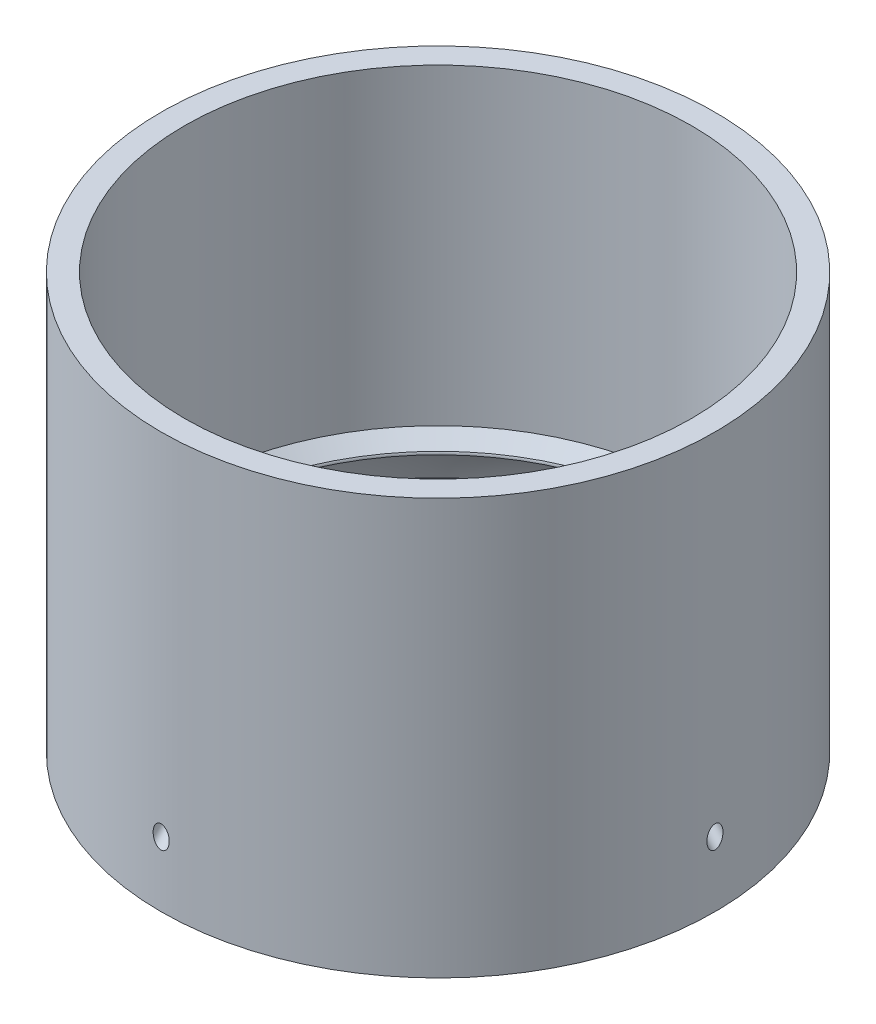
ISO-10303-21;
HEADER;
FILE_DESCRIPTION(('STEP AP214'),'2;1');
FILE_NAME('part.step','',(''),(''),'','','');
FILE_SCHEMA(('AUTOMOTIVE_DESIGN { 1 0 10303 214 1 1 1 1 }'));
ENDSEC;
DATA;
#1=APPLICATION_CONTEXT('core data for automotive mechanical design processes');
#2=APPLICATION_PROTOCOL_DEFINITION('international standard','automotive_design',2000,#1);
#3=PRODUCT_CONTEXT('',#1,'mechanical');
#4=PRODUCT('Part','Part','',(#3));
#5=PRODUCT_RELATED_PRODUCT_CATEGORY('part','',(#4));
#6=PRODUCT_DEFINITION_FORMATION('','',#4);
#7=PRODUCT_DEFINITION_CONTEXT('part definition',#1,'design');
#8=PRODUCT_DEFINITION('design','',#6,#7);
#9=PRODUCT_DEFINITION_SHAPE('','',#8);
#10=(LENGTH_UNIT() NAMED_UNIT(*) SI_UNIT(.MILLI.,.METRE.));
#11=(NAMED_UNIT(*) PLANE_ANGLE_UNIT() SI_UNIT($,.RADIAN.));
#12=(NAMED_UNIT(*) SI_UNIT($,.STERADIAN.) SOLID_ANGLE_UNIT());
#13=UNCERTAINTY_MEASURE_WITH_UNIT(LENGTH_MEASURE(1.E-05),#10,'distance_accuracy_value','');
#14=(GEOMETRIC_REPRESENTATION_CONTEXT(3) GLOBAL_UNCERTAINTY_ASSIGNED_CONTEXT((#13)) GLOBAL_UNIT_ASSIGNED_CONTEXT((#10,
#11,#12)) REPRESENTATION_CONTEXT('',''));
#15=CARTESIAN_POINT('',(0.,0.,0.));
#16=DIRECTION('',(0.,0.,1.));
#17=DIRECTION('',(1.,0.,0.));
#18=AXIS2_PLACEMENT_3D('',#15,#16,#17);
#19=CARTESIAN_POINT('',(0.,133.35,0.));
#20=DIRECTION('',(0.,-1.,0.));
#21=DIRECTION('',(0.,0.,-1.));
#22=AXIS2_PLACEMENT_3D('',#19,#20,#21);
#23=CYLINDRICAL_SURFACE('',#22,88.9);
#24=CARTESIAN_POINT('',(0.,0.,0.));
#25=DIRECTION('',(0.,1.,0.));
#26=DIRECTION('',(0.,0.,1.));
#27=AXIS2_PLACEMENT_3D('',#24,#25,#26);
#28=CIRCLE('',#27,88.9);
#29=CARTESIAN_POINT('',(0.,0.,88.9));
#30=VERTEX_POINT('',#29);
#31=EDGE_CURVE('E348',#30,#30,#28,.T.);
#32=ORIENTED_EDGE('',*,*,#31,.T.);
#33=EDGE_LOOP('',(#32));
#34=FACE_BOUND('',#33,.T.);
#35=CARTESIAN_POINT('',(0.,133.35,0.));
#36=DIRECTION('',(0.,1.,0.));
#37=DIRECTION('',(0.,0.,1.));
#38=AXIS2_PLACEMENT_3D('',#35,#36,#37);
#39=CIRCLE('',#38,88.9);
#40=CARTESIAN_POINT('',(0.,133.35,88.9));
#41=VERTEX_POINT('',#40);
#42=EDGE_CURVE('E352',#41,#41,#39,.T.);
#43=ORIENTED_EDGE('',*,*,#42,.F.);
#44=EDGE_LOOP('',(#43));
#45=FACE_BOUND('',#44,.T.);
#46=CARTESIAN_POINT('',(0.,24.4668580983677,-88.9));
#47=CARTESIAN_POINT('',(-0.116322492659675,24.4668613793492,-88.9000000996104));
#48=CARTESIAN_POINT('',(-0.232631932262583,24.4558825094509,-88.8997690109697));
#49=CARTESIAN_POINT('',(-0.461276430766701,24.4128944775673,-88.8988769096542));
#50=CARTESIAN_POINT('',(-0.573610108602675,24.3808780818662,-88.8982157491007));
#51=CARTESIAN_POINT('',(-0.790437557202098,24.2984476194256,-88.8965518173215));
#52=CARTESIAN_POINT('',(-0.894973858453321,24.2481437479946,-88.895551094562));
#53=CARTESIAN_POINT('',(-1.09503076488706,24.1321204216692,-88.8933121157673));
#54=CARTESIAN_POINT('',(-1.19054679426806,24.0663932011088,-88.8920737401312));
#55=CARTESIAN_POINT('',(-1.40649985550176,23.8947651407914,-88.8889617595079));
#56=CARTESIAN_POINT('',(-1.52238269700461,23.7831379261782,-88.887027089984));
#57=CARTESIAN_POINT('',(-1.73467791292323,23.5427018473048,-88.8831378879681));
#58=CARTESIAN_POINT('',(-1.83105071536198,23.4138589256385,-88.881183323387));
#59=CARTESIAN_POINT('',(-2.03709998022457,23.0943222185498,-88.8767377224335));
#60=CARTESIAN_POINT('',(-2.13856321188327,22.8983488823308,-88.874314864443));
#61=CARTESIAN_POINT('',(-2.30898159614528,22.4927857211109,-88.8700502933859));
#62=CARTESIAN_POINT('',(-2.37789194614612,22.2831775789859,-88.8682093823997));
#63=CARTESIAN_POINT('',(-2.46587108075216,21.9342579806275,-88.8658009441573));
#64=CARTESIAN_POINT('',(-2.49395187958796,21.7971229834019,-88.8650138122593));
#65=CARTESIAN_POINT('',(-2.53832932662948,21.5208955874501,-88.8637574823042));
#66=CARTESIAN_POINT('',(-2.55462184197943,21.3818025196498,-88.8632883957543));
#67=CARTESIAN_POINT('',(-2.57571049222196,21.1025859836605,-88.8626795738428));
#68=CARTESIAN_POINT('',(-2.58049212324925,20.9624614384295,-88.8625402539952));
#69=CARTESIAN_POINT('',(-2.57866330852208,20.682348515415,-88.8625933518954));
#70=CARTESIAN_POINT('',(-2.57205786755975,20.5423601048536,-88.8627856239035));
#71=CARTESIAN_POINT('',(-2.5473562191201,20.262248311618,-88.8634971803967));
#72=CARTESIAN_POINT('',(-2.52916696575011,20.1221330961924,-88.8640191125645));
#73=CARTESIAN_POINT('',(-2.48103863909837,19.8438975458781,-88.8653758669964));
#74=CARTESIAN_POINT('',(-2.45109725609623,19.7057776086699,-88.8662107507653));
#75=CARTESIAN_POINT('',(-2.37919177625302,19.4329447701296,-88.8681649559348));
#76=CARTESIAN_POINT('',(-2.33724939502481,19.298226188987,-88.8692837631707));
#77=CARTESIAN_POINT('',(-2.2408507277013,19.0334162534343,-88.8717666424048));
#78=CARTESIAN_POINT('',(-2.18640181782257,18.903322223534,-88.8731305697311));
#79=CARTESIAN_POINT('',(-2.04918883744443,18.6179459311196,-88.8764123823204));
#80=CARTESIAN_POINT('',(-1.96275220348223,18.4643957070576,-88.8783838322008));
#81=CARTESIAN_POINT('',(-1.76791900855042,18.1719180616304,-88.8824726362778));
#82=CARTESIAN_POINT('',(-1.65955618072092,18.0329686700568,-88.8845897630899));
#83=CARTESIAN_POINT('',(-1.44813747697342,17.8069061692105,-88.8882514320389));
#84=CARTESIAN_POINT('',(-1.3499014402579,17.7153097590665,-88.8898128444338));
#85=CARTESIAN_POINT('',(-1.14005811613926,17.5488831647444,-88.8927512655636));
#86=CARTESIAN_POINT('',(-1.02846897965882,17.4740306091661,-88.8941285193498));
#87=CARTESIAN_POINT('',(-0.815455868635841,17.3581494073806,-88.8963111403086));
#88=CARTESIAN_POINT('',(-0.716063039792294,17.3134077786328,-88.8971753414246));
#89=CARTESIAN_POINT('',(-0.511194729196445,17.2410570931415,-88.8985890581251));
#90=CARTESIAN_POINT('',(-0.405723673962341,17.2134357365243,-88.8991387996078));
#91=CARTESIAN_POINT('',(-0.190990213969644,17.1773298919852,-88.899859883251));
#92=CARTESIAN_POINT('',(-0.0817123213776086,17.1689359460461,-88.9000294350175));
#93=CARTESIAN_POINT('',(0.136530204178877,17.1722843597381,-88.8999621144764));
#94=CARTESIAN_POINT('',(0.245494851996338,17.1840257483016,-88.8997252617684));
#95=CARTESIAN_POINT('',(0.451675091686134,17.2250535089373,-88.8989080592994));
#96=CARTESIAN_POINT('',(0.549166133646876,17.2529893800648,-88.8983541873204));
#97=CARTESIAN_POINT('',(0.738683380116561,17.3234401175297,-88.896981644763));
#98=CARTESIAN_POINT('',(0.830707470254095,17.365960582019,-88.8961628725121));
#99=CARTESIAN_POINT('',(1.03997551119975,17.48100855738,-88.8939987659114));
#100=CARTESIAN_POINT('',(1.15430957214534,17.5588269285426,-88.8925700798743));
#101=CARTESIAN_POINT('',(1.36886442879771,17.731943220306,-88.8895257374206));
#102=CARTESIAN_POINT('',(1.46905682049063,17.8272754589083,-88.8879097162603));
#103=CARTESIAN_POINT('',(1.69108127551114,18.0700995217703,-88.8840083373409));
#104=CARTESIAN_POINT('',(1.8063826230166,18.2235379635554,-88.8817049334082));
#105=CARTESIAN_POINT('',(2.01130056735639,18.5466675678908,-88.8773041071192));
#106=CARTESIAN_POINT('',(2.10087255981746,18.7163862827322,-88.8752070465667));
#107=CARTESIAN_POINT('',(2.23144575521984,19.0107563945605,-88.8720057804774));
#108=CARTESIAN_POINT('',(2.27884299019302,19.1326399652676,-88.8707975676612));
#109=CARTESIAN_POINT('',(2.36297506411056,19.3800435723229,-88.86860021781));
#110=CARTESIAN_POINT('',(2.39970616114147,19.5055648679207,-88.8676111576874));
#111=CARTESIAN_POINT('',(2.49450285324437,19.8861310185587,-88.8650192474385));
#112=CARTESIAN_POINT('',(2.53718293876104,20.1452039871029,-88.8637913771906));
#113=CARTESIAN_POINT('',(2.57162903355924,20.5383669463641,-88.8627973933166));
#114=CARTESIAN_POINT('',(2.57810092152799,20.6714172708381,-88.8626096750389));
#115=CARTESIAN_POINT('',(2.58075921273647,20.9376209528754,-88.8625325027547));
#116=CARTESIAN_POINT('',(2.57694604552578,21.0707743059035,-88.8626430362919));
#117=CARTESIAN_POINT('',(2.54991891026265,21.4690674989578,-88.8634257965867));
#118=CARTESIAN_POINT('',(2.51114786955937,21.73338791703,-88.8645482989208));
#119=CARTESIAN_POINT('',(2.40035513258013,22.2066328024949,-88.8676021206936));
#120=CARTESIAN_POINT('',(2.33527747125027,22.4172056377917,-88.8693591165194));
#121=CARTESIAN_POINT('',(2.17287835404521,22.8256453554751,-88.873479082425));
#122=CARTESIAN_POINT('',(2.0756034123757,23.0235300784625,-88.8758411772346));
#123=CARTESIAN_POINT('',(1.87775275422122,23.3464943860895,-88.8802052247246));
#124=CARTESIAN_POINT('',(1.78543931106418,23.4766315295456,-88.8821276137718));
#125=CARTESIAN_POINT('',(1.58163018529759,23.7209817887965,-88.8859877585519));
#126=CARTESIAN_POINT('',(1.47016266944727,23.8352178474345,-88.8879254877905));
#127=CARTESIAN_POINT('',(1.25412745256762,24.0194124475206,-88.8912041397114));
#128=CARTESIAN_POINT('',(1.15319376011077,24.093614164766,-88.8925840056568));
#129=CARTESIAN_POINT('',(0.940523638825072,24.2246295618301,-88.8950880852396));
#130=CARTESIAN_POINT('',(0.828794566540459,24.2814549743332,-88.8962124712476));
#131=CARTESIAN_POINT('',(0.599645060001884,24.3727779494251,-88.8980494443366));
#132=CARTESIAN_POINT('',(0.482434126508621,24.4077936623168,-88.8987715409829));
#133=CARTESIAN_POINT('',(0.243475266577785,24.4548241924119,-88.8997466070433));
#134=CARTESIAN_POINT('',(0.121730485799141,24.4668546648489,-88.8999998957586));
#135=CARTESIAN_POINT('',(0.,24.4668580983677,-88.9));
#136=B_SPLINE_CURVE_WITH_KNOTS('',3,(#46,#47,#48,#49,#50,#51,#52,#53,#54,#55,#56,#57,#58,#59,
#60,#61,#62,#63,#64,#65,#66,#67,#68,#69,#70,#71,#72,#73,#74,#75,#76,#77,#78,#79,#80,#81,#82,#83,
#84,#85,#86,#87,#88,#89,#90,#91,#92,#93,#94,#95,#96,#97,#98,#99,#100,#101,#102,#103,#104,#105,
#106,#107,#108,#109,#110,#111,#112,#113,#114,#115,#116,#117,#118,#119,#120,#121,#122,#123,#124,
#125,#126,#127,#128,#129,#130,#131,#132,#133,#134,#135),.UNSPECIFIED.,.T.,.F.,(4,2,2,2,2,2,2,2,
2,2,2,2,2,2,2,2,2,2,2,2,2,2,2,2,2,2,2,2,2,2,2,2,2,2,2,2,2,2,2,2,2,2,2,2,4),(0.,
0.348450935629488,0.697021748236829,1.04352606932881,1.3902052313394,1.87029106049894,
2.35134109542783,3.00989912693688,3.66936091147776,4.08884102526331,4.50846813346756,
4.92862370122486,5.34859465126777,5.77198227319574,6.19545314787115,6.61816255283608,
7.04062328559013,7.56761129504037,8.09379462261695,8.49537588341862,8.89641734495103,
9.22208585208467,9.54752011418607,9.87448372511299,10.2014315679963,10.5043909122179,
10.8074666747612,11.2201113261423,11.6335733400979,12.2062999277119,12.780013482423,
13.1718662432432,13.5638563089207,14.3477530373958,14.7470671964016,15.146364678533,
15.9439241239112,16.6029712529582,17.2610704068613,17.7382138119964,18.2146614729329,
18.589081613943,18.9632483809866,19.328147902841,19.6927988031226),.UNSPECIFIED.);
#137=CARTESIAN_POINT('',(0.,24.4668580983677,-88.9));
#138=VERTEX_POINT('',#137);
#139=EDGE_CURVE('E306',#138,#138,#136,.T.);
#140=ORIENTED_EDGE('',*,*,#139,.T.);
#141=EDGE_LOOP('',(#140));
#142=FACE_BOUND('',#141,.T.);
#143=CARTESIAN_POINT('',(-88.9,24.4668580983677,3.10392870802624E-13));
#144=CARTESIAN_POINT('',(-88.9000000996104,24.4668613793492,0.116322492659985));
#145=CARTESIAN_POINT('',(-88.8997690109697,24.4558825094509,0.232631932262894));
#146=CARTESIAN_POINT('',(-88.8988769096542,24.4128944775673,0.461276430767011));
#147=CARTESIAN_POINT('',(-88.8982157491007,24.3808780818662,0.573610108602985));
#148=CARTESIAN_POINT('',(-88.8965518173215,24.2984476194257,0.79043755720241));
#149=CARTESIAN_POINT('',(-88.895551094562,24.2481437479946,0.894973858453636));
#150=CARTESIAN_POINT('',(-88.8933121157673,24.1321204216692,1.09503076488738));
#151=CARTESIAN_POINT('',(-88.8920737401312,24.0663932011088,1.19054679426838));
#152=CARTESIAN_POINT('',(-88.8889617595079,23.8947651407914,1.40649985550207));
#153=CARTESIAN_POINT('',(-88.887027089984,23.7831379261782,1.52238269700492));
#154=CARTESIAN_POINT('',(-88.883137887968,23.5427018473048,1.73467791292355));
#155=CARTESIAN_POINT('',(-88.881183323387,23.4138589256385,1.83105071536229));
#156=CARTESIAN_POINT('',(-88.8767377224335,23.0943222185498,2.03709998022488));
#157=CARTESIAN_POINT('',(-88.874314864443,22.8983488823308,2.13856321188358));
#158=CARTESIAN_POINT('',(-88.8700502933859,22.4927857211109,2.30898159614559));
#159=CARTESIAN_POINT('',(-88.8682093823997,22.2831775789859,2.37789194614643));
#160=CARTESIAN_POINT('',(-88.8658009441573,21.9342579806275,2.46587108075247));
#161=CARTESIAN_POINT('',(-88.8650138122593,21.7971229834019,2.49395187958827));
#162=CARTESIAN_POINT('',(-88.8637574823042,21.5208955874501,2.53832932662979));
#163=CARTESIAN_POINT('',(-88.8632883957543,21.3818025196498,2.55462184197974));
#164=CARTESIAN_POINT('',(-88.8626795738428,21.1025859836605,2.57571049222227));
#165=CARTESIAN_POINT('',(-88.8625402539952,20.9624614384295,2.58049212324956));
#166=CARTESIAN_POINT('',(-88.8625933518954,20.682348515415,2.57866330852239));
#167=CARTESIAN_POINT('',(-88.8627856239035,20.5423601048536,2.57205786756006));
#168=CARTESIAN_POINT('',(-88.8634971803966,20.262248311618,2.54735621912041));
#169=CARTESIAN_POINT('',(-88.8640191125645,20.1221330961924,2.52916696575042));
#170=CARTESIAN_POINT('',(-88.8653758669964,19.8438975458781,2.48103863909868));
#171=CARTESIAN_POINT('',(-88.8662107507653,19.7057776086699,2.45109725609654));
#172=CARTESIAN_POINT('',(-88.8681649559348,19.4329447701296,2.37919177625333));
#173=CARTESIAN_POINT('',(-88.8692837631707,19.298226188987,2.33724939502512));
#174=CARTESIAN_POINT('',(-88.8717666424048,19.0334162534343,2.24085072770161));
#175=CARTESIAN_POINT('',(-88.8731305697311,18.903322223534,2.18640181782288));
#176=CARTESIAN_POINT('',(-88.8764123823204,18.6179459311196,2.04918883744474));
#177=CARTESIAN_POINT('',(-88.8783838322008,18.4643957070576,1.96275220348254));
#178=CARTESIAN_POINT('',(-88.8824726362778,18.1719180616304,1.76791900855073));
#179=CARTESIAN_POINT('',(-88.8845897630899,18.0329686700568,1.65955618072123));
#180=CARTESIAN_POINT('',(-88.8882514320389,17.8069061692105,1.44813747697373));
#181=CARTESIAN_POINT('',(-88.8898128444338,17.7153097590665,1.34990144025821));
#182=CARTESIAN_POINT('',(-88.8927512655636,17.5488831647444,1.14005811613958));
#183=CARTESIAN_POINT('',(-88.8941285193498,17.474030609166,1.02846897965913));
#184=CARTESIAN_POINT('',(-88.8963111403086,17.3581494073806,0.81545586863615));
#185=CARTESIAN_POINT('',(-88.8971753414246,17.3134077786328,0.7160630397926));
#186=CARTESIAN_POINT('',(-88.8985890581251,17.2410570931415,0.511194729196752));
#187=CARTESIAN_POINT('',(-88.8991387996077,17.2134357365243,0.405723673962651));
#188=CARTESIAN_POINT('',(-88.899859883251,17.1773298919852,0.190990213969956));
#189=CARTESIAN_POINT('',(-88.9000294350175,17.1689359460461,0.0817123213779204));
#190=CARTESIAN_POINT('',(-88.8999621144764,17.1722843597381,-0.136530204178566));
#191=CARTESIAN_POINT('',(-88.8997252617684,17.1840257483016,-0.245494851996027));
#192=CARTESIAN_POINT('',(-88.8989080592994,17.2250535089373,-0.451675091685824));
#193=CARTESIAN_POINT('',(-88.8983541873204,17.2529893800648,-0.549166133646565));
#194=CARTESIAN_POINT('',(-88.896981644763,17.3234401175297,-0.738683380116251));
#195=CARTESIAN_POINT('',(-88.8961628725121,17.365960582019,-0.830707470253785));
#196=CARTESIAN_POINT('',(-88.8939987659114,17.48100855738,-1.03997551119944));
#197=CARTESIAN_POINT('',(-88.8925700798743,17.5588269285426,-1.15430957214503));
#198=CARTESIAN_POINT('',(-88.8895257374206,17.731943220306,-1.3688644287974));
#199=CARTESIAN_POINT('',(-88.8879097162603,17.8272754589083,-1.46905682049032));
#200=CARTESIAN_POINT('',(-88.8840083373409,18.0700995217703,-1.69108127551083));
#201=CARTESIAN_POINT('',(-88.8817049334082,18.2235379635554,-1.80638262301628));
#202=CARTESIAN_POINT('',(-88.8773041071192,18.5466675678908,-2.01130056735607));
#203=CARTESIAN_POINT('',(-88.8752070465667,18.7163862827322,-2.10087255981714));
#204=CARTESIAN_POINT('',(-88.8720057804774,19.0107563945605,-2.23144575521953));
#205=CARTESIAN_POINT('',(-88.8707975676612,19.1326399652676,-2.27884299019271));
#206=CARTESIAN_POINT('',(-88.8686002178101,19.3800435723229,-2.36297506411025));
#207=CARTESIAN_POINT('',(-88.8676111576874,19.5055648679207,-2.39970616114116));
#208=CARTESIAN_POINT('',(-88.8650192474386,19.8861310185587,-2.49450285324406));
#209=CARTESIAN_POINT('',(-88.8637913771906,20.1452039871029,-2.53718293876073));
#210=CARTESIAN_POINT('',(-88.8627973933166,20.5383669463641,-2.57162903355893));
#211=CARTESIAN_POINT('',(-88.8626096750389,20.6714172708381,-2.57810092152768));
#212=CARTESIAN_POINT('',(-88.8625325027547,20.9376209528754,-2.58075921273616));
#213=CARTESIAN_POINT('',(-88.8626430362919,21.0707743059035,-2.57694604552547));
#214=CARTESIAN_POINT('',(-88.8634257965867,21.4690674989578,-2.54991891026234));
#215=CARTESIAN_POINT('',(-88.8645482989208,21.7333879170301,-2.51114786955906));
#216=CARTESIAN_POINT('',(-88.8676021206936,22.2066328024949,-2.40035513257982));
#217=CARTESIAN_POINT('',(-88.8693591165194,22.4172056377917,-2.33527747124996));
#218=CARTESIAN_POINT('',(-88.873479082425,22.8256453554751,-2.1728783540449));
#219=CARTESIAN_POINT('',(-88.8758411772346,23.0235300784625,-2.07560341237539));
#220=CARTESIAN_POINT('',(-88.8802052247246,23.3464943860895,-1.87775275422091));
#221=CARTESIAN_POINT('',(-88.8821276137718,23.4766315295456,-1.78543931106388));
#222=CARTESIAN_POINT('',(-88.8859877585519,23.7209817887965,-1.58163018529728));
#223=CARTESIAN_POINT('',(-88.8879254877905,23.8352178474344,-1.47016266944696));
#224=CARTESIAN_POINT('',(-88.8912041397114,24.0194124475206,-1.25412745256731));
#225=CARTESIAN_POINT('',(-88.8925840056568,24.093614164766,-1.15319376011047));
#226=CARTESIAN_POINT('',(-88.8950880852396,24.2246295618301,-0.940523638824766));
#227=CARTESIAN_POINT('',(-88.8962124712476,24.2814549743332,-0.82879456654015));
#228=CARTESIAN_POINT('',(-88.8980494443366,24.3727779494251,-0.599645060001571));
#229=CARTESIAN_POINT('',(-88.8987715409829,24.4077936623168,-0.482434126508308));
#230=CARTESIAN_POINT('',(-88.8997466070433,24.4548241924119,-0.243475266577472));
#231=CARTESIAN_POINT('',(-88.8999998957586,24.4668546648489,-0.12173048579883));
#232=CARTESIAN_POINT('',(-88.9,24.4668580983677,3.10392870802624E-13));
#233=B_SPLINE_CURVE_WITH_KNOTS('',3,(#143,#144,#145,#146,#147,#148,#149,#150,#151,#152,#153,
#154,#155,#156,#157,#158,#159,#160,#161,#162,#163,#164,#165,#166,#167,#168,#169,#170,#171,#172,
#173,#174,#175,#176,#177,#178,#179,#180,#181,#182,#183,#184,#185,#186,#187,#188,#189,#190,#191,
#192,#193,#194,#195,#196,#197,#198,#199,#200,#201,#202,#203,#204,#205,#206,#207,#208,#209,#210,
#211,#212,#213,#214,#215,#216,#217,#218,#219,#220,#221,#222,#223,#224,#225,#226,#227,#228,#229,
#230,#231,#232),.UNSPECIFIED.,.T.,.F.,(4,2,2,2,2,2,2,2,2,2,2,2,2,2,2,2,2,2,2,2,2,2,2,2,2,2,2,2,
2,2,2,2,2,2,2,2,2,2,2,2,2,2,2,2,4),(0.,0.348450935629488,0.697021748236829,1.04352606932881,
1.3902052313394,1.87029106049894,2.35134109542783,3.00989912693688,3.66936091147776,
4.08884102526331,4.50846813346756,4.92862370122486,5.34859465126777,5.77198227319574,
6.19545314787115,6.61816255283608,7.04062328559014,7.56761129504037,8.09379462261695,
8.49537588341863,8.89641734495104,9.22208585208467,9.54752011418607,9.87448372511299,
10.2014315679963,10.5043909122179,10.8074666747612,11.2201113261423,11.6335733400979,
12.2062999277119,12.780013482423,13.1718662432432,13.5638563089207,14.3477530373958,
14.7470671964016,15.146364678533,15.9439241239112,16.6029712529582,17.2610704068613,
17.7382138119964,18.2146614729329,18.589081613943,18.9632483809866,19.328147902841,
19.6927988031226),.UNSPECIFIED.);
#234=CARTESIAN_POINT('',(-88.9,24.4668580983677,3.10392870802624E-13));
#235=VERTEX_POINT('',#234);
#236=EDGE_CURVE('E271',#235,#235,#233,.T.);
#237=ORIENTED_EDGE('',*,*,#236,.T.);
#238=EDGE_LOOP('',(#237));
#239=FACE_BOUND('',#238,.T.);
#240=CARTESIAN_POINT('',(6.20785741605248E-13,24.4668580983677,88.9));
#241=CARTESIAN_POINT('',(0.116322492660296,24.4668613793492,88.9000000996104));
#242=CARTESIAN_POINT('',(0.232631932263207,24.4558825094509,88.8997690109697));
#243=CARTESIAN_POINT('',(0.461276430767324,24.4128944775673,88.8988769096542));
#244=CARTESIAN_POINT('',(0.573610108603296,24.3808780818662,88.8982157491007));
#245=CARTESIAN_POINT('',(0.790437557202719,24.2984476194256,88.8965518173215));
#246=CARTESIAN_POINT('',(0.894973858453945,24.2481437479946,88.895551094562));
#247=CARTESIAN_POINT('',(1.09503076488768,24.1321204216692,88.8933121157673));
#248=CARTESIAN_POINT('',(1.19054679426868,24.0663932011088,88.8920737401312));
#249=CARTESIAN_POINT('',(1.40649985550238,23.8947651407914,88.8889617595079));
#250=CARTESIAN_POINT('',(1.52238269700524,23.7831379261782,88.887027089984));
#251=CARTESIAN_POINT('',(1.73467791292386,23.5427018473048,88.883137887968));
#252=CARTESIAN_POINT('',(1.8310507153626,23.4138589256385,88.881183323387));
#253=CARTESIAN_POINT('',(2.03709998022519,23.0943222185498,88.8767377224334));
#254=CARTESIAN_POINT('',(2.13856321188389,22.8983488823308,88.874314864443));
#255=CARTESIAN_POINT('',(2.3089815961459,22.4927857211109,88.8700502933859));
#256=CARTESIAN_POINT('',(2.37789194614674,22.2831775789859,88.8682093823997));
#257=CARTESIAN_POINT('',(2.46587108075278,21.9342579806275,88.8658009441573));
#258=CARTESIAN_POINT('',(2.49395187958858,21.7971229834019,88.8650138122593));
#259=CARTESIAN_POINT('',(2.5383293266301,21.5208955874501,88.8637574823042));
#260=CARTESIAN_POINT('',(2.55462184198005,21.3818025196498,88.8632883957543));
#261=CARTESIAN_POINT('',(2.57571049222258,21.1025859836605,88.8626795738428));
#262=CARTESIAN_POINT('',(2.58049212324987,20.9624614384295,88.8625402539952));
#263=CARTESIAN_POINT('',(2.5786633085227,20.682348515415,88.8625933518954));
#264=CARTESIAN_POINT('',(2.57205786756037,20.5423601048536,88.8627856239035));
#265=CARTESIAN_POINT('',(2.54735621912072,20.262248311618,88.8634971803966));
#266=CARTESIAN_POINT('',(2.52916696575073,20.1221330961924,88.8640191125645));
#267=CARTESIAN_POINT('',(2.48103863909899,19.8438975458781,88.8653758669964));
#268=CARTESIAN_POINT('',(2.45109725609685,19.7057776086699,88.8662107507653));
#269=CARTESIAN_POINT('',(2.37919177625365,19.4329447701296,88.8681649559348));
#270=CARTESIAN_POINT('',(2.33724939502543,19.298226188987,88.8692837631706));
#271=CARTESIAN_POINT('',(2.24085072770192,19.0334162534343,88.8717666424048));
#272=CARTESIAN_POINT('',(2.18640181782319,18.903322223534,88.8731305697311));
#273=CARTESIAN_POINT('',(2.04918883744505,18.6179459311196,88.8764123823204));
#274=CARTESIAN_POINT('',(1.96275220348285,18.4643957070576,88.8783838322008));
#275=CARTESIAN_POINT('',(1.76791900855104,18.1719180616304,88.8824726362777));
#276=CARTESIAN_POINT('',(1.65955618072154,18.0329686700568,88.8845897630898));
#277=CARTESIAN_POINT('',(1.44813747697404,17.8069061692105,88.8882514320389));
#278=CARTESIAN_POINT('',(1.34990144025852,17.7153097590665,88.8898128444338));
#279=CARTESIAN_POINT('',(1.14005811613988,17.5488831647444,88.8927512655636));
#280=CARTESIAN_POINT('',(1.02846897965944,17.474030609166,88.8941285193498));
#281=CARTESIAN_POINT('',(0.815455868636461,17.3581494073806,88.8963111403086));
#282=CARTESIAN_POINT('',(0.716063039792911,17.3134077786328,88.8971753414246));
#283=CARTESIAN_POINT('',(0.511194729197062,17.2410570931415,88.8985890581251));
#284=CARTESIAN_POINT('',(0.405723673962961,17.2134357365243,88.8991387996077));
#285=CARTESIAN_POINT('',(0.190990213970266,17.1773298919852,88.899859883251));
#286=CARTESIAN_POINT('',(0.0817123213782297,17.1689359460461,88.9000294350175));
#287=CARTESIAN_POINT('',(-0.136530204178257,17.1722843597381,88.8999621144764));
#288=CARTESIAN_POINT('',(-0.245494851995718,17.1840257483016,88.8997252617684));
#289=CARTESIAN_POINT('',(-0.451675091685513,17.2250535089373,88.8989080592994));
#290=CARTESIAN_POINT('',(-0.549166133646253,17.2529893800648,88.8983541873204));
#291=CARTESIAN_POINT('',(-0.738683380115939,17.3234401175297,88.896981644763));
#292=CARTESIAN_POINT('',(-0.830707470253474,17.365960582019,88.8961628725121));
#293=CARTESIAN_POINT('',(-1.03997551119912,17.48100855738,88.8939987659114));
#294=CARTESIAN_POINT('',(-1.15430957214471,17.5588269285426,88.8925700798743));
#295=CARTESIAN_POINT('',(-1.36886442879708,17.731943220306,88.8895257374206));
#296=CARTESIAN_POINT('',(-1.46905682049,17.8272754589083,88.8879097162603));
#297=CARTESIAN_POINT('',(-1.69108127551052,18.0700995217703,88.8840083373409));
#298=CARTESIAN_POINT('',(-1.80638262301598,18.2235379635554,88.8817049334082));
#299=CARTESIAN_POINT('',(-2.01130056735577,18.5466675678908,88.8773041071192));
#300=CARTESIAN_POINT('',(-2.10087255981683,18.7163862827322,88.8752070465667));
#301=CARTESIAN_POINT('',(-2.23144575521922,19.0107563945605,88.8720057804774));
#302=CARTESIAN_POINT('',(-2.2788429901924,19.1326399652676,88.8707975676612));
#303=CARTESIAN_POINT('',(-2.36297506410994,19.3800435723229,88.8686002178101));
#304=CARTESIAN_POINT('',(-2.39970616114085,19.5055648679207,88.8676111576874));
#305=CARTESIAN_POINT('',(-2.49450285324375,19.8861310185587,88.8650192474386));
#306=CARTESIAN_POINT('',(-2.53718293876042,20.1452039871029,88.8637913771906));
#307=CARTESIAN_POINT('',(-2.57162903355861,20.5383669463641,88.8627973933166));
#308=CARTESIAN_POINT('',(-2.57810092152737,20.6714172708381,88.8626096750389));
#309=CARTESIAN_POINT('',(-2.58075921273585,20.9376209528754,88.8625325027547));
#310=CARTESIAN_POINT('',(-2.57694604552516,21.0707743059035,88.8626430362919));
#311=CARTESIAN_POINT('',(-2.54991891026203,21.4690674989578,88.8634257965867));
#312=CARTESIAN_POINT('',(-2.51114786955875,21.73338791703,88.8645482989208));
#313=CARTESIAN_POINT('',(-2.40035513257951,22.2066328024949,88.8676021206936));
#314=CARTESIAN_POINT('',(-2.33527747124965,22.4172056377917,88.8693591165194));
#315=CARTESIAN_POINT('',(-2.17287835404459,22.8256453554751,88.873479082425));
#316=CARTESIAN_POINT('',(-2.07560341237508,23.0235300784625,88.8758411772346));
#317=CARTESIAN_POINT('',(-1.8777527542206,23.3464943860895,88.8802052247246));
#318=CARTESIAN_POINT('',(-1.78543931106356,23.4766315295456,88.8821276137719));
#319=CARTESIAN_POINT('',(-1.58163018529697,23.7209817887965,88.8859877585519));
#320=CARTESIAN_POINT('',(-1.47016266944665,23.8352178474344,88.8879254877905));
#321=CARTESIAN_POINT('',(-1.254127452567,24.0194124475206,88.8912041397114));
#322=CARTESIAN_POINT('',(-1.15319376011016,24.093614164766,88.8925840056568));
#323=CARTESIAN_POINT('',(-0.940523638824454,24.2246295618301,88.8950880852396));
#324=CARTESIAN_POINT('',(-0.82879456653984,24.2814549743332,88.8962124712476));
#325=CARTESIAN_POINT('',(-0.599645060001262,24.3727779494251,88.8980494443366));
#326=CARTESIAN_POINT('',(-0.482434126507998,24.4077936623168,88.8987715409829));
#327=CARTESIAN_POINT('',(-0.243475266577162,24.4548241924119,88.8997466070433));
#328=CARTESIAN_POINT('',(-0.12173048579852,24.4668546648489,88.8999998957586));
#329=CARTESIAN_POINT('',(6.20785741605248E-13,24.4668580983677,88.9));
#330=B_SPLINE_CURVE_WITH_KNOTS('',3,(#240,#241,#242,#243,#244,#245,#246,#247,#248,#249,#250,
#251,#252,#253,#254,#255,#256,#257,#258,#259,#260,#261,#262,#263,#264,#265,#266,#267,#268,#269,
#270,#271,#272,#273,#274,#275,#276,#277,#278,#279,#280,#281,#282,#283,#284,#285,#286,#287,#288,
#289,#290,#291,#292,#293,#294,#295,#296,#297,#298,#299,#300,#301,#302,#303,#304,#305,#306,#307,
#308,#309,#310,#311,#312,#313,#314,#315,#316,#317,#318,#319,#320,#321,#322,#323,#324,#325,#326,
#327,#328,#329),.UNSPECIFIED.,.T.,.F.,(4,2,2,2,2,2,2,2,2,2,2,2,2,2,2,2,2,2,2,2,2,2,2,2,2,2,2,2,
2,2,2,2,2,2,2,2,2,2,2,2,2,2,2,2,4),(0.,0.348450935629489,0.697021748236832,1.04352606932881,
1.3902052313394,1.87029106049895,2.35134109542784,3.00989912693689,3.66936091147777,
4.08884102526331,4.50846813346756,4.92862370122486,5.34859465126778,5.77198227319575,
6.19545314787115,6.61816255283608,7.04062328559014,7.56761129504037,8.09379462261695,
8.49537588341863,8.89641734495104,9.22208585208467,9.54752011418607,9.874483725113,
10.2014315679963,10.5043909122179,10.8074666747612,11.2201113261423,11.6335733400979,
12.2062999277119,12.780013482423,13.1718662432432,13.5638563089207,14.3477530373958,
14.7470671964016,15.146364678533,15.9439241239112,16.6029712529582,17.2610704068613,
17.7382138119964,18.2146614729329,18.589081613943,18.9632483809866,19.328147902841,
19.6927988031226),.UNSPECIFIED.);
#331=CARTESIAN_POINT('',(6.20785741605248E-13,24.4668580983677,88.9));
#332=VERTEX_POINT('',#331);
#333=EDGE_CURVE('E243',#332,#332,#330,.T.);
#334=ORIENTED_EDGE('',*,*,#333,.T.);
#335=EDGE_LOOP('',(#334));
#336=FACE_BOUND('',#335,.T.);
#337=CARTESIAN_POINT('',(88.9,24.4668580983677,-9.31178612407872E-13));
#338=CARTESIAN_POINT('',(88.9000000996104,24.4668613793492,-0.116322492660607));
#339=CARTESIAN_POINT('',(88.8997690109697,24.4558825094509,-0.232631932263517));
#340=CARTESIAN_POINT('',(88.8988769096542,24.4128944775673,-0.461276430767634));
#341=CARTESIAN_POINT('',(88.8982157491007,24.3808780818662,-0.573610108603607));
#342=CARTESIAN_POINT('',(88.8965518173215,24.2984476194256,-0.790437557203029));
#343=CARTESIAN_POINT('',(88.895551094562,24.2481437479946,-0.894973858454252));
#344=CARTESIAN_POINT('',(88.8933121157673,24.1321204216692,-1.09503076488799));
#345=CARTESIAN_POINT('',(88.8920737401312,24.0663932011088,-1.19054679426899));
#346=CARTESIAN_POINT('',(88.8889617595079,23.8947651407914,-1.40649985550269));
#347=CARTESIAN_POINT('',(88.887027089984,23.7831379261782,-1.52238269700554));
#348=CARTESIAN_POINT('',(88.883137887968,23.5427018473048,-1.73467791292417));
#349=CARTESIAN_POINT('',(88.881183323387,23.4138589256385,-1.83105071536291));
#350=CARTESIAN_POINT('',(88.8767377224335,23.0943222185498,-2.0370999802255));
#351=CARTESIAN_POINT('',(88.874314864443,22.8983488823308,-2.1385632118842));
#352=CARTESIAN_POINT('',(88.8700502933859,22.4927857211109,-2.30898159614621));
#353=CARTESIAN_POINT('',(88.8682093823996,22.2831775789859,-2.37789194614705));
#354=CARTESIAN_POINT('',(88.8658009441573,21.9342579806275,-2.46587108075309));
#355=CARTESIAN_POINT('',(88.8650138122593,21.7971229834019,-2.49395187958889));
#356=CARTESIAN_POINT('',(88.8637574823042,21.5208955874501,-2.53832932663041));
#357=CARTESIAN_POINT('',(88.8632883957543,21.3818025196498,-2.55462184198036));
#358=CARTESIAN_POINT('',(88.8626795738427,21.1025859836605,-2.57571049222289));
#359=CARTESIAN_POINT('',(88.8625402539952,20.9624614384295,-2.58049212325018));
#360=CARTESIAN_POINT('',(88.8625933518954,20.682348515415,-2.57866330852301));
#361=CARTESIAN_POINT('',(88.8627856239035,20.5423601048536,-2.57205786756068));
#362=CARTESIAN_POINT('',(88.8634971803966,20.262248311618,-2.54735621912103));
#363=CARTESIAN_POINT('',(88.8640191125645,20.1221330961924,-2.52916696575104));
#364=CARTESIAN_POINT('',(88.8653758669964,19.8438975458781,-2.4810386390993));
#365=CARTESIAN_POINT('',(88.8662107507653,19.7057776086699,-2.45109725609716));
#366=CARTESIAN_POINT('',(88.8681649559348,19.4329447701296,-2.37919177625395));
#367=CARTESIAN_POINT('',(88.8692837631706,19.298226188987,-2.33724939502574));
#368=CARTESIAN_POINT('',(88.8717666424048,19.0334162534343,-2.24085072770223));
#369=CARTESIAN_POINT('',(88.8731305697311,18.903322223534,-2.1864018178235));
#370=CARTESIAN_POINT('',(88.8764123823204,18.6179459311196,-2.04918883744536));
#371=CARTESIAN_POINT('',(88.8783838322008,18.4643957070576,-1.96275220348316));
#372=CARTESIAN_POINT('',(88.8824726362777,18.1719180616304,-1.76791900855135));
#373=CARTESIAN_POINT('',(88.8845897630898,18.0329686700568,-1.65955618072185));
#374=CARTESIAN_POINT('',(88.8882514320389,17.8069061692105,-1.44813747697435));
#375=CARTESIAN_POINT('',(88.8898128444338,17.7153097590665,-1.34990144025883));
#376=CARTESIAN_POINT('',(88.8927512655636,17.5488831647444,-1.14005811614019));
#377=CARTESIAN_POINT('',(88.8941285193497,17.4740306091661,-1.02846897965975));
#378=CARTESIAN_POINT('',(88.8963111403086,17.3581494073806,-0.815455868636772));
#379=CARTESIAN_POINT('',(88.8971753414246,17.3134077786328,-0.716063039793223));
#380=CARTESIAN_POINT('',(88.8985890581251,17.2410570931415,-0.511194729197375));
#381=CARTESIAN_POINT('',(88.8991387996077,17.2134357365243,-0.405723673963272));
#382=CARTESIAN_POINT('',(88.899859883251,17.1773298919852,-0.190990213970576));
#383=CARTESIAN_POINT('',(88.9000294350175,17.1689359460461,-0.0817123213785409));
#384=CARTESIAN_POINT('',(88.8999621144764,17.1722843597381,0.136530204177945));
#385=CARTESIAN_POINT('',(88.8997252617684,17.1840257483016,0.245494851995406));
#386=CARTESIAN_POINT('',(88.8989080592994,17.2250535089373,0.451675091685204));
#387=CARTESIAN_POINT('',(88.8983541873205,17.2529893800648,0.549166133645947));
#388=CARTESIAN_POINT('',(88.896981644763,17.3234401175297,0.738683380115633));
#389=CARTESIAN_POINT('',(88.8961628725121,17.365960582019,0.830707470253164));
#390=CARTESIAN_POINT('',(88.8939987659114,17.48100855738,1.03997551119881));
#391=CARTESIAN_POINT('',(88.8925700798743,17.5588269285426,1.15430957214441));
#392=CARTESIAN_POINT('',(88.8895257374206,17.731943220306,1.36886442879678));
#393=CARTESIAN_POINT('',(88.8879097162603,17.8272754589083,1.4690568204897));
#394=CARTESIAN_POINT('',(88.8840083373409,18.0700995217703,1.69108127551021));
#395=CARTESIAN_POINT('',(88.8817049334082,18.2235379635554,1.80638262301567));
#396=CARTESIAN_POINT('',(88.8773041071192,18.5466675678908,2.01130056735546));
#397=CARTESIAN_POINT('',(88.8752070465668,18.7163862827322,2.10087255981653));
#398=CARTESIAN_POINT('',(88.8720057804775,19.0107563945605,2.23144575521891));
#399=CARTESIAN_POINT('',(88.8707975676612,19.1326399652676,2.27884299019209));
#400=CARTESIAN_POINT('',(88.8686002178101,19.3800435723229,2.36297506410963));
#401=CARTESIAN_POINT('',(88.8676111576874,19.5055648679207,2.39970616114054));
#402=CARTESIAN_POINT('',(88.8650192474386,19.8861310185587,2.49450285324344));
#403=CARTESIAN_POINT('',(88.8637913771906,20.1452039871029,2.53718293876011));
#404=CARTESIAN_POINT('',(88.8627973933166,20.5383669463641,2.57162903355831));
#405=CARTESIAN_POINT('',(88.8626096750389,20.6714172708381,2.57810092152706));
#406=CARTESIAN_POINT('',(88.8625325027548,20.9376209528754,2.58075921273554));
#407=CARTESIAN_POINT('',(88.8626430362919,21.0707743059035,2.57694604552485));
#408=CARTESIAN_POINT('',(88.8634257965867,21.4690674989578,2.54991891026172));
#409=CARTESIAN_POINT('',(88.8645482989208,21.7333879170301,2.51114786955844));
#410=CARTESIAN_POINT('',(88.8676021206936,22.2066328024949,2.4003551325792));
#411=CARTESIAN_POINT('',(88.8693591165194,22.4172056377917,2.33527747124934));
#412=CARTESIAN_POINT('',(88.873479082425,22.8256453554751,2.17287835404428));
#413=CARTESIAN_POINT('',(88.8758411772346,23.0235300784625,2.07560341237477));
#414=CARTESIAN_POINT('',(88.8802052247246,23.3464943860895,1.87775275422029));
#415=CARTESIAN_POINT('',(88.8821276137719,23.4766315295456,1.78543931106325));
#416=CARTESIAN_POINT('',(88.8859877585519,23.7209817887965,1.58163018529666));
#417=CARTESIAN_POINT('',(88.8879254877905,23.8352178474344,1.47016266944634));
#418=CARTESIAN_POINT('',(88.8912041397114,24.0194124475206,1.25412745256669));
#419=CARTESIAN_POINT('',(88.8925840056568,24.093614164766,1.15319376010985));
#420=CARTESIAN_POINT('',(88.8950880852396,24.2246295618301,0.940523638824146));
#421=CARTESIAN_POINT('',(88.8962124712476,24.2814549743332,0.828794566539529));
#422=CARTESIAN_POINT('',(88.8980494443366,24.3727779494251,0.599645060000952));
#423=CARTESIAN_POINT('',(88.8987715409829,24.4077936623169,0.48243412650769));
#424=CARTESIAN_POINT('',(88.8997466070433,24.4548241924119,0.243475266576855));
#425=CARTESIAN_POINT('',(88.8999998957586,24.4668546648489,0.12173048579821));
#426=CARTESIAN_POINT('',(88.9,24.4668580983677,-9.31178612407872E-13));
#427=B_SPLINE_CURVE_WITH_KNOTS('',3,(#337,#338,#339,#340,#341,#342,#343,#344,#345,#346,#347,
#348,#349,#350,#351,#352,#353,#354,#355,#356,#357,#358,#359,#360,#361,#362,#363,#364,#365,#366,
#367,#368,#369,#370,#371,#372,#373,#374,#375,#376,#377,#378,#379,#380,#381,#382,#383,#384,#385,
#386,#387,#388,#389,#390,#391,#392,#393,#394,#395,#396,#397,#398,#399,#400,#401,#402,#403,#404,
#405,#406,#407,#408,#409,#410,#411,#412,#413,#414,#415,#416,#417,#418,#419,#420,#421,#422,#423,
#424,#425,#426),.UNSPECIFIED.,.T.,.F.,(4,2,2,2,2,2,2,2,2,2,2,2,2,2,2,2,2,2,2,2,2,2,2,2,2,2,2,2,
2,2,2,2,2,2,2,2,2,2,2,2,2,2,2,2,4),(0.,0.348450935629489,0.697021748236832,1.04352606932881,
1.3902052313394,1.87029106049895,2.35134109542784,3.00989912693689,3.66936091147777,
4.08884102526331,4.50846813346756,4.92862370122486,5.34859465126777,5.77198227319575,
6.19545314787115,6.61816255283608,7.04062328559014,7.56761129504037,8.09379462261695,
8.49537588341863,8.89641734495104,9.22208585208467,9.54752011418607,9.87448372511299,
10.2014315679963,10.5043909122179,10.8074666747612,11.2201113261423,11.6335733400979,
12.2062999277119,12.780013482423,13.1718662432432,13.5638563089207,14.3477530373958,
14.7470671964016,15.146364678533,15.9439241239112,16.6029712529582,17.2610704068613,
17.7382138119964,18.2146614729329,18.589081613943,18.9632483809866,19.328147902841,
19.6927988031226),.UNSPECIFIED.);
#428=CARTESIAN_POINT('',(88.9,24.4668580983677,-9.31178612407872E-13));
#429=VERTEX_POINT('',#428);
#430=EDGE_CURVE('E201',#429,#429,#427,.T.);
#431=ORIENTED_EDGE('',*,*,#430,.T.);
#432=EDGE_LOOP('',(#431));
#433=FACE_BOUND('',#432,.T.);
#434=CARTESIAN_POINT('',(-36.7208633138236,6.30323426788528,-80.9616464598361));
#435=CARTESIAN_POINT('',(-36.720867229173,6.25842640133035,-80.9616447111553));
#436=CARTESIAN_POINT('',(-36.7246847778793,6.21360028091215,-80.9599135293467));
#437=CARTESIAN_POINT('',(-36.7395079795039,6.12540182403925,-80.953187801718));
#438=CARTESIAN_POINT('',(-36.7505230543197,6.08203147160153,-80.9481889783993));
#439=CARTESIAN_POINT('',(-36.7821009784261,5.98742437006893,-80.9338458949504));
#440=CARTESIAN_POINT('',(-36.8043449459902,5.93687367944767,-80.9237356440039));
#441=CARTESIAN_POINT('',(-36.855871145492,5.84034203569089,-80.9002816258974));
#442=CARTESIAN_POINT('',(-36.8851679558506,5.7943708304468,-80.8869311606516));
#443=CARTESIAN_POINT('',(-36.9691692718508,5.67882335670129,-80.8485854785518));
#444=CARTESIAN_POINT('',(-37.0281144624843,5.61302860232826,-80.8216150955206));
#445=CARTESIAN_POINT('',(-37.1538383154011,5.49142949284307,-80.7638975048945));
#446=CARTESIAN_POINT('',(-37.2206381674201,5.43565323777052,-80.7331400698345));
#447=CARTESIAN_POINT('',(-37.3603791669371,5.33122522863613,-80.6685695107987));
#448=CARTESIAN_POINT('',(-37.4334124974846,5.28272798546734,-80.6347096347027));
#449=CARTESIAN_POINT('',(-37.5828097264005,5.19256719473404,-80.565186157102));
#450=CARTESIAN_POINT('',(-37.6591769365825,5.15091064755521,-80.5295207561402));
#451=CARTESIAN_POINT('',(-37.8142948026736,5.07330382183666,-80.4567987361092));
#452=CARTESIAN_POINT('',(-37.8930495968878,5.03736421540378,-80.4197396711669));
#453=CARTESIAN_POINT('',(-38.0521809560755,4.97048282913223,-80.3445659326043));
#454=CARTESIAN_POINT('',(-38.1325580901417,4.93954283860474,-80.306450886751));
#455=CARTESIAN_POINT('',(-38.2970821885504,4.8811773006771,-80.2281251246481));
#456=CARTESIAN_POINT('',(-38.3812671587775,4.8538971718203,-80.1878864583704));
#457=CARTESIAN_POINT('',(-38.5505470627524,4.80361628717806,-80.1066423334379));
#458=CARTESIAN_POINT('',(-38.6356421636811,4.78061633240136,-80.065636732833));
#459=CARTESIAN_POINT('',(-38.8920348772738,4.71749769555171,-79.9415764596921));
#460=CARTESIAN_POINT('',(-39.064332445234,4.68329718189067,-79.8575294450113));
#461=CARTESIAN_POINT('',(-39.4103637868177,4.62909471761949,-79.6873296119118));
#462=CARTESIAN_POINT('',(-39.5840992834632,4.60911346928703,-79.6011739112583));
#463=CARTESIAN_POINT('',(-39.9317463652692,4.58289073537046,-79.4273464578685));
#464=CARTESIAN_POINT('',(-40.10565781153,4.57664209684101,-79.3396755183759));
#465=CARTESIAN_POINT('',(-40.4296250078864,4.57798041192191,-79.1750206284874));
#466=CARTESIAN_POINT('',(-40.5797602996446,4.58382861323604,-79.0981756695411));
#467=CARTESIAN_POINT('',(-40.8790059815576,4.6065704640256,-78.9439370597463));
#468=CARTESIAN_POINT('',(-41.0281159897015,4.62346802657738,-78.8665432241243));
#469=CARTESIAN_POINT('',(-41.3241396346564,4.66933377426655,-78.7118372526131));
#470=CARTESIAN_POINT('',(-41.4710571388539,4.69827720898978,-78.6345252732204));
#471=CARTESIAN_POINT('',(-41.761779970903,4.76992334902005,-78.4805116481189));
#472=CARTESIAN_POINT('',(-41.9055880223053,4.81261344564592,-78.4038095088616));
#473=CARTESIAN_POINT('',(-42.1175920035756,4.8890351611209,-78.2900052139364));
#474=CARTESIAN_POINT('',(-42.1876827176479,4.91659365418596,-78.2522564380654));
#475=CARTESIAN_POINT('',(-42.3262097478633,4.97633930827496,-78.1774145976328));
#476=CARTESIAN_POINT('',(-42.3946466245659,5.00852487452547,-78.1403213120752));
#477=CARTESIAN_POINT('',(-42.5291754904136,5.07804547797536,-78.0671831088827));
#478=CARTESIAN_POINT('',(-42.5952731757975,5.11536674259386,-78.0311356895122));
#479=CARTESIAN_POINT('',(-42.7244922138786,5.19596713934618,-77.960459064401));
#480=CARTESIAN_POINT('',(-42.7876158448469,5.2392416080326,-77.9258287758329));
#481=CARTESIAN_POINT('',(-42.9077659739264,5.33119646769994,-77.8597339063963));
#482=CARTESIAN_POINT('',(-42.9649242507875,5.3796542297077,-77.8282028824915));
#483=CARTESIAN_POINT('',(-43.0737630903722,5.4840983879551,-77.7680190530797));
#484=CARTESIAN_POINT('',(-43.1254444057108,5.54008374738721,-77.7393658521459));
#485=CARTESIAN_POINT('',(-43.2127445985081,5.65046606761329,-77.6908667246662));
#486=CARTESIAN_POINT('',(-43.2496047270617,5.7035692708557,-77.6703489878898));
#487=CARTESIAN_POINT('',(-43.315438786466,5.81584800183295,-77.6336536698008));
#488=CARTESIAN_POINT('',(-43.3444285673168,5.87501098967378,-77.6174673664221));
#489=CARTESIAN_POINT('',(-43.3860328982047,5.98362829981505,-77.5942174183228));
#490=CARTESIAN_POINT('',(-43.4009164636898,6.03193439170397,-77.5858918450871));
#491=CARTESIAN_POINT('',(-43.4234601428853,6.13071617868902,-77.57327683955));
#492=CARTESIAN_POINT('',(-43.4311271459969,6.18118975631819,-77.5689835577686));
#493=CARTESIAN_POINT('',(-43.4385286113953,6.28310504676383,-77.5648390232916));
#494=CARTESIAN_POINT('',(-43.4382328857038,6.33454970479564,-77.5650046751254));
#495=CARTESIAN_POINT('',(-43.429663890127,6.43656090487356,-77.5698028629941));
#496=CARTESIAN_POINT('',(-43.4213871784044,6.48712705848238,-77.5744373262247));
#497=CARTESIAN_POINT('',(-43.3981963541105,6.58367531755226,-77.5874133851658));
#498=CARTESIAN_POINT('',(-43.3836038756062,6.62976130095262,-77.5955753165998));
#499=CARTESIAN_POINT('',(-43.3489157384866,6.71909660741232,-77.6149592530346));
#500=CARTESIAN_POINT('',(-43.3288181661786,6.76234493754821,-77.6261823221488));
#501=CARTESIAN_POINT('',(-43.2697348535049,6.87265894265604,-77.6591385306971));
#502=CARTESIAN_POINT('',(-43.226937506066,6.937048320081,-77.6829758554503));
#503=CARTESIAN_POINT('',(-43.1331278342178,7.05754316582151,-77.7351026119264));
#504=CARTESIAN_POINT('',(-43.0820894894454,7.1136212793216,-77.7634061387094));
#505=CARTESIAN_POINT('',(-42.9817946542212,7.21117195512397,-77.8188804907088));
#506=CARTESIAN_POINT('',(-42.933239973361,7.25359364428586,-77.8456817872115));
#507=CARTESIAN_POINT('',(-42.8330479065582,7.333533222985,-77.9008554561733));
#508=CARTESIAN_POINT('',(-42.78140820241,7.37104735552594,-77.9292290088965));
#509=CARTESIAN_POINT('',(-42.6757851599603,7.44175842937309,-77.9871206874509));
#510=CARTESIAN_POINT('',(-42.6217991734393,7.47495031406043,-78.0166401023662));
#511=CARTESIAN_POINT('',(-42.5120548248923,7.53746300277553,-78.0764952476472));
#512=CARTESIAN_POINT('',(-42.4562957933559,7.56678232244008,-78.1068312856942));
#513=CARTESIAN_POINT('',(-42.2898563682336,7.64813394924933,-78.197146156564));
#514=CARTESIAN_POINT('',(-42.177248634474,7.69533114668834,-78.2579482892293));
#515=CARTESIAN_POINT('',(-41.9486585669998,7.77884913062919,-78.380717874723));
#516=CARTESIAN_POINT('',(-41.8326732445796,7.81515994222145,-78.4426863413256));
#517=CARTESIAN_POINT('',(-41.5981149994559,7.87848627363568,-78.5673247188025));
#518=CARTESIAN_POINT('',(-41.4795353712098,7.90547364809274,-78.629996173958));
#519=CARTESIAN_POINT('',(-41.2408289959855,7.95106996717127,-78.7554584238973));
#520=CARTESIAN_POINT('',(-41.1207018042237,7.9696764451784,-78.8182492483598));
#521=CARTESIAN_POINT('',(-40.8023340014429,8.00871100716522,-78.9837269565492));
#522=CARTESIAN_POINT('',(-40.6032144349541,8.0227100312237,-79.086276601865));
#523=CARTESIAN_POINT('',(-40.2037507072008,8.0320858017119,-79.2900927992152));
#524=CARTESIAN_POINT('',(-40.0034056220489,8.02744614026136,-79.3913581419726));
#525=CARTESIAN_POINT('',(-39.6036654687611,8.00005152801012,-79.5915158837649));
#526=CARTESIAN_POINT('',(-39.4042696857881,7.97736555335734,-79.6904158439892));
#527=CARTESIAN_POINT('',(-39.1066118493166,7.92919963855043,-79.8366779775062));
#528=CARTESIAN_POINT('',(-39.0076703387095,7.91079814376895,-79.8850655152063));
#529=CARTESIAN_POINT('',(-38.8104654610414,7.86900838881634,-79.9810589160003));
#530=CARTESIAN_POINT('',(-38.7122020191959,7.84562068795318,-80.0286648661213));
#531=CARTESIAN_POINT('',(-38.495585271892,7.78785488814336,-80.1331224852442));
#532=CARTESIAN_POINT('',(-38.3774650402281,7.75219452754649,-80.1897562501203));
#533=CARTESIAN_POINT('',(-38.1432269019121,7.67178602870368,-80.3014388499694));
#534=CARTESIAN_POINT('',(-38.0271131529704,7.62702101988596,-80.3564845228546));
#535=CARTESIAN_POINT('',(-37.845643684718,7.5473872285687,-80.4420461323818));
#536=CARTESIAN_POINT('',(-37.7790948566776,7.51604555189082,-80.4733202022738));
#537=CARTESIAN_POINT('',(-37.6477050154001,7.44911525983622,-80.5348717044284));
#538=CARTESIAN_POINT('',(-37.5828633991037,7.4135281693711,-80.565149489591));
#539=CARTESIAN_POINT('',(-37.4557274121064,7.33754687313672,-80.6243349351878));
#540=CARTESIAN_POINT('',(-37.3934251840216,7.29716929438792,-80.6532468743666));
#541=CARTESIAN_POINT('',(-37.2721867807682,7.21064324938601,-80.7093460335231));
#542=CARTESIAN_POINT('',(-37.213246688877,7.16450170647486,-80.7365352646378));
#543=CARTESIAN_POINT('',(-37.112338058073,7.07580185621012,-80.7829608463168));
#544=CARTESIAN_POINT('',(-37.0694266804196,7.03456985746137,-80.8026584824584));
#545=CARTESIAN_POINT('',(-36.9878973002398,6.94701392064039,-80.8400115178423));
#546=CARTESIAN_POINT('',(-36.9492854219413,6.90068290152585,-80.8576640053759));
#547=CARTESIAN_POINT('',(-36.877879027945,6.80164172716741,-80.8902565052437));
#548=CARTESIAN_POINT('',(-36.8451771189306,6.74884871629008,-80.905153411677));
#549=CARTESIAN_POINT('',(-36.7894667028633,6.63743283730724,-80.9305015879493));
#550=CARTESIAN_POINT('',(-36.7664150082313,6.57883742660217,-80.9409726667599));
#551=CARTESIAN_POINT('',(-36.7404674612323,6.48328542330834,-80.9527526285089));
#552=CARTESIAN_POINT('',(-36.7331683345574,6.44775637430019,-80.9560644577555));
#553=CARTESIAN_POINT('',(-36.7233652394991,6.37590018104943,-80.9605118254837));
#554=CARTESIAN_POINT('',(-36.7208601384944,6.33957322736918,-80.9616478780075));
#555=CARTESIAN_POINT('',(-36.7208633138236,6.30323426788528,-80.9616464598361));
#556=B_SPLINE_CURVE_WITH_KNOTS('',3,(#434,#435,#436,#437,#438,#439,#440,#441,#442,#443,#444,
#445,#446,#447,#448,#449,#450,#451,#452,#453,#454,#455,#456,#457,#458,#459,#460,#461,#462,#463,
#464,#465,#466,#467,#468,#469,#470,#471,#472,#473,#474,#475,#476,#477,#478,#479,#480,#481,#482,
#483,#484,#485,#486,#487,#488,#489,#490,#491,#492,#493,#494,#495,#496,#497,#498,#499,#500,#501,
#502,#503,#504,#505,#506,#507,#508,#509,#510,#511,#512,#513,#514,#515,#516,#517,#518,#519,#520,
#521,#522,#523,#524,#525,#526,#527,#528,#529,#530,#531,#532,#533,#534,#535,#536,#537,#538,#539,
#540,#541,#542,#543,#544,#545,#546,#547,#548,#549,#550,#551,#552,#553,#554,#555),.UNSPECIFIED.,
.T.,.F.,(4,2,2,2,2,2,2,2,2,2,2,2,2,2,2,2,2,2,2,2,2,2,2,2,2,2,2,2,2,2,2,2,2,2,2,2,2,2,2,2,2,2,2,
2,2,2,2,2,2,2,2,2,2,2,2,2,2,2,2,2,4),(0.,0.134271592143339,0.268719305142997,0.436207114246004,
0.604044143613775,0.879577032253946,1.1558710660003,1.43738508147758,1.71918541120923,
2.00150577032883,2.28392694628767,2.57545098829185,2.8670295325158,3.45055918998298,
4.03493669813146,4.61900974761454,5.12496186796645,5.63109326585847,6.13618981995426,
6.64082440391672,6.89344351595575,7.14597576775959,7.39784353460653,7.64951511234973,
7.89296979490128,8.13639097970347,8.33919435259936,8.54158622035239,8.6946492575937,
8.84756602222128,9.00106260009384,9.15462540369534,9.30114922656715,9.44772404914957,
9.68905055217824,9.93115448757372,10.140329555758,10.349663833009,10.5592408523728,
10.768897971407,11.1774224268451,11.5863200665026,11.9964415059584,12.4066835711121,
13.0789890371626,13.7518864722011,14.4222242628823,14.7571309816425,15.0920001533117,
15.4990194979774,15.9068000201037,16.1464879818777,16.3860901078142,16.6248836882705,
16.8633931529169,17.0511573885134,17.2391857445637,17.4299442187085,17.6198396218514,
17.7287589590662,17.8376525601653),.UNSPECIFIED.);
#557=CARTESIAN_POINT('',(-39.7122039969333,4.59961020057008,-79.5371036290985));
#558=VERTEX_POINT('',#557);
#559=CARTESIAN_POINT('',(-40.7841203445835,4.59961020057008,-78.9928194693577));
#560=VERTEX_POINT('',#559);
#561=EDGE_CURVE('E169',#558,#560,#556,.T.);
#562=ORIENTED_EDGE('',*,*,#561,.F.);
#563=CARTESIAN_POINT('',(0.,4.59961020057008,0.));
#564=DIRECTION('',(0.,1.,0.));
#565=DIRECTION('',(0.,0.,1.));
#566=AXIS2_PLACEMENT_3D('',#563,#564,#565);
#567=CIRCLE('',#566,88.9);
#568=CARTESIAN_POINT('',(-36.908581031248,4.59961020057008,-80.876242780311));
#569=VERTEX_POINT('',#568);
#570=EDGE_CURVE('E187',#569,#558,#567,.T.);
#571=ORIENTED_EDGE('',*,*,#570,.F.);
#572=DIRECTION('',(0.,1.,0.));
#573=VECTOR('',#572,1.);
#574=CARTESIAN_POINT('',(-36.908581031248,8.0518,-80.876242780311));
#575=LINE('',#574,#573);
#576=CARTESIAN_POINT('',(-36.908581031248,5.76229762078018,-80.876242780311));
#577=VERTEX_POINT('',#576);
#578=EDGE_CURVE('E166',#569,#577,#575,.T.);
#579=ORIENTED_EDGE('',*,*,#578,.T.);
#580=CARTESIAN_POINT('',(-36.908581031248,6.84417091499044,-80.876242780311));
#581=VERTEX_POINT('',#580);
#582=EDGE_CURVE('E151',#581,#577,#556,.T.);
#583=ORIENTED_EDGE('',*,*,#582,.F.);
#584=CARTESIAN_POINT('',(-36.908581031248,8.0518,-80.876242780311));
#585=VERTEX_POINT('',#584);
#586=EDGE_CURVE('E162',#581,#585,#575,.T.);
#587=ORIENTED_EDGE('',*,*,#586,.T.);
#588=CARTESIAN_POINT('',(0.,8.0518,0.));
#589=DIRECTION('',(0.,1.,0.));
#590=DIRECTION('',(0.,0.,1.));
#591=AXIS2_PLACEMENT_3D('',#588,#589,#590);
#592=CIRCLE('',#591,88.9);
#593=CARTESIAN_POINT('',(-80.8762427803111,8.0518,-36.9085810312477));
#594=VERTEX_POINT('',#593);
#595=EDGE_CURVE('E190',#585,#594,#592,.T.);
#596=ORIENTED_EDGE('',*,*,#595,.T.);
#597=DIRECTION('',(0.,1.,0.));
#598=VECTOR('',#597,1.);
#599=CARTESIAN_POINT('',(-80.8762427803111,8.0518,-36.9085810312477));
#600=LINE('',#599,#598);
#601=CARTESIAN_POINT('',(-80.8762427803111,6.84417091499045,-36.9085810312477));
#602=VERTEX_POINT('',#601);
#603=EDGE_CURVE('E479',#602,#594,#600,.T.);
#604=ORIENTED_EDGE('',*,*,#603,.F.);
#605=CARTESIAN_POINT('',(-77.5654680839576,6.30323426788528,-43.4374050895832));
#606=CARTESIAN_POINT('',(-77.565473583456,6.35463611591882,-43.4373954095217));
#607=CARTESIAN_POINT('',(-77.5677566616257,6.40609730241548,-43.4333191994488));
#608=CARTESIAN_POINT('',(-77.5766684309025,6.50747869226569,-43.417399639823));
#609=CARTESIAN_POINT('',(-77.5833083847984,6.5573945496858,-43.4055361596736));
#610=CARTESIAN_POINT('',(-77.6022272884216,6.66516684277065,-43.3717046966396));
#611=CARTESIAN_POINT('',(-77.6154288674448,6.72233647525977,-43.3480817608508));
#612=CARTESIAN_POINT('',(-77.6461207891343,6.83150680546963,-43.2930816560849));
#613=CARTESIAN_POINT('',(-77.6636173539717,6.88349984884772,-43.2616932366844));
#614=CARTESIAN_POINT('',(-77.7119475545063,7.00870122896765,-43.1748397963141));
#615=CARTESIAN_POINT('',(-77.744905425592,7.07835796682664,-43.1154834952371));
#616=CARTESIAN_POINT('',(-77.8152992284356,7.20676162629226,-42.9883069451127));
#617=CARTESIAN_POINT('',(-77.8527463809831,7.26548023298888,-42.9204654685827));
#618=CARTESIAN_POINT('',(-77.9272374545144,7.36925016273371,-42.7850575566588));
#619=CARTESIAN_POINT('',(-77.9640665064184,7.41502462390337,-42.7179174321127));
#620=CARTESIAN_POINT('',(-78.0392882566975,7.49991996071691,-42.5803434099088));
#621=CARTESIAN_POINT('',(-78.0776822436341,7.53903521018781,-42.5099067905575));
#622=CARTESIAN_POINT('',(-78.1555540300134,7.61153733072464,-42.3665674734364));
#623=CARTESIAN_POINT('',(-78.1950335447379,7.64491445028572,-42.2936608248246));
#624=CARTESIAN_POINT('',(-78.2746796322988,7.70656949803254,-42.1460742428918));
#625=CARTESIAN_POINT('',(-78.314846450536,7.73484556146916,-42.0713936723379));
#626=CARTESIAN_POINT('',(-78.4334863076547,7.81124841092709,-41.8500371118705));
#627=CARTESIAN_POINT('',(-78.5125627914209,7.85312806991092,-41.7015132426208));
#628=CARTESIAN_POINT('',(-78.6712345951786,7.92266868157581,-41.4013978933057));
#629=CARTESIAN_POINT('',(-78.7508303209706,7.9503166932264,-41.2498037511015));
#630=CARTESIAN_POINT('',(-78.9099630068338,7.99310908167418,-40.9445649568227));
#631=CARTESIAN_POINT('',(-78.9894997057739,8.00823490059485,-40.7909176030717));
#632=CARTESIAN_POINT('',(-79.1479138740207,8.02696134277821,-40.4826846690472));
#633=CARTESIAN_POINT('',(-79.2267915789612,8.03056627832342,-40.3280994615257));
#634=CARTESIAN_POINT('',(-79.3906788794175,8.02662480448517,-40.004573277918));
#635=CARTESIAN_POINT('',(-79.4755978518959,8.01804035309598,-39.8355984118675));
#636=CARTESIAN_POINT('',(-79.6439357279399,7.98787474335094,-39.4979634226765));
#637=CARTESIAN_POINT('',(-79.7273538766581,7.96628722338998,-39.3293034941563));
#638=CARTESIAN_POINT('',(-79.8923075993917,7.90946313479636,-38.9931305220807));
#639=CARTESIAN_POINT('',(-79.9738416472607,7.87421588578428,-38.825618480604));
#640=CARTESIAN_POINT('',(-80.0941693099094,7.80994679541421,-38.5764509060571));
#641=CARTESIAN_POINT('',(-80.1339367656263,7.78663368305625,-38.4937722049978));
#642=CARTESIAN_POINT('',(-80.2127179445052,7.73586741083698,-38.3293384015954));
#643=CARTESIAN_POINT('',(-80.2517317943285,7.70841495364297,-38.2475831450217));
#644=CARTESIAN_POINT('',(-80.3323390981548,7.646249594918,-38.0780104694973));
#645=CARTESIAN_POINT('',(-80.3738486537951,7.61110559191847,-37.9903097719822));
#646=CARTESIAN_POINT('',(-80.4555137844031,7.53458004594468,-37.8170525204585));
#647=CARTESIAN_POINT('',(-80.4956700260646,7.49320163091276,-37.7314949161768));
#648=CARTESIAN_POINT('',(-80.5740256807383,7.40324560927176,-37.5638776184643));
#649=CARTESIAN_POINT('',(-80.6122334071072,7.35470276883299,-37.4818033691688));
#650=CARTESIAN_POINT('',(-80.6861087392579,7.24868156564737,-37.3225068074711));
#651=CARTESIAN_POINT('',(-80.7217812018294,7.19122099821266,-37.2452752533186));
#652=CARTESIAN_POINT('',(-80.7817860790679,7.07894232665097,-37.1149161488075));
#653=CARTESIAN_POINT('',(-80.8068801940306,7.02635780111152,-37.060238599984));
#654=CARTESIAN_POINT('',(-80.8535013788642,6.91293930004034,-36.9584146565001));
#655=CARTESIAN_POINT('',(-80.8750392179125,6.85213128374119,-36.9112455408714));
#656=CARTESIAN_POINT('',(-80.9052712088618,6.74661880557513,-36.844916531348));
#657=CARTESIAN_POINT('',(-80.9157077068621,6.70480928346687,-36.8219870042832));
#658=CARTESIAN_POINT('',(-80.9338249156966,6.61781328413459,-36.7821486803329));
#659=CARTESIAN_POINT('',(-80.9415077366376,6.57262942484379,-36.7652352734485));
#660=CARTESIAN_POINT('',(-80.9534719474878,6.47904388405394,-36.7388840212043));
#661=CARTESIAN_POINT('',(-80.9577123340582,6.43061064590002,-36.7295362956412));
#662=CARTESIAN_POINT('',(-80.9620804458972,6.33267959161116,-36.719906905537));
#663=CARTESIAN_POINT('',(-80.9622128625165,6.28318305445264,-36.7196148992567));
#664=CARTESIAN_POINT('',(-80.9586468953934,6.19233989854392,-36.72747611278));
#665=CARTESIAN_POINT('',(-80.9555038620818,6.15085659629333,-36.7344050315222));
#666=CARTESIAN_POINT('',(-80.9465300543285,6.06963297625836,-36.7541751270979));
#667=CARTESIAN_POINT('',(-80.9406972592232,6.029893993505,-36.7670207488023));
#668=CARTESIAN_POINT('',(-80.9238544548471,5.93654710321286,-36.8040805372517));
#669=CARTESIAN_POINT('',(-80.911698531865,5.88415246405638,-36.8308043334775));
#670=CARTESIAN_POINT('',(-80.8841094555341,5.78459379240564,-36.8913532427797));
#671=CARTESIAN_POINT('',(-80.8686679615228,5.73744354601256,-36.9251964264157));
#672=CARTESIAN_POINT('',(-80.8378080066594,5.65436015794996,-36.99270167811));
#673=CARTESIAN_POINT('',(-80.8226904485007,5.61778145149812,-37.0257225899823));
#674=CARTESIAN_POINT('',(-80.7911502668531,5.54787572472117,-37.0944938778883));
#675=CARTESIAN_POINT('',(-80.7747266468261,5.51455123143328,-37.1302463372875));
#676=CARTESIAN_POINT('',(-80.7239104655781,5.41880516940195,-37.2406607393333));
#677=CARTESIAN_POINT('',(-80.6880156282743,5.3607195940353,-37.3183854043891));
#678=CARTESIAN_POINT('',(-80.612033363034,5.25128313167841,-37.4822443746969));
#679=CARTESIAN_POINT('',(-80.5718294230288,5.20035971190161,-37.5686004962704));
#680=CARTESIAN_POINT('',(-80.489461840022,5.10651869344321,-37.7447479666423));
#681=CARTESIAN_POINT('',(-80.4472961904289,5.06360952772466,-37.8345428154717));
#682=CARTESIAN_POINT('',(-80.3614304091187,4.98446386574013,-38.0165840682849));
#683=CARTESIAN_POINT('',(-80.3177267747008,4.94824395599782,-38.1088359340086));
#684=CARTESIAN_POINT('',(-80.2291988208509,4.88171402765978,-38.294859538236));
#685=CARTESIAN_POINT('',(-80.1843748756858,4.85140206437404,-38.3886307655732));
#686=CARTESIAN_POINT('',(-80.0948242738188,4.79667974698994,-38.5751160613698));
#687=CARTESIAN_POINT('',(-80.0501185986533,4.77215082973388,-38.6678056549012));
#688=CARTESIAN_POINT('',(-79.9599461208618,4.72772680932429,-38.8539279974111));
#689=CARTESIAN_POINT('',(-79.9144791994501,4.70783243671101,-38.9473608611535));
#690=CARTESIAN_POINT('',(-79.7770273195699,4.65463945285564,-39.2285535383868));
#691=CARTESIAN_POINT('',(-79.6840465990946,4.62786384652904,-39.4170921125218));
#692=CARTESIAN_POINT('',(-79.4961305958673,4.59060458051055,-39.7947200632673));
#693=CARTESIAN_POINT('',(-79.4011954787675,4.58011954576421,-39.9838093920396));
#694=CARTESIAN_POINT('',(-79.209937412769,4.57547411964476,-40.3613741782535));
#695=CARTESIAN_POINT('',(-79.1136154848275,4.58130227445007,-40.5498499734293));
#696=CARTESIAN_POINT('',(-78.957840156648,4.60468179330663,-40.852002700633));
#697=CARTESIAN_POINT('',(-78.8986270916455,4.6167880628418,-40.9662434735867));
#698=CARTESIAN_POINT('',(-78.7801021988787,4.64795370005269,-41.1937122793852));
#699=CARTESIAN_POINT('',(-78.7207903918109,4.66701175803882,-41.3069404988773));
#700=CARTESIAN_POINT('',(-78.6024238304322,4.71270132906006,-41.5317356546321));
#701=CARTESIAN_POINT('',(-78.543368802,4.73931842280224,-41.6433053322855));
#702=CARTESIAN_POINT('',(-78.4258009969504,4.80107089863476,-41.8642975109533));
#703=CARTESIAN_POINT('',(-78.3672879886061,4.83620244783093,-41.9737209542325));
#704=CARTESIAN_POINT('',(-78.2435417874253,4.92167852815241,-42.2039972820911));
#705=CARTESIAN_POINT('',(-78.1784534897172,4.97342734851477,-42.3244274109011));
#706=CARTESIAN_POINT('',(-78.0829026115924,5.06266845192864,-42.5002917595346));
#707=CARTESIAN_POINT('',(-78.0513977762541,5.09435360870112,-42.5581190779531));
#708=CARTESIAN_POINT('',(-77.9893683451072,5.162103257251,-42.6716838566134));
#709=CARTESIAN_POINT('',(-77.9588434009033,5.19816617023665,-42.7274220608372));
#710=CARTESIAN_POINT('',(-77.8893968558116,5.28784882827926,-42.8539217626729));
#711=CARTESIAN_POINT('',(-77.8509858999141,5.3433574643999,-42.9236500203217));
#712=CARTESIAN_POINT('',(-77.777997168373,5.46474685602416,-43.0557639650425));
#713=CARTESIAN_POINT('',(-77.7434122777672,5.53060778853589,-43.1181632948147));
#714=CARTESIAN_POINT('',(-77.6910652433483,5.6501977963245,-43.2123854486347));
#715=CARTESIAN_POINT('',(-77.6715519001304,5.70058404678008,-43.2474430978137));
#716=CARTESIAN_POINT('',(-77.6363853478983,5.80687172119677,-43.3105410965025));
#717=CARTESIAN_POINT('',(-77.6207277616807,5.86276678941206,-43.3385894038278));
#718=CARTESIAN_POINT('',(-77.5971588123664,5.96812097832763,-43.3807724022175));
#719=CARTESIAN_POINT('',(-77.5883322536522,6.01670911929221,-43.3965538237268));
#720=CARTESIAN_POINT('',(-77.5747704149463,6.11616549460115,-43.4207921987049));
#721=CARTESIAN_POINT('',(-77.5700234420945,6.16702676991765,-43.4292700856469));
#722=CARTESIAN_POINT('',(-77.5661556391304,6.24651951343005,-43.436177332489));
#723=CARTESIAN_POINT('',(-77.565465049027,6.27486785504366,-43.4374104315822));
#724=CARTESIAN_POINT('',(-77.5654680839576,6.30323426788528,-43.4374050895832));
#725=B_SPLINE_CURVE_WITH_KNOTS('',3,(#605,#606,#607,#608,#609,#610,#611,#612,#613,#614,#615,
#616,#617,#618,#619,#620,#621,#622,#623,#624,#625,#626,#627,#628,#629,#630,#631,#632,#633,#634,
#635,#636,#637,#638,#639,#640,#641,#642,#643,#644,#645,#646,#647,#648,#649,#650,#651,#652,#653,
#654,#655,#656,#657,#658,#659,#660,#661,#662,#663,#664,#665,#666,#667,#668,#669,#670,#671,#672,
#673,#674,#675,#676,#677,#678,#679,#680,#681,#682,#683,#684,#685,#686,#687,#688,#689,#690,#691,
#692,#693,#694,#695,#696,#697,#698,#699,#700,#701,#702,#703,#704,#705,#706,#707,#708,#709,#710,
#711,#712,#713,#714,#715,#716,#717,#718,#719,#720,#721,#722,#723,#724),.UNSPECIFIED.,.T.,.F.,(4,
2,2,2,2,2,2,2,2,2,2,2,2,2,2,2,2,2,2,2,2,2,2,2,2,2,2,2,2,2,2,2,2,2,2,2,2,2,2,2,2,2,2,2,2,2,2,2,2,
2,2,2,2,2,2,2,2,2,2,4),(0.,0.154106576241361,0.308613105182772,0.497306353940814,
0.686274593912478,0.97645095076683,1.2673683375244,1.53462709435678,1.80211054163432,
2.07004415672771,2.33807552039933,2.85742806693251,3.37725203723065,3.8978450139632,
4.41824310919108,4.98570725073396,5.55344924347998,6.12163604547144,6.40554117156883,
6.68939815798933,6.99880550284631,7.3080581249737,7.61585661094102,7.92304860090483,
8.16220107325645,8.40061550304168,8.54661081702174,8.69249401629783,8.84009035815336,
8.9875181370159,9.11346515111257,9.23950693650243,9.41866829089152,9.59829000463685,
9.75270318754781,9.90723534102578,10.2167453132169,10.5403582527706,10.8643098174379,
11.1890541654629,11.5136914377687,11.8309439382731,12.1482464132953,12.7832463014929,
13.4181925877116,14.0526931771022,14.4402620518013,14.8277579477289,15.2145195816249,
15.6011074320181,16.0392702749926,16.2583728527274,16.4773966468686,16.7678961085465,
17.0578459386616,17.250519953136,17.4429742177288,17.5978926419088,17.7523655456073,
17.8374101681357),.UNSPECIFIED.);
#726=CARTESIAN_POINT('',(-80.87624278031,5.76229762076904,-36.9085810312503));
#727=VERTEX_POINT('',#726);
#728=EDGE_CURVE('E485',#602,#727,#725,.T.);
#729=ORIENTED_EDGE('',*,*,#728,.T.);
#730=CARTESIAN_POINT('',(-80.8762427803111,4.59961020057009,-36.9085810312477));
#731=VERTEX_POINT('',#730);
#732=EDGE_CURVE('E487',#731,#727,#600,.T.);
#733=ORIENTED_EDGE('',*,*,#732,.F.);
#734=CARTESIAN_POINT('',(-79.5371036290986,4.59961020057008,-39.7122039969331));
#735=VERTEX_POINT('',#734);
#736=EDGE_CURVE('E186',#735,#731,#567,.T.);
#737=ORIENTED_EDGE('',*,*,#736,.F.);
#738=CARTESIAN_POINT('',(-78.9928194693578,4.59961020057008,-40.7841203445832));
#739=VERTEX_POINT('',#738);
#740=EDGE_CURVE('E561',#735,#739,#725,.T.);
#741=ORIENTED_EDGE('',*,*,#740,.T.);
#742=EDGE_CURVE('E191',#560,#739,#567,.T.);
#743=ORIENTED_EDGE('',*,*,#742,.F.);
#744=EDGE_LOOP('',(#562,#571,#579,#583,#587,#596,#604,#729,#733,#737,#741,#743));
#745=FACE_BOUND('',#744,.T.);
#746=ADVANCED_FACE('F37',(#34,#45,#142,#239,#336,#433,#745),#23,.T.);
#747=CARTESIAN_POINT('',(0.,0.,0.));
#748=DIRECTION('',(0.,-1.,0.));
#749=DIRECTION('',(0.,0.,-1.));
#750=AXIS2_PLACEMENT_3D('',#747,#748,#749);
#751=CYLINDRICAL_SURFACE('',#750,84.709);
#752=CARTESIAN_POINT('',(0.,4.5212,0.));
#753=DIRECTION('',(0.,-1.,0.));
#754=DIRECTION('',(0.,0.,-1.));
#755=AXIS2_PLACEMENT_3D('',#752,#753,#754);
#756=CIRCLE('',#755,84.709);
#757=CARTESIAN_POINT('',(0.,4.5212,-84.709));
#758=VERTEX_POINT('',#757);
#759=EDGE_CURVE('E366',#758,#758,#756,.T.);
#760=ORIENTED_EDGE('',*,*,#759,.T.);
#761=EDGE_LOOP('',(#760));
#762=FACE_BOUND('',#761,.T.);
#763=CARTESIAN_POINT('',(0.,8.0518,0.));
#764=DIRECTION('',(0.,-1.,0.));
#765=DIRECTION('',(0.,0.,-1.));
#766=AXIS2_PLACEMENT_3D('',#763,#764,#765);
#767=CIRCLE('',#766,84.709);
#768=CARTESIAN_POINT('',(0.,8.0518,-84.709));
#769=VERTEX_POINT('',#768);
#770=EDGE_CURVE('E368',#769,#769,#767,.T.);
#771=ORIENTED_EDGE('',*,*,#770,.F.);
#772=EDGE_LOOP('',(#771));
#773=FACE_BOUND('',#772,.T.);
#774=CARTESIAN_POINT('',(-77.4888995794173,6.30323426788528,-34.2211210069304));
#775=CARTESIAN_POINT('',(-77.4889024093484,6.2595169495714,-34.2211146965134));
#776=CARTESIAN_POINT('',(-77.4905502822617,6.21574568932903,-34.2173839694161));
#777=CARTESIAN_POINT('',(-77.496957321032,6.12959955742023,-34.2028704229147));
#778=CARTESIAN_POINT('',(-77.501723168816,6.08722789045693,-34.1920724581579));
#779=CARTESIAN_POINT('',(-77.5153329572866,5.99520955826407,-34.1612086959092));
#780=CARTESIAN_POINT('',(-77.5248736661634,5.94620437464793,-34.1395576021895));
#781=CARTESIAN_POINT('',(-77.546962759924,5.85264970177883,-34.0893532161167));
#782=CARTESIAN_POINT('',(-77.559516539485,5.80810840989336,-34.0607875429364));
#783=CARTESIAN_POINT('',(-77.5951953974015,5.6971532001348,-33.9794542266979));
#784=CARTESIAN_POINT('',(-77.6200508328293,5.63428773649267,-33.9226579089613));
#785=CARTESIAN_POINT('',(-77.6729640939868,5.518176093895,-33.801327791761));
#786=CARTESIAN_POINT('',(-77.7010308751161,5.46495793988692,-33.7367723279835));
#787=CARTESIAN_POINT('',(-77.7595526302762,5.36550438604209,-33.601669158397));
#788=CARTESIAN_POINT('',(-77.7900401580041,5.31940347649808,-33.5310380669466));
#789=CARTESIAN_POINT('',(-77.8522332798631,5.23373846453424,-33.3863845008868));
#790=CARTESIAN_POINT('',(-77.8839401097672,5.19418122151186,-33.3123585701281));
#791=CARTESIAN_POINT('',(-77.9481392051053,5.12046791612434,-33.1618603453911));
#792=CARTESIAN_POINT('',(-77.9806326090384,5.08632029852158,-33.0853844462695));
#793=CARTESIAN_POINT('',(-78.0460548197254,5.02267944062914,-32.9307615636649));
#794=CARTESIAN_POINT('',(-78.0789834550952,4.9931844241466,-32.8526152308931));
#795=CARTESIAN_POINT('',(-78.1506873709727,4.93355161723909,-32.6817184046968));
#796=CARTESIAN_POINT('',(-78.1895098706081,4.90414829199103,-32.5887326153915));
#797=CARTESIAN_POINT('',(-78.2673043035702,4.85006570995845,-32.4014514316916));
#798=CARTESIAN_POINT('',(-78.3062762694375,4.82538754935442,-32.3071557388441));
#799=CARTESIAN_POINT('',(-78.4232682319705,4.75752681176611,-32.0226125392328));
#800=CARTESIAN_POINT('',(-78.5012960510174,4.72057208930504,-31.8308714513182));
#801=CARTESIAN_POINT('',(-78.6569714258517,4.66005904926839,-31.4442238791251));
#802=CARTESIAN_POINT('',(-78.7346157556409,4.63656093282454,-31.2493071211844));
#803=CARTESIAN_POINT('',(-78.8888248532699,4.60133182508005,-30.8579363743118));
#804=CARTESIAN_POINT('',(-78.9653892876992,4.58960439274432,-30.6614819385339));
#805=CARTESIAN_POINT('',(-79.1058598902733,4.57772853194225,-30.2970276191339));
#806=CARTESIAN_POINT('',(-79.1699542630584,4.57611673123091,-30.1291437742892));
#807=CARTESIAN_POINT('',(-79.2970450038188,4.58018178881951,-29.7930463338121));
#808=CARTESIAN_POINT('',(-79.3600413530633,4.5858587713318,-29.6248327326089));
#809=CARTESIAN_POINT('',(-79.4849639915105,4.60433605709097,-29.2880096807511));
#810=CARTESIAN_POINT('',(-79.546887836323,4.61715086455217,-29.1194001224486));
#811=CARTESIAN_POINT('',(-79.6694387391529,4.649960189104,-28.7824139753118));
#812=CARTESIAN_POINT('',(-79.7300658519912,4.66995440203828,-28.6140373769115));
#813=CARTESIAN_POINT('',(-79.849627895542,4.71731294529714,-28.2786692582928));
#814=CARTESIAN_POINT('',(-79.9085697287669,4.74464022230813,-28.1116750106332));
#815=CARTESIAN_POINT('',(-80.0249350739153,4.80735136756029,-27.7786887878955));
#816=CARTESIAN_POINT('',(-80.082358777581,4.84273421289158,-27.6126966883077));
#817=CARTESIAN_POINT('',(-80.1953613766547,4.92259204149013,-27.2827598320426));
#818=CARTESIAN_POINT('',(-80.2509449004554,4.96704181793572,-27.1188107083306));
#819=CARTESIAN_POINT('',(-80.3327781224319,5.04209471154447,-26.8750218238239));
#820=CARTESIAN_POINT('',(-80.3597907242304,5.06849923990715,-26.7941393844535));
#821=CARTESIAN_POINT('',(-80.4132390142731,5.12451439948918,-26.6333033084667));
#822=CARTESIAN_POINT('',(-80.4396747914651,5.15412453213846,-26.5533495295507));
#823=CARTESIAN_POINT('',(-80.4881365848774,5.21259270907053,-26.4060537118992));
#824=CARTESIAN_POINT('',(-80.5102523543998,5.24095217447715,-26.3385440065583));
#825=CARTESIAN_POINT('',(-80.553896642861,5.30091631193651,-26.2047584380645));
#826=CARTESIAN_POINT('',(-80.575425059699,5.33252154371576,-26.1384827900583));
#827=CARTESIAN_POINT('',(-80.6176284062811,5.39946287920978,-26.0080246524));
#828=CARTESIAN_POINT('',(-80.6383072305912,5.43477847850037,-25.9438329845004));
#829=CARTESIAN_POINT('',(-80.6786941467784,5.51022010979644,-25.8179655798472));
#830=CARTESIAN_POINT('',(-80.6984023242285,5.55034571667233,-25.7562896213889));
#831=CARTESIAN_POINT('',(-80.7300424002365,5.62232518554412,-25.6569031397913));
#832=CARTESIAN_POINT('',(-80.7423701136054,5.65245560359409,-25.6180777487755));
#833=CARTESIAN_POINT('',(-80.7661623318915,5.71600173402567,-25.5429686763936));
#834=CARTESIAN_POINT('',(-80.777627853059,5.74941346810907,-25.5066820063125));
#835=CARTESIAN_POINT('',(-80.7994732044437,5.82060254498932,-25.4373965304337));
#836=CARTESIAN_POINT('',(-80.8098402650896,5.85842233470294,-25.4044365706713));
#837=CARTESIAN_POINT('',(-80.828726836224,5.93883926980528,-25.3442811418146));
#838=CARTESIAN_POINT('',(-80.8372514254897,5.98142277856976,-25.3170698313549));
#839=CARTESIAN_POINT('',(-80.8489594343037,6.05541711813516,-25.2796495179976));
#840=CARTESIAN_POINT('',(-80.8529623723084,6.08536820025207,-25.2668414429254));
#841=CARTESIAN_POINT('',(-80.8595067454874,6.14701601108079,-25.2458901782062));
#842=CARTESIAN_POINT('',(-80.8620501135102,6.17871036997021,-25.2377408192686));
#843=CARTESIAN_POINT('',(-80.8654235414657,6.24339953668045,-25.2269298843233));
#844=CARTESIAN_POINT('',(-80.8662399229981,6.27640263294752,-25.2243121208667));
#845=CARTESIAN_POINT('',(-80.8660115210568,6.34233954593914,-25.2250443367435));
#846=CARTESIAN_POINT('',(-80.8649665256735,6.37527335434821,-25.2283949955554));
#847=CARTESIAN_POINT('',(-80.8613224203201,6.43705598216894,-25.2400722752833));
#848=CARTESIAN_POINT('',(-80.8588707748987,6.4660065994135,-25.2479267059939));
#849=CARTESIAN_POINT('',(-80.8527539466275,6.52241401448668,-25.2675081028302));
#850=CARTESIAN_POINT('',(-80.8490881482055,6.54987004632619,-25.2792370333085));
#851=CARTESIAN_POINT('',(-80.8379355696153,6.62128179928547,-25.314884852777));
#852=CARTESIAN_POINT('',(-80.829551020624,6.66366520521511,-25.3416519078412));
#853=CARTESIAN_POINT('',(-80.8109429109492,6.74376437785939,-25.400928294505));
#854=CARTESIAN_POINT('',(-80.8007130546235,6.78146339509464,-25.4334572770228));
#855=CARTESIAN_POINT('',(-80.7792031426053,6.85223428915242,-25.5016917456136));
#856=CARTESIAN_POINT('',(-80.7679429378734,6.88537160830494,-25.5373367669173));
#857=CARTESIAN_POINT('',(-80.7445709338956,6.94842121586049,-25.6111391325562));
#858=CARTESIAN_POINT('',(-80.732458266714,6.97833013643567,-25.6492990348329));
#859=CARTESIAN_POINT('',(-80.7075827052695,7.03549571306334,-25.727465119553));
#860=CARTESIAN_POINT('',(-80.6948185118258,7.06274672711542,-25.7674749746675));
#861=CARTESIAN_POINT('',(-80.668810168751,7.11494006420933,-25.8487827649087));
#862=CARTESIAN_POINT('',(-80.6555662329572,7.13988339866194,-25.8900801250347));
#863=CARTESIAN_POINT('',(-80.620428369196,7.20254656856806,-25.9993505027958));
#864=CARTESIAN_POINT('',(-80.5982203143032,7.23869812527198,-26.0681206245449));
#865=CARTESIAN_POINT('',(-80.5530341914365,7.30693833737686,-26.207417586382));
#866=CARTESIAN_POINT('',(-80.530055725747,7.33902485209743,-26.2779453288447));
#867=CARTESIAN_POINT('',(-80.483444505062,7.3998640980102,-26.4203607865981));
#868=CARTESIAN_POINT('',(-80.4598106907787,7.42861098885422,-26.492250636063));
#869=CARTESIAN_POINT('',(-80.4120204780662,7.48320559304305,-26.6369565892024));
#870=CARTESIAN_POINT('',(-80.3878639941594,7.50905282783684,-26.7097728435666));
#871=CARTESIAN_POINT('',(-80.314436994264,7.58309237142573,-26.9300932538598));
#872=CARTESIAN_POINT('',(-80.2644733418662,7.62744860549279,-27.0786605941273));
#873=CARTESIAN_POINT('',(-80.1631009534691,7.70788008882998,-27.3773044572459));
#874=CARTESIAN_POINT('',(-80.1116937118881,7.74396357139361,-27.5273793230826));
#875=CARTESIAN_POINT('',(-80.0025370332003,7.81217622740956,-27.8431188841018));
#876=CARTESIAN_POINT('',(-79.9446539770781,7.84358875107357,-28.0088916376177));
#877=CARTESIAN_POINT('',(-79.8274455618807,7.8987784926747,-28.3412186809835));
#878=CARTESIAN_POINT('',(-79.7681199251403,7.92255422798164,-28.507773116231));
#879=CARTESIAN_POINT('',(-79.6480611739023,7.9629568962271,-28.8415069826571));
#880=CARTESIAN_POINT('',(-79.5873261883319,7.97957367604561,-29.0086869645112));
#881=CARTESIAN_POINT('',(-79.4646228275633,8.00579021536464,-29.3431445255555));
#882=CARTESIAN_POINT('',(-79.4026544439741,8.01538992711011,-29.5104221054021));
#883=CARTESIAN_POINT('',(-79.2779644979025,8.02747856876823,-29.8437681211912));
#884=CARTESIAN_POINT('',(-79.2152500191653,8.03001136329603,-30.0098376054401));
#885=CARTESIAN_POINT('',(-79.0887846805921,8.02782103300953,-30.3415610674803));
#886=CARTESIAN_POINT('',(-79.0250337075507,8.02309711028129,-30.5072149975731));
#887=CARTESIAN_POINT('',(-78.8967225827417,8.00589970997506,-30.8375289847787));
#888=CARTESIAN_POINT('',(-78.8321637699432,7.99343772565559,-31.0021901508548));
#889=CARTESIAN_POINT('',(-78.7023260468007,7.95999319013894,-31.3303313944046));
#890=CARTESIAN_POINT('',(-78.6370473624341,7.93901324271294,-31.4938118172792));
#891=CARTESIAN_POINT('',(-78.540686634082,7.90101282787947,-31.7329803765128));
#892=CARTESIAN_POINT('',(-78.5097871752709,7.88777143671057,-31.8093500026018));
#893=CARTESIAN_POINT('',(-78.4479220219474,7.85895888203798,-31.9616171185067));
#894=CARTESIAN_POINT('',(-78.4169563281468,7.8433877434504,-32.0375146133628));
#895=CARTESIAN_POINT('',(-78.323890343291,7.79282520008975,-32.264681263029));
#896=CARTESIAN_POINT('',(-78.2617402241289,7.75403004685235,-32.4151291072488));
#897=CARTESIAN_POINT('',(-78.1633973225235,7.68258235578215,-32.65129408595));
#898=CARTESIAN_POINT('',(-78.1270458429,7.65397009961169,-32.7381752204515));
#899=CARTESIAN_POINT('',(-78.0547010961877,7.59178844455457,-32.9102874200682));
#900=CARTESIAN_POINT('',(-78.0187077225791,7.5582205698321,-32.9955189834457));
#901=CARTESIAN_POINT('',(-77.9474670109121,7.48535956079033,-33.1634642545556));
#902=CARTESIAN_POINT('',(-77.9122176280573,7.44608539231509,-33.2461852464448));
#903=CARTESIAN_POINT('',(-77.8428107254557,7.36055787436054,-33.4083709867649));
#904=CARTESIAN_POINT('',(-77.8086520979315,7.31431189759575,-33.4878390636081));
#905=CARTESIAN_POINT('',(-77.7510494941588,7.22665420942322,-33.62131426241));
#906=CARTESIAN_POINT('',(-77.7271818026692,7.187253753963,-33.6764498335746));
#907=CARTESIAN_POINT('',(-77.6808825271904,7.10280659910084,-33.7831103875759));
#908=CARTESIAN_POINT('',(-77.6584533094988,7.05775093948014,-33.8346294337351));
#909=CARTESIAN_POINT('',(-77.6156282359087,6.96043839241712,-33.9327544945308));
#910=CARTESIAN_POINT('',(-77.5952587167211,6.90810468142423,-33.9792972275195));
#911=CARTESIAN_POINT('',(-77.5582616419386,6.79560417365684,-34.0636586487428));
#912=CARTESIAN_POINT('',(-77.5416215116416,6.73546481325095,-34.1015066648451));
#913=CARTESIAN_POINT('',(-77.519516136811,6.63232404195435,-34.1517165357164));
#914=CARTESIAN_POINT('',(-77.5122223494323,6.5917644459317,-34.1682642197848));
#915=CARTESIAN_POINT('',(-77.5003918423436,6.50827424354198,-34.1950897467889));
#916=CARTESIAN_POINT('',(-77.4958474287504,6.46535062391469,-34.2053850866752));
#917=CARTESIAN_POINT('',(-77.4915774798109,6.4022207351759,-34.2150567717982));
#918=CARTESIAN_POINT('',(-77.4905762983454,6.38251132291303,-34.217324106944));
#919=CARTESIAN_POINT('',(-77.4892366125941,6.34294976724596,-34.2203578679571));
#920=CARTESIAN_POINT('',(-77.4888982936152,6.32309758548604,-34.2211238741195));
#921=CARTESIAN_POINT('',(-77.4888995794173,6.30323426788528,-34.2211210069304));
#922=B_SPLINE_CURVE_WITH_KNOTS('',3,(#774,#775,#776,#777,#778,#779,#780,#781,#782,#783,#784,
#785,#786,#787,#788,#789,#790,#791,#792,#793,#794,#795,#796,#797,#798,#799,#800,#801,#802,#803,
#804,#805,#806,#807,#808,#809,#810,#811,#812,#813,#814,#815,#816,#817,#818,#819,#820,#821,#822,
#823,#824,#825,#826,#827,#828,#829,#830,#831,#832,#833,#834,#835,#836,#837,#838,#839,#840,#841,
#842,#843,#844,#845,#846,#847,#848,#849,#850,#851,#852,#853,#854,#855,#856,#857,#858,#859,#860,
#861,#862,#863,#864,#865,#866,#867,#868,#869,#870,#871,#872,#873,#874,#875,#876,#877,#878,#879,
#880,#881,#882,#883,#884,#885,#886,#887,#888,#889,#890,#891,#892,#893,#894,#895,#896,#897,#898,
#899,#900,#901,#902,#903,#904,#905,#906,#907,#908,#909,#910,#911,#912,#913,#914,#915,#916,#917,
#918,#919,#920,#921),.UNSPECIFIED.,.T.,.F.,(4,2,2,2,2,2,2,2,2,2,2,2,2,2,2,2,2,2,2,2,2,2,2,2,2,2,
2,2,2,2,2,2,2,2,2,2,2,2,2,2,2,2,2,2,2,2,2,2,2,2,2,2,2,2,2,2,2,2,2,2,2,2,2,2,2,2,2,2,2,2,2,2,2,
4),(0.,0.131066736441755,0.262415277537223,0.424746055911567,0.587369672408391,0.8507604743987,
1.1149045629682,1.38355121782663,1.65247772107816,1.92181998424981,2.1910591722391,
2.50581960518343,2.82065297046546,3.45087110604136,4.08388706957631,4.71709437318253,
5.25607426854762,5.79506334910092,6.33515168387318,6.87521714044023,7.41260346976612,
7.94992159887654,8.4857658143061,8.75352210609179,9.02123681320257,9.25064646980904,
9.48009575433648,9.70833781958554,9.93655972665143,10.0884330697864,10.2401245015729,
10.3934207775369,10.5462889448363,10.6444153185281,10.7424114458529,10.841180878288,
10.9399615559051,11.0299013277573,11.119886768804,11.2714761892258,11.4235929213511,
11.5732285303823,11.7230187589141,11.873120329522,12.0231557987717,12.2653929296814,
12.5077570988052,12.750538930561,12.9933607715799,13.4817399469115,13.9696309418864,
14.504560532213,15.0395939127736,15.5753836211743,16.1111769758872,16.6436371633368,
17.1761559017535,17.707885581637,18.2394528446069,18.4897454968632,18.740035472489,
19.2415794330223,19.5367633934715,19.8318567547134,20.1259908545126,20.4198160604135,
20.6351134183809,20.850756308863,21.0688779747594,21.2862527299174,21.4190091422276,
21.5513923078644,21.6109269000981,21.6704781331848),.UNSPECIFIED.);
#923=CARTESIAN_POINT('',(-77.4888995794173,6.30323426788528,-34.2211210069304));
#924=VERTEX_POINT('',#923);
#925=EDGE_CURVE('E573',#924,#924,#922,.T.);
#926=ORIENTED_EDGE('',*,*,#925,.T.);
#927=EDGE_LOOP('',(#926));
#928=FACE_BOUND('',#927,.T.);
#929=CARTESIAN_POINT('',(-25.2246441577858,6.30323426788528,-80.8661363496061));
#930=CARTESIAN_POINT('',(-25.2246496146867,6.3378060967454,-80.8661346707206));
#931=CARTESIAN_POINT('',(-25.2279382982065,6.37244150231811,-80.8651090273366));
#932=CARTESIAN_POINT('',(-25.2406445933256,6.44048847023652,-80.861143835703));
#933=CARTESIAN_POINT('',(-25.2500819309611,6.47389572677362,-80.8581981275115));
#934=CARTESIAN_POINT('',(-25.2769426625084,6.54662885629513,-80.849805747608));
#935=CARTESIAN_POINT('',(-25.295762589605,6.58537931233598,-80.8439211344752));
#936=CARTESIAN_POINT('',(-25.3389736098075,6.65924790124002,-80.8303879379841));
#937=CARTESIAN_POINT('',(-25.3633750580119,6.69435910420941,-80.8227360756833));
#938=CARTESIAN_POINT('',(-25.436228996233,6.78696745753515,-80.7998470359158));
#939=CARTESIAN_POINT('',(-25.4887390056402,6.84089802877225,-80.7833041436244));
#940=CARTESIAN_POINT('',(-25.6001565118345,6.94076835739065,-80.7480658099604));
#941=CARTESIAN_POINT('',(-25.6590831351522,6.98668310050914,-80.7293639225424));
#942=CARTESIAN_POINT('',(-25.7652934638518,7.06152572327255,-80.6955179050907));
#943=CARTESIAN_POINT('',(-25.8117352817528,7.09180690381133,-80.6806758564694));
#944=CARTESIAN_POINT('',(-25.9061633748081,7.14955263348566,-80.6504050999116));
#945=CARTESIAN_POINT('',(-25.9541502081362,7.1770161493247,-80.6349761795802));
#946=CARTESIAN_POINT('',(-26.0999557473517,7.25595608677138,-80.5879482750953));
#947=CARTESIAN_POINT('',(-26.1994702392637,7.30388195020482,-80.5556556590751));
#948=CARTESIAN_POINT('',(-26.4016856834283,7.3928827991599,-80.4896085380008));
#949=CARTESIAN_POINT('',(-26.5044013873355,7.43391781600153,-80.4558468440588));
#950=CARTESIAN_POINT('',(-26.7114863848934,7.51021855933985,-80.3873314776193));
#951=CARTESIAN_POINT('',(-26.8158539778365,7.54548984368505,-80.3525787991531));
#952=CARTESIAN_POINT('',(-27.0686751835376,7.62470472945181,-80.2678379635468));
#953=CARTESIAN_POINT('',(-27.2177181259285,7.66630333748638,-80.2174265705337));
#954=CARTESIAN_POINT('',(-27.5172997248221,7.74170274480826,-80.1151544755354));
#955=CARTESIAN_POINT('',(-27.6678388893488,7.77550079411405,-80.0632932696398));
#956=CARTESIAN_POINT('',(-27.9700807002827,7.83629515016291,-79.9582072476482));
#957=CARTESIAN_POINT('',(-28.121784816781,7.86328054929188,-79.9049803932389));
#958=CARTESIAN_POINT('',(-28.4257633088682,7.91096497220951,-79.7973474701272));
#959=CARTESIAN_POINT('',(-28.5780377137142,7.93166366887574,-79.7429413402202));
#960=CARTESIAN_POINT('',(-28.8824551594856,7.96704207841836,-79.6331876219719));
#961=CARTESIAN_POINT('',(-29.0345973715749,7.98173850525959,-79.5778431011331));
#962=CARTESIAN_POINT('',(-29.3389622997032,8.00531867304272,-79.4661327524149));
#963=CARTESIAN_POINT('',(-29.4911850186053,8.01420219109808,-79.4097668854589));
#964=CARTESIAN_POINT('',(-29.7953299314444,8.02611240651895,-79.2961494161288));
#965=CARTESIAN_POINT('',(-29.9472522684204,8.02914596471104,-79.2388989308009));
#966=CARTESIAN_POINT('',(-30.2507526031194,8.02918238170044,-79.1235301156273));
#967=CARTESIAN_POINT('',(-30.4023306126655,8.02618545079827,-79.065411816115));
#968=CARTESIAN_POINT('',(-30.7897449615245,8.01037616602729,-78.9155896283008));
#969=CARTESIAN_POINT('',(-31.0252108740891,7.9930054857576,-78.8233111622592));
#970=CARTESIAN_POINT('',(-31.3764701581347,7.95362759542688,-78.6838465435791));
#971=CARTESIAN_POINT('',(-31.4932419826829,7.9382796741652,-78.6371803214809));
#972=CARTESIAN_POINT('',(-31.7259323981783,7.90267979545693,-78.5435904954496));
#973=CARTESIAN_POINT('',(-31.8418510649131,7.88242827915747,-78.4966669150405));
#974=CARTESIAN_POINT('',(-32.0812209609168,7.83471037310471,-78.3991573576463));
#975=CARTESIAN_POINT('',(-32.2045837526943,7.80681621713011,-78.3485611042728));
#976=CARTESIAN_POINT('',(-32.4494558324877,7.74368549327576,-78.2474602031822));
#977=CARTESIAN_POINT('',(-32.5709654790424,7.70845036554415,-78.1969555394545));
#978=CARTESIAN_POINT('',(-32.8116232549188,7.629100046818,-78.0962810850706));
#979=CARTESIAN_POINT('',(-32.9307645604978,7.58496240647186,-78.0461124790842));
#980=CARTESIAN_POINT('',(-33.1648651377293,7.48578009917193,-77.9469208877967));
#981=CARTESIAN_POINT('',(-33.2798299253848,7.4307504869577,-77.8978964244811));
#982=CARTESIAN_POINT('',(-33.4477916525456,7.33713005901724,-77.8258550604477));
#983=CARTESIAN_POINT('',(-33.5033588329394,7.30383763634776,-77.8019482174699));
#984=CARTESIAN_POINT('',(-33.6120729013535,7.23297028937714,-77.7550430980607));
#985=CARTESIAN_POINT('',(-33.6652214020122,7.19539827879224,-77.7320442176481));
#986=CARTESIAN_POINT('',(-33.7677817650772,7.11551502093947,-77.6875453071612));
#987=CARTESIAN_POINT('',(-33.8172201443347,7.07324413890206,-77.6660347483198));
#988=CARTESIAN_POINT('',(-33.9113016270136,6.98288067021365,-77.6250018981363));
#989=CARTESIAN_POINT('',(-33.9559551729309,6.93480126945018,-77.6054752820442));
#990=CARTESIAN_POINT('',(-34.0262291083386,6.84687673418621,-77.5746829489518));
#991=CARTESIAN_POINT('',(-34.0536051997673,6.80871149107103,-77.5626675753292));
#992=CARTESIAN_POINT('',(-34.1036246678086,6.72875427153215,-77.540687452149));
#993=CARTESIAN_POINT('',(-34.1262655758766,6.6869604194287,-77.5307237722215));
#994=CARTESIAN_POINT('',(-34.1654778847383,6.59942704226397,-77.5134521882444));
#995=CARTESIAN_POINT('',(-34.1819768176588,6.55364781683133,-77.5061760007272));
#996=CARTESIAN_POINT('',(-34.2068023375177,6.45952396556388,-77.4952227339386));
#997=CARTESIAN_POINT('',(-34.2151444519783,6.4111843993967,-77.4915388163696));
#998=CARTESIAN_POINT('',(-34.2222587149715,6.31793267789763,-77.4883972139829));
#999=CARTESIAN_POINT('',(-34.2218058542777,6.27309164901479,-77.4885972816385));
#1000=CARTESIAN_POINT('',(-34.2132757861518,6.18428233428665,-77.4923638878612));
#1001=CARTESIAN_POINT('',(-34.2051937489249,6.14031461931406,-77.4959325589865));
#1002=CARTESIAN_POINT('',(-34.1808611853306,6.04922383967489,-77.5066681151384));
#1003=CARTESIAN_POINT('',(-34.1637177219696,6.00239100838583,-77.5142282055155));
#1004=CARTESIAN_POINT('',(-34.1227129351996,5.9123981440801,-77.5322877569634));
#1005=CARTESIAN_POINT('',(-34.0988404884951,5.86924434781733,-77.5427920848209));
#1006=CARTESIAN_POINT('',(-34.0316147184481,5.7641606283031,-77.572326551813));
#1007=CARTESIAN_POINT('',(-33.9847607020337,5.70492550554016,-77.5928717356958));
#1008=CARTESIAN_POINT('',(-33.883545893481,5.5946659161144,-77.6371243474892));
#1009=CARTESIAN_POINT('',(-33.8291647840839,5.54366450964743,-77.6608403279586));
#1010=CARTESIAN_POINT('',(-33.7170397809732,5.44978385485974,-77.7095847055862));
#1011=CARTESIAN_POINT('',(-33.6594189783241,5.40672888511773,-77.7345634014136));
#1012=CARTESIAN_POINT('',(-33.5409818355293,5.32602578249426,-77.7857402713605));
#1013=CARTESIAN_POINT('',(-33.4801624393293,5.28838295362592,-77.8119396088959));
#1014=CARTESIAN_POINT('',(-33.3561660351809,5.21761665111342,-77.865174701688));
#1015=CARTESIAN_POINT('',(-33.2929850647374,5.18450125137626,-77.892211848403));
#1016=CARTESIAN_POINT('',(-33.1649749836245,5.12221023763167,-77.946802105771));
#1017=CARTESIAN_POINT('',(-33.1001464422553,5.09303328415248,-77.974355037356));
#1018=CARTESIAN_POINT('',(-32.9592420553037,5.0338983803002,-78.034029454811));
#1019=CARTESIAN_POINT('',(-32.8829570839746,5.00449836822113,-78.0662075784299));
#1020=CARTESIAN_POINT('',(-32.7290987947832,4.94960894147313,-78.1308373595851));
#1021=CARTESIAN_POINT('',(-32.6515251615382,4.92412050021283,-78.1632890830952));
#1022=CARTESIAN_POINT('',(-32.4171891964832,4.85275997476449,-78.260904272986));
#1023=CARTESIAN_POINT('',(-32.2589351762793,4.81204236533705,-78.3262754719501));
#1024=CARTESIAN_POINT('',(-31.939382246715,4.74158951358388,-78.4571253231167));
#1025=CARTESIAN_POINT('',(-31.7780738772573,4.71189767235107,-78.522603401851));
#1026=CARTESIAN_POINT('',(-31.4538901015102,4.66204186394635,-78.6530227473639));
#1027=CARTESIAN_POINT('',(-31.2910155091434,4.64187319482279,-78.7179642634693));
#1028=CARTESIAN_POINT('',(-30.9617987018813,4.60967833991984,-78.848040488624));
#1029=CARTESIAN_POINT('',(-30.795440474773,4.59777462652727,-78.9131643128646));
#1030=CARTESIAN_POINT('',(-30.4619671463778,4.58180101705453,-79.0424900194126));
#1031=CARTESIAN_POINT('',(-30.2948519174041,4.57773249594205,-79.1066917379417));
#1032=CARTESIAN_POINT('',(-29.9599770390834,4.57693955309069,-79.2341252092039));
#1033=CARTESIAN_POINT('',(-29.7922168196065,4.58022523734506,-79.2973555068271));
#1034=CARTESIAN_POINT('',(-29.4565686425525,4.59390492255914,-79.4226499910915));
#1035=CARTESIAN_POINT('',(-29.2886806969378,4.60429832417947,-79.4847142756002));
#1036=CARTESIAN_POINT('',(-28.9538162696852,4.63209626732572,-79.6073039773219));
#1037=CARTESIAN_POINT('',(-28.7868391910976,4.6494678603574,-79.6678352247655));
#1038=CARTESIAN_POINT('',(-28.4533145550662,4.69142752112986,-79.7875614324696));
#1039=CARTESIAN_POINT('',(-28.2867669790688,4.71601527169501,-79.8467564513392));
#1040=CARTESIAN_POINT('',(-27.9547285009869,4.77287217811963,-79.9636090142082));
#1041=CARTESIAN_POINT('',(-27.7892363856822,4.80512971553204,-80.0212687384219));
#1042=CARTESIAN_POINT('',(-27.4596340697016,4.87825605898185,-80.1349707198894));
#1043=CARTESIAN_POINT('',(-27.2955233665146,4.91912157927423,-80.1910135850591));
#1044=CARTESIAN_POINT('',(-27.0728202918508,4.98197603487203,-80.2663133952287));
#1045=CARTESIAN_POINT('',(-27.0132388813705,4.9995244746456,-80.2863844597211));
#1046=CARTESIAN_POINT('',(-26.8944522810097,5.03613218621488,-80.326253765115));
#1047=CARTESIAN_POINT('',(-26.8352470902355,5.05519145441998,-80.3460520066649));
#1048=CARTESIAN_POINT('',(-26.6581530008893,5.11488967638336,-80.4050560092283));
#1049=CARTESIAN_POINT('',(-26.5409253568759,5.15801032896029,-80.4438238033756));
#1050=CARTESIAN_POINT('',(-26.3634830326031,5.23046920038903,-80.5020848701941));
#1051=CARTESIAN_POINT('',(-26.3022253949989,5.25683158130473,-80.5221193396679));
#1052=CARTESIAN_POINT('',(-26.1808087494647,5.31231257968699,-80.5616782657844));
#1053=CARTESIAN_POINT('',(-26.1206495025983,5.34143058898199,-80.5812028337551));
#1054=CARTESIAN_POINT('',(-26.0019596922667,5.40286951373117,-80.6195798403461));
#1055=CARTESIAN_POINT('',(-25.943425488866,5.43518238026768,-80.6384338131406));
#1056=CARTESIAN_POINT('',(-25.8284806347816,5.50377098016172,-80.6753240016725));
#1057=CARTESIAN_POINT('',(-25.7720684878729,5.54004384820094,-80.6933607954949));
#1058=CARTESIAN_POINT('',(-25.6732736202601,5.60989194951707,-80.7248402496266));
#1059=CARTESIAN_POINT('',(-25.6303287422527,5.64257354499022,-80.738484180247));
#1060=CARTESIAN_POINT('',(-25.5472738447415,5.71196377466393,-80.7648028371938));
#1061=CARTESIAN_POINT('',(-25.5071700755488,5.74868086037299,-80.77747543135));
#1062=CARTESIAN_POINT('',(-25.4309385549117,5.82749162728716,-80.8015077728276));
#1063=CARTESIAN_POINT('',(-25.3948692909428,5.86964901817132,-80.8128483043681));
#1064=CARTESIAN_POINT('',(-25.3301974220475,5.95989079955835,-80.8331424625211));
#1065=CARTESIAN_POINT('',(-25.3015622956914,6.00794797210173,-80.8421064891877));
#1066=CARTESIAN_POINT('',(-25.2656917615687,6.0884649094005,-80.8533221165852));
#1067=CARTESIAN_POINT('',(-25.2545210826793,6.11898552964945,-80.8568112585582));
#1068=CARTESIAN_POINT('',(-25.2371766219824,6.1815178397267,-80.862226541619));
#1069=CARTESIAN_POINT('',(-25.2309871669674,6.21352451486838,-80.8641575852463));
#1070=CARTESIAN_POINT('',(-25.2266358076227,6.2553457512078,-80.8655150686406));
#1071=CARTESIAN_POINT('',(-25.2258905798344,6.26490467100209,-80.8657475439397));
#1072=CARTESIAN_POINT('',(-25.2248939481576,6.28405218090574,-80.866058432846));
#1073=CARTESIAN_POINT('',(-25.2246426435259,6.29364077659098,-80.8661368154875));
#1074=CARTESIAN_POINT('',(-25.2246441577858,6.30323426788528,-80.8661363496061));
#1075=B_SPLINE_CURVE_WITH_KNOTS('',3,(#929,#930,#931,#932,#933,#934,#935,#936,#937,#938,#939,
#940,#941,#942,#943,#944,#945,#946,#947,#948,#949,#950,#951,#952,#953,#954,#955,#956,#957,#958,
#959,#960,#961,#962,#963,#964,#965,#966,#967,#968,#969,#970,#971,#972,#973,#974,#975,#976,#977,
#978,#979,#980,#981,#982,#983,#984,#985,#986,#987,#988,#989,#990,#991,#992,#993,#994,#995,#996,
#997,#998,#999,#1000,#1001,#1002,#1003,#1004,#1005,#1006,#1007,#1008,#1009,#1010,#1011,#1012,
#1013,#1014,#1015,#1016,#1017,#1018,#1019,#1020,#1021,#1022,#1023,#1024,#1025,#1026,#1027,#1028,
#1029,#1030,#1031,#1032,#1033,#1034,#1035,#1036,#1037,#1038,#1039,#1040,#1041,#1042,#1043,#1044,
#1045,#1046,#1047,#1048,#1049,#1050,#1051,#1052,#1053,#1054,#1055,#1056,#1057,#1058,#1059,#1060,
#1061,#1062,#1063,#1064,#1065,#1066,#1067,#1068,#1069,#1070,#1071,#1072,#1073,#1074),
.UNSPECIFIED.,.T.,.F.,(4,2,2,2,2,2,2,2,2,2,2,2,2,2,2,2,2,2,2,2,2,2,2,2,2,2,2,2,2,2,2,2,2,2,2,2,
2,2,2,2,2,2,2,2,2,2,2,2,2,2,2,2,2,2,2,2,2,2,2,2,2,2,2,2,2,2,2,2,2,2,2,2,4),(0.,
0.103668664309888,0.207671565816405,0.337355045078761,0.467281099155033,0.69719411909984,
0.92781225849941,1.09988519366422,1.27202100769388,1.61684757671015,1.96360987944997,
2.3100358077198,2.79800830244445,3.28615256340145,3.77507349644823,4.2640198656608,
4.75159527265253,5.23918937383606,5.7262112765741,6.21321619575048,6.9730590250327,
7.3530372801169,7.73298136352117,8.14147272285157,8.5498840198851,8.9593383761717,
9.36823069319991,9.57523856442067,9.78210632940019,9.98731734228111,10.1920709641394,
10.337193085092,10.4823906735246,10.6292508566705,10.7758309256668,10.9095583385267,
11.043370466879,11.1938690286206,11.3446178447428,11.5781082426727,11.8122416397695,
12.0403293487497,12.2686390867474,12.4973508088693,12.7259845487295,12.9894424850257,
13.2529658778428,13.7804399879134,14.3099689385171,14.8392361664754,15.3761878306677,
15.9132337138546,16.4510180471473,16.9887570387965,17.5239863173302,18.0591920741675,
18.5935921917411,19.1277886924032,19.3235949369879,19.519400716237,19.9114694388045,
20.1203223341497,20.3291292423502,20.5374228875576,20.7455668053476,20.9123961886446,
21.0795818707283,21.2489416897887,21.4175476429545,21.5152522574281,21.6126482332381,
21.6414099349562,21.670177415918),.UNSPECIFIED.);
#1076=CARTESIAN_POINT('',(-25.2246441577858,6.30323426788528,-80.8661363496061));
#1077=VERTEX_POINT('',#1076);
#1078=EDGE_CURVE('E510',#1077,#1077,#1075,.T.);
#1079=ORIENTED_EDGE('',*,*,#1078,.F.);
#1080=EDGE_LOOP('',(#1079));
#1081=FACE_BOUND('',#1080,.T.);
#1082=ADVANCED_FACE('F339',(#762,#773,#928,#1081),#751,.F.);
#1083=CARTESIAN_POINT('',(-35.5904174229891,4.59961020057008,-77.987805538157));
#1084=DIRECTION('',(0.,1.,0.));
#1085=DIRECTION('',(0.,0.,1.));
#1086=AXIS2_PLACEMENT_3D('',#1083,#1084,#1085);
#1087=PLANE('',#1086);
#1088=DIRECTION('',(-0.415169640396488,0.,-0.90974401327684));
#1089=VECTOR('',#1088,1.);
#1090=CARTESIAN_POINT('',(-35.5904174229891,4.59961020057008,-77.987805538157));
#1091=LINE('',#1090,#1089);
#1092=CARTESIAN_POINT('',(-35.5904174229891,4.59961020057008,-77.987805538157));
#1093=VERTEX_POINT('',#1092);
#1094=CARTESIAN_POINT('',(-36.031043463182,4.59961020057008,-78.9533311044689));
#1095=VERTEX_POINT('',#1094);
#1096=EDGE_CURVE('E174',#1093,#1095,#1091,.T.);
#1097=ORIENTED_EDGE('',*,*,#1096,.T.);
#1098=DIRECTION('',(0.999965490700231,0.,0.00830767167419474));
#1099=VECTOR('',#1098,1.);
#1100=CARTESIAN_POINT('',(-67.3950059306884,4.59961020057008,-79.2139015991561));
#1101=LINE('',#1100,#1099);
#1102=EDGE_CURVE('E507',#1095,#560,#1101,.F.);
#1103=ORIENTED_EDGE('',*,*,#1102,.T.);
#1104=ORIENTED_EDGE('',*,*,#742,.T.);
#1105=DIRECTION('',(0.0083076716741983,0.,0.999965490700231));
#1106=VECTOR('',#1105,1.);
#1107=CARTESIAN_POINT('',(-79.2139015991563,4.59961020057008,-67.3950059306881));
#1108=LINE('',#1107,#1106);
#1109=CARTESIAN_POINT('',(-78.9533311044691,4.59961020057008,-36.0310434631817));
#1110=VERTEX_POINT('',#1109);
#1111=EDGE_CURVE('E565',#1110,#739,#1108,.F.);
#1112=ORIENTED_EDGE('',*,*,#1111,.F.);
#1113=DIRECTION('',(-0.909744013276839,0.,-0.415169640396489));
#1114=VECTOR('',#1113,1.);
#1115=CARTESIAN_POINT('',(-77.9878055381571,4.59961020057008,-35.5904174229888));
#1116=LINE('',#1115,#1114);
#1117=CARTESIAN_POINT('',(-77.9878055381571,4.59961020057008,-35.5904174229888));
#1118=VERTEX_POINT('',#1117);
#1119=EDGE_CURVE('E488',#1118,#1110,#1116,.T.);
#1120=ORIENTED_EDGE('',*,*,#1119,.F.);
#1121=CARTESIAN_POINT('',(0.,4.59961020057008,0.));
#1122=DIRECTION('',(0.,1.,0.));
#1123=DIRECTION('',(0.,0.,1.));
#1124=AXIS2_PLACEMENT_3D('',#1121,#1122,#1123);
#1125=CIRCLE('',#1124,85.725);
#1126=EDGE_CURVE('E183',#1093,#1118,#1125,.T.);
#1127=ORIENTED_EDGE('',*,*,#1126,.F.);
#1128=EDGE_LOOP('',(#1097,#1103,#1104,#1112,#1120,#1127));
#1129=FACE_BOUND('',#1128,.T.);
#1130=ADVANCED_FACE('F214',(#1129),#1087,.T.);
#1131=ORIENTED_EDGE('',*,*,#570,.T.);
#1132=DIRECTION('',(0.999965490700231,0.,0.00830767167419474));
#1133=VECTOR('',#1132,1.);
#1134=CARTESIAN_POINT('',(-67.3904103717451,4.59961020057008,-79.7670530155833));
#1135=LINE('',#1134,#1133);
#1136=CARTESIAN_POINT('',(-36.2844571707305,4.59961020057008,-79.5086260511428));
#1137=VERTEX_POINT('',#1136);
#1138=EDGE_CURVE('E167',#558,#1137,#1135,.T.);
#1139=ORIENTED_EDGE('',*,*,#1138,.T.);
#1140=EDGE_CURVE('E178',#1137,#569,#1091,.T.);
#1141=ORIENTED_EDGE('',*,*,#1140,.T.);
#1142=EDGE_LOOP('',(#1131,#1139,#1141));
#1143=FACE_BOUND('',#1142,.T.);
#1144=ADVANCED_FACE('F539',(#1143),#1087,.T.);
#1145=CARTESIAN_POINT('',(0.,81.5563842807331,0.));
#1146=DIRECTION('',(0.,1.,0.));
#1147=DIRECTION('',(0.,0.,1.));
#1148=AXIS2_PLACEMENT_3D('',#1145,#1146,#1147);
#1149=CYLINDRICAL_SURFACE('',#1148,85.725);
#1150=DIRECTION('',(0.,-1.,0.));
#1151=VECTOR('',#1150,1.);
#1152=CARTESIAN_POINT('',(-35.5904174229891,4.59961020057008,-77.987805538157));
#1153=LINE('',#1152,#1151);
#1154=CARTESIAN_POINT('',(-35.5904174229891,8.0518,-77.987805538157));
#1155=VERTEX_POINT('',#1154);
#1156=CARTESIAN_POINT('',(-35.5904174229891,7.50538146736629,-77.987805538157));
#1157=VERTEX_POINT('',#1156);
#1158=EDGE_CURVE('E495',#1155,#1157,#1153,.T.);
#1159=ORIENTED_EDGE('',*,*,#1158,.T.);
#1160=CARTESIAN_POINT('',(-28.3761925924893,6.30323426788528,-80.8923192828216));
#1161=CARTESIAN_POINT('',(-28.3761993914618,6.34071667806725,-80.8923169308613));
#1162=CARTESIAN_POINT('',(-28.379640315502,6.37823886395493,-80.8911101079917));
#1163=CARTESIAN_POINT('',(-28.3929595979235,6.45199277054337,-80.8864359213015));
#1164=CARTESIAN_POINT('',(-28.4028519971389,6.48822149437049,-80.8829636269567));
#1165=CARTESIAN_POINT('',(-28.4311197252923,6.56728335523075,-80.8730321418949));
#1166=CARTESIAN_POINT('',(-28.4509975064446,6.60950331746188,-80.8660432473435));
#1167=CARTESIAN_POINT('',(-28.4967829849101,6.69004772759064,-80.8499200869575));
#1168=CARTESIAN_POINT('',(-28.5227029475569,6.7283640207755,-80.8407814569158));
#1169=CARTESIAN_POINT('',(-28.599204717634,6.828037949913,-80.8137594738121));
#1170=CARTESIAN_POINT('',(-28.6539540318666,6.88573995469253,-80.7943704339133));
#1171=CARTESIAN_POINT('',(-28.7703330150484,6.99254735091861,-80.7530026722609));
#1172=CARTESIAN_POINT('',(-28.8319832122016,7.04162591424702,-80.7310162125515));
#1173=CARTESIAN_POINT('',(-28.9855859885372,7.15196970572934,-80.6760218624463));
#1174=CARTESIAN_POINT('',(-29.0795783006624,7.20995251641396,-80.6421983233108));
#1175=CARTESIAN_POINT('',(-29.2721360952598,7.3164513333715,-80.572503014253));
#1176=CARTESIAN_POINT('',(-29.370710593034,7.36494760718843,-80.5366271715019));
#1177=CARTESIAN_POINT('',(-29.5710867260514,7.4547455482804,-80.4632704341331));
#1178=CARTESIAN_POINT('',(-29.6729013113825,7.49601246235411,-80.4257828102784));
#1179=CARTESIAN_POINT('',(-29.8782585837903,7.57243218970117,-80.349718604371));
#1180=CARTESIAN_POINT('',(-29.9817997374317,7.60759014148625,-80.3111429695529));
#1181=CARTESIAN_POINT('',(-30.1981365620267,7.67525402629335,-80.2300599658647));
#1182=CARTESIAN_POINT('',(-30.3110321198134,7.70734873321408,-80.1874782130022));
#1183=CARTESIAN_POINT('',(-30.537836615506,7.76632707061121,-80.101378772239));
#1184=CARTESIAN_POINT('',(-30.6517457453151,7.79320969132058,-80.0578609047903));
#1185=CARTESIAN_POINT('',(-30.8803623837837,7.84228832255,-79.9699559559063));
#1186=CARTESIAN_POINT('',(-30.9950705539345,7.86447980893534,-79.9255680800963));
#1187=CARTESIAN_POINT('',(-31.2249596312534,7.90447842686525,-79.8360366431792));
#1188=CARTESIAN_POINT('',(-31.340140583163,7.92228513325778,-79.790893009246));
#1189=CARTESIAN_POINT('',(-31.685942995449,7.96944690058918,-79.6544912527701));
#1190=CARTESIAN_POINT('',(-31.9170230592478,7.99258530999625,-79.5621857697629));
#1191=CARTESIAN_POINT('',(-32.3791046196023,8.02291169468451,-79.3752562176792));
#1192=CARTESIAN_POINT('',(-32.6101060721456,8.03010984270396,-79.2806336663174));
#1193=CARTESIAN_POINT('',(-33.0109632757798,8.02829518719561,-79.1143851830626));
#1194=CARTESIAN_POINT('',(-33.1810270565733,8.02302622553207,-79.0432095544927));
#1195=CARTESIAN_POINT('',(-33.5201996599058,8.00286398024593,-78.8999728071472));
#1196=CARTESIAN_POINT('',(-33.6893086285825,7.98797221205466,-78.8279118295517));
#1197=CARTESIAN_POINT('',(-34.0254441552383,7.94759353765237,-78.683404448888));
#1198=CARTESIAN_POINT('',(-34.1924757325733,7.92214163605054,-78.6109600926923));
#1199=CARTESIAN_POINT('',(-34.5240881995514,7.85905102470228,-78.4658884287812));
#1200=CARTESIAN_POINT('',(-34.6886706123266,7.82142025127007,-78.3932612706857));
#1201=CARTESIAN_POINT('',(-34.9716345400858,7.74312238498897,-78.2673480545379));
#1202=CARTESIAN_POINT('',(-35.0908879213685,7.70579694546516,-78.2139497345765));
#1203=CARTESIAN_POINT('',(-35.3265865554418,7.62138937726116,-78.1077755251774));
#1204=CARTESIAN_POINT('',(-35.4430260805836,7.57428895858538,-78.0550010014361));
#1205=CARTESIAN_POINT('',(-35.614487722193,7.49436913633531,-77.9768420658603));
#1206=CARTESIAN_POINT('',(-35.6713369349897,7.46604777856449,-77.9508508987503));
#1207=CARTESIAN_POINT('',(-35.783419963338,7.40590607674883,-77.8994625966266));
#1208=CARTESIAN_POINT('',(-35.8386543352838,7.37408695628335,-77.8740652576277));
#1209=CARTESIAN_POINT('',(-35.9468565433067,7.3065239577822,-77.8241779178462));
#1210=CARTESIAN_POINT('',(-35.9998305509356,7.27079186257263,-77.7996854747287));
#1211=CARTESIAN_POINT('',(-36.1028980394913,7.19471020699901,-77.7519105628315));
#1212=CARTESIAN_POINT('',(-36.1529940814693,7.15436485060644,-77.7286270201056));
#1213=CARTESIAN_POINT('',(-36.2428855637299,7.07392201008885,-77.6867491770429));
#1214=CARTESIAN_POINT('',(-36.2831695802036,7.03448843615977,-77.6679407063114));
#1215=CARTESIAN_POINT('',(-36.3596507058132,6.95093874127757,-77.6321660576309));
#1216=CARTESIAN_POINT('',(-36.3958441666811,6.90681850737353,-77.6152015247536));
#1217=CARTESIAN_POINT('',(-36.4628385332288,6.81293559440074,-77.5837509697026));
#1218=CARTESIAN_POINT('',(-36.4935734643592,6.76311447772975,-77.5692953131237));
#1219=CARTESIAN_POINT('',(-36.5466863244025,6.65829624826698,-77.5442854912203));
#1220=CARTESIAN_POINT('',(-36.5690868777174,6.60331366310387,-77.5337207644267));
#1221=CARTESIAN_POINT('',(-36.5982239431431,6.50497533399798,-77.5199704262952));
#1222=CARTESIAN_POINT('',(-36.6075721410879,6.46256983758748,-77.5155553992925));
#1223=CARTESIAN_POINT('',(-36.6196478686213,6.37662141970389,-77.5098513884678));
#1224=CARTESIAN_POINT('',(-36.6223807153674,6.33307944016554,-77.5085598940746));
#1225=CARTESIAN_POINT('',(-36.6209531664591,6.24610366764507,-77.5092343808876));
#1226=CARTESIAN_POINT('',(-36.6167874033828,6.20266998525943,-77.5112028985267));
#1227=CARTESIAN_POINT('',(-36.6019722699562,6.11717845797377,-77.5181998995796));
#1228=CARTESIAN_POINT('',(-36.5913174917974,6.07512179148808,-77.5232309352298));
#1229=CARTESIAN_POINT('',(-36.5604688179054,5.98127489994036,-77.5377850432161));
#1230=CARTESIAN_POINT('',(-36.5383940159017,5.9302461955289,-77.5481926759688));
#1231=CARTESIAN_POINT('',(-36.4871379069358,5.83276581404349,-77.5723223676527));
#1232=CARTESIAN_POINT('',(-36.457941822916,5.78632394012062,-77.5860513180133));
#1233=CARTESIAN_POINT('',(-36.3753213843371,5.67149106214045,-77.6248332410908));
#1234=CARTESIAN_POINT('',(-36.3178729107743,5.60665669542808,-77.651737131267));
#1235=CARTESIAN_POINT('',(-36.1950053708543,5.48693745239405,-77.7090847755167));
#1236=CARTESIAN_POINT('',(-36.1295645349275,5.43208081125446,-77.7395381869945));
#1237=CARTESIAN_POINT('',(-35.9944160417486,5.33113845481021,-77.8022051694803));
#1238=CARTESIAN_POINT('',(-35.9247654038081,5.28496004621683,-77.8343947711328));
#1239=CARTESIAN_POINT('',(-35.782079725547,5.19916986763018,-77.9000935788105));
#1240=CARTESIAN_POINT('',(-35.7090414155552,5.15956461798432,-77.933604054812));
#1241=CARTESIAN_POINT('',(-35.5605077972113,5.08584848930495,-78.0014909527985));
#1242=CARTESIAN_POINT('',(-35.4850090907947,5.05174563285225,-78.0358685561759));
#1243=CARTESIAN_POINT('',(-35.3323110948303,4.98831442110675,-78.1051243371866));
#1244=CARTESIAN_POINT('',(-35.2551123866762,4.95898446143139,-78.1400023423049));
#1245=CARTESIAN_POINT('',(-35.0908701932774,4.9014830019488,-78.2139081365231));
#1246=CARTESIAN_POINT('',(-35.003675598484,4.87379137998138,-78.252971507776));
#1247=CARTESIAN_POINT('',(-34.8280653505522,4.82288416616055,-78.3312884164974));
#1248=CARTESIAN_POINT('',(-34.7396494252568,4.79966958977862,-78.3705419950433));
#1249=CARTESIAN_POINT('',(-34.4728605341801,4.73596025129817,-78.4884404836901));
#1250=CARTESIAN_POINT('',(-34.2930802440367,4.70144475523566,-78.5671629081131));
#1251=CARTESIAN_POINT('',(-33.9305018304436,4.64556160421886,-78.7244304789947));
#1252=CARTESIAN_POINT('',(-33.7476936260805,4.62425518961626,-78.8029731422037));
#1253=CARTESIAN_POINT('',(-33.3805841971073,4.59339346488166,-78.9591795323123));
#1254=CARTESIAN_POINT('',(-33.1962820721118,4.58384586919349,-79.0368426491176));
#1255=CARTESIAN_POINT('',(-32.8707797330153,4.5765412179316,-79.1726642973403));
#1256=CARTESIAN_POINT('',(-32.7297289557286,4.57652403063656,-79.2310782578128));
#1257=CARTESIAN_POINT('',(-32.4474112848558,4.58255050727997,-79.3471134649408));
#1258=CARTESIAN_POINT('',(-32.3061443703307,4.58859480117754,-79.4047346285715));
#1259=CARTESIAN_POINT('',(-32.0236835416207,4.60666139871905,-79.5190701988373));
#1260=CARTESIAN_POINT('',(-31.8824896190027,4.61868165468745,-79.5757849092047));
#1261=CARTESIAN_POINT('',(-31.6003760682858,4.64877698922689,-79.6882357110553));
#1262=CARTESIAN_POINT('',(-31.4594564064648,4.66685126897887,-79.7439719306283));
#1263=CARTESIAN_POINT('',(-31.1791784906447,4.70916009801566,-79.8539726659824));
#1264=CARTESIAN_POINT('',(-31.039816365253,4.73334849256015,-79.908244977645));
#1265=CARTESIAN_POINT('',(-30.7619497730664,4.78843287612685,-80.0156250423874));
#1266=CARTESIAN_POINT('',(-30.6234453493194,4.81932919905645,-80.06873273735));
#1267=CARTESIAN_POINT('',(-30.3481162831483,4.88855764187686,-80.1734938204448));
#1268=CARTESIAN_POINT('',(-30.2112885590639,4.92687285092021,-80.2251502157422));
#1269=CARTESIAN_POINT('',(-29.939812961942,5.01225743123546,-80.3268584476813));
#1270=CARTESIAN_POINT('',(-29.805163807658,5.05932143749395,-80.3769112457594));
#1271=CARTESIAN_POINT('',(-29.6281139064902,5.12933986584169,-80.4422321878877));
#1272=CARTESIAN_POINT('',(-29.5841149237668,5.14742494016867,-80.4584236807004));
#1273=CARTESIAN_POINT('',(-29.4965990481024,5.18493870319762,-80.4905487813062));
#1274=CARTESIAN_POINT('',(-29.4530821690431,5.20436743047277,-80.5064823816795));
#1275=CARTESIAN_POINT('',(-29.3231661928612,5.26496992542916,-80.5539325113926));
#1276=CARTESIAN_POINT('',(-29.2376159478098,5.30837692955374,-80.5850193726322));
#1277=CARTESIAN_POINT('',(-29.1069087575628,5.3819835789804,-80.632288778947));
#1278=CARTESIAN_POINT('',(-29.0605034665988,5.40961797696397,-80.6490243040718));
#1279=CARTESIAN_POINT('',(-28.9692257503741,5.46764673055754,-80.6818562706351));
#1280=CARTESIAN_POINT('',(-28.9243527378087,5.49804001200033,-80.6979529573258));
#1281=CARTESIAN_POINT('',(-28.8368194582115,5.56199727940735,-80.7292736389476));
#1282=CARTESIAN_POINT('',(-28.7941526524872,5.59555095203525,-80.7445002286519));
#1283=CARTESIAN_POINT('',(-28.7117809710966,5.66652077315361,-80.7738272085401));
#1284=CARTESIAN_POINT('',(-28.6720723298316,5.70393186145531,-80.7879290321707));
#1285=CARTESIAN_POINT('',(-28.6036091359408,5.77638402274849,-80.8121912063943));
#1286=CARTESIAN_POINT('',(-28.5741592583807,5.81067423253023,-80.8226075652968));
#1287=CARTESIAN_POINT('',(-28.5193931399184,5.88286205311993,-80.8419487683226));
#1288=CARTESIAN_POINT('',(-28.4940754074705,5.92075835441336,-80.8508741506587));
#1289=CARTESIAN_POINT('',(-28.452657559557,5.99444624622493,-80.8654580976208));
#1290=CARTESIAN_POINT('',(-28.4357475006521,6.02971768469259,-80.8714047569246));
#1291=CARTESIAN_POINT('',(-28.4076341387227,6.10271356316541,-80.8812844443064));
#1292=CARTESIAN_POINT('',(-28.3964149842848,6.14043085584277,-80.8852230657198));
#1293=CARTESIAN_POINT('',(-28.384568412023,6.19933069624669,-80.889380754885));
#1294=CARTESIAN_POINT('',(-28.3814412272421,6.21996621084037,-80.8904779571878));
#1295=CARTESIAN_POINT('',(-28.3772512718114,6.26147509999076,-80.891947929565));
#1296=CARTESIAN_POINT('',(-28.3761888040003,6.28234850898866,-80.8923205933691));
#1297=CARTESIAN_POINT('',(-28.3761925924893,6.30323426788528,-80.8923192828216));
#1298=B_SPLINE_CURVE_WITH_KNOTS('',3,(#1160,#1161,#1162,#1163,#1164,#1165,#1166,#1167,#1168,
#1169,#1170,#1171,#1172,#1173,#1174,#1175,#1176,#1177,#1178,#1179,#1180,#1181,#1182,#1183,#1184,
#1185,#1186,#1187,#1188,#1189,#1190,#1191,#1192,#1193,#1194,#1195,#1196,#1197,#1198,#1199,#1200,
#1201,#1202,#1203,#1204,#1205,#1206,#1207,#1208,#1209,#1210,#1211,#1212,#1213,#1214,#1215,#1216,
#1217,#1218,#1219,#1220,#1221,#1222,#1223,#1224,#1225,#1226,#1227,#1228,#1229,#1230,#1231,#1232,
#1233,#1234,#1235,#1236,#1237,#1238,#1239,#1240,#1241,#1242,#1243,#1244,#1245,#1246,#1247,#1248,
#1249,#1250,#1251,#1252,#1253,#1254,#1255,#1256,#1257,#1258,#1259,#1260,#1261,#1262,#1263,#1264,
#1265,#1266,#1267,#1268,#1269,#1270,#1271,#1272,#1273,#1274,#1275,#1276,#1277,#1278,#1279,#1280,
#1281,#1282,#1283,#1284,#1285,#1286,#1287,#1288,#1289,#1290,#1291,#1292,#1293,#1294,#1295,#1296,
#1297),.UNSPECIFIED.,.T.,.F.,(4,2,2,2,2,2,2,2,2,2,2,2,2,2,2,2,2,2,2,2,2,2,2,2,2,2,2,2,2,2,2,2,2,
2,2,2,2,2,2,2,2,2,2,2,2,2,2,2,2,2,2,2,2,2,2,2,2,2,2,2,2,2,2,2,2,2,2,2,4),(0.,0.112352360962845,
0.224950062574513,0.365697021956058,0.506732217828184,0.750967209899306,0.995949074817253,
1.34162489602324,1.68801226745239,2.03602164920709,2.38373687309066,2.75816444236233,
3.1326644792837,3.50752405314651,3.88241995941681,4.63156131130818,5.38022443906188,
5.93329838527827,6.48628525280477,7.03745354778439,7.58826339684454,7.99565885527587,
8.40382357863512,8.60961445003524,8.81533355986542,9.02044940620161,9.22537980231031,
9.40338473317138,9.58154718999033,9.7617348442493,9.94142973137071,10.071809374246,
10.2020841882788,10.3324604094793,10.4629454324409,10.6316881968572,10.8007841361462,
11.0713728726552,11.3427158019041,11.61097141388,11.8794915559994,12.1483997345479,
12.41721733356,12.7155183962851,13.0138870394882,13.6110831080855,14.2110276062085,
14.8113654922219,15.2692536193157,15.7271893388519,16.1849682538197,16.6426867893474,
17.0970481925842,17.5514322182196,18.0047924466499,18.4578755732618,18.6086095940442,
18.7593479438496,19.061552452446,19.2311154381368,19.4006126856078,19.5695748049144,
19.7383180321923,19.8772200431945,20.0160718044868,20.1343496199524,20.2522961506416,
20.3148913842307,20.3774957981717),.UNSPECIFIED.);
#1299=CARTESIAN_POINT('',(-35.5904174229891,5.10108706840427,-77.987805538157));
#1300=VERTEX_POINT('',#1299);
#1301=EDGE_CURVE('E53',#1157,#1300,#1298,.T.);
#1302=ORIENTED_EDGE('',*,*,#1301,.T.);
#1303=EDGE_CURVE('E494',#1300,#1093,#1153,.T.);
#1304=ORIENTED_EDGE('',*,*,#1303,.T.);
#1305=ORIENTED_EDGE('',*,*,#1126,.T.);
#1306=DIRECTION('',(0.,-1.,0.));
#1307=VECTOR('',#1306,1.);
#1308=CARTESIAN_POINT('',(-77.9878055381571,4.59961020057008,-35.5904174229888));
#1309=LINE('',#1308,#1307);
#1310=CARTESIAN_POINT('',(-77.9878055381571,5.10108706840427,-35.5904174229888));
#1311=VERTEX_POINT('',#1310);
#1312=EDGE_CURVE('E579',#1311,#1118,#1309,.T.);
#1313=ORIENTED_EDGE('',*,*,#1312,.F.);
#1314=CARTESIAN_POINT('',(-77.9878055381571,7.5053814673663,-35.5904174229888));
#1315=CARTESIAN_POINT('',(-77.9604060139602,7.47659952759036,-35.6504592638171));
#1316=CARTESIAN_POINT('',(-77.9332174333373,7.44611804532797,-35.7098505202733));
#1317=CARTESIAN_POINT('',(-77.8794156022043,7.3809664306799,-35.8270342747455));
#1318=CARTESIAN_POINT('',(-77.8528062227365,7.34627469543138,-35.8848164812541));
#1319=CARTESIAN_POINT('',(-77.8001706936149,7.27157550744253,-35.9987927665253));
#1320=CARTESIAN_POINT('',(-77.7741622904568,7.23148732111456,-36.0549428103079));
#1321=CARTESIAN_POINT('',(-77.7237887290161,7.14568593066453,-36.1634047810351));
#1322=CARTESIAN_POINT('',(-77.6994197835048,7.09998643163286,-36.2157255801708));
#1323=CARTESIAN_POINT('',(-77.6584709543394,7.01327652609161,-36.3034335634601));
#1324=CARTESIAN_POINT('',(-77.6413955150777,6.97363738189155,-36.3399334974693));
#1325=CARTESIAN_POINT('',(-77.6092650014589,6.89001488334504,-36.4085022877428));
#1326=CARTESIAN_POINT('',(-77.5942061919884,6.84603982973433,-36.4405793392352));
#1327=CARTESIAN_POINT('',(-77.5666895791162,6.75281070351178,-36.499114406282));
#1328=CARTESIAN_POINT('',(-77.5542677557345,6.70349595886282,-36.52549476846));
#1329=CARTESIAN_POINT('',(-77.5333834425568,6.60041258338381,-36.5698056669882));
#1330=CARTESIAN_POINT('',(-77.5249117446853,6.54665465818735,-36.5877558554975));
#1331=CARTESIAN_POINT('',(-77.5144569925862,6.44968466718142,-36.6098988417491));
#1332=CARTESIAN_POINT('',(-77.5113929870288,6.40711397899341,-36.6163842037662));
#1333=CARTESIAN_POINT('',(-77.5084152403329,6.32136937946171,-36.622687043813));
#1334=CARTESIAN_POINT('',(-77.5085001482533,6.27819573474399,-36.6225073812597));
#1335=CARTESIAN_POINT('',(-77.5118099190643,6.1925874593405,-36.6155016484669));
#1336=CARTESIAN_POINT('',(-77.5150306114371,6.15015192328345,-36.6086844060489));
#1337=CARTESIAN_POINT('',(-77.5242996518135,6.06702487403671,-36.58905170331));
#1338=CARTESIAN_POINT('',(-77.5303500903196,6.02633467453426,-36.5762318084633));
#1339=CARTESIAN_POINT('',(-77.5477101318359,5.93160011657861,-36.5394148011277));
#1340=CARTESIAN_POINT('',(-77.5601550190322,5.87871042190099,-36.5129986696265));
#1341=CARTESIAN_POINT('',(-77.588402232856,5.77821095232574,-36.452936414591));
#1342=CARTESIAN_POINT('',(-77.6042126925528,5.73061440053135,-36.4192727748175));
#1343=CARTESIAN_POINT('',(-77.6494038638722,5.61059343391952,-36.3228587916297));
#1344=CARTESIAN_POINT('',(-77.6808373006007,5.54260195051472,-36.2556100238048));
#1345=CARTESIAN_POINT('',(-77.7473042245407,5.41788198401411,-36.1128590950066));
#1346=CARTESIAN_POINT('',(-77.7823516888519,5.3611999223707,-36.0373248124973));
#1347=CARTESIAN_POINT('',(-77.8458571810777,5.26946502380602,-35.8998945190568));
#1348=CARTESIAN_POINT('',(-77.8738852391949,5.23248210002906,-35.8390599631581));
#1349=CARTESIAN_POINT('',(-77.9304720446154,5.16343603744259,-35.7158472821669));
#1350=CARTESIAN_POINT('',(-77.9590222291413,5.13132568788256,-35.6534918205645));
#1351=CARTESIAN_POINT('',(-77.9878055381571,5.10108706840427,-35.5904174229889));
#1352=B_SPLINE_CURVE_WITH_KNOTS('',3,(#1314,#1315,#1316,#1317,#1318,#1319,#1320,#1321,#1322,
#1323,#1324,#1325,#1326,#1327,#1328,#1329,#1330,#1331,#1332,#1333,#1334,#1335,#1336,#1337,#1338,
#1339,#1340,#1341,#1342,#1343,#1344,#1345,#1346,#1347,#1348,#1349,#1350,#1351),.UNSPECIFIED.,
.F.,.F.,(4,2,2,2,2,2,2,2,2,2,2,2,2,2,2,2,2,2,4),(0.,0.216065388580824,0.433290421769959,
0.6542288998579,0.874638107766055,1.04392036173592,1.21288460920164,1.3840240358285,
1.55476250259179,1.68368849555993,1.81255917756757,1.94125869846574,2.07005344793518,
2.2502713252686,2.43092975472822,2.73123170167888,3.03274201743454,3.26210545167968,
3.48908101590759),.UNSPECIFIED.);
#1353=CARTESIAN_POINT('',(-77.9878055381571,7.5053814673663,-35.5904174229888));
#1354=VERTEX_POINT('',#1353);
#1355=EDGE_CURVE('E61',#1354,#1311,#1352,.T.);
#1356=ORIENTED_EDGE('',*,*,#1355,.F.);
#1357=CARTESIAN_POINT('',(-77.9878055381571,8.0518,-35.5904174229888));
#1358=VERTEX_POINT('',#1357);
#1359=EDGE_CURVE('E482',#1358,#1354,#1309,.T.);
#1360=ORIENTED_EDGE('',*,*,#1359,.F.);
#1361=CARTESIAN_POINT('',(0.,8.0518,0.));
#1362=DIRECTION('',(0.,1.,0.));
#1363=DIRECTION('',(0.,0.,1.));
#1364=AXIS2_PLACEMENT_3D('',#1361,#1362,#1363);
#1365=CIRCLE('',#1364,85.725);
#1366=EDGE_CURVE('E176',#1155,#1358,#1365,.T.);
#1367=ORIENTED_EDGE('',*,*,#1366,.F.);
#1368=EDGE_LOOP('',(#1159,#1302,#1304,#1305,#1313,#1356,#1360,#1367));
#1369=FACE_BOUND('',#1368,.T.);
#1370=ADVANCED_FACE('F499',(#1369),#1149,.T.);
#1371=CARTESIAN_POINT('',(-36.908581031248,8.0518,-80.876242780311));
#1372=DIRECTION('',(-0.90974401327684,0.,0.415169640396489));
#1373=DIRECTION('',(0.415169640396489,0.,0.90974401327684));
#1374=AXIS2_PLACEMENT_3D('',#1371,#1372,#1373);
#1375=PLANE('',#1374);
#1376=ORIENTED_EDGE('',*,*,#1303,.F.);
#1377=CARTESIAN_POINT('',(-36.1577503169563,6.30323426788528,-79.2309785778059));
#1378=DIRECTION('',(-0.90974401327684,0.,0.415169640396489));
#1379=DIRECTION('',(0.415169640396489,0.,0.90974401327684));
#1380=AXIS2_PLACEMENT_3D('',#1377,#1378,#1379);
#1381=ELLIPSE('',#1380,1.9044460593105,1.72592999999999);
#1382=EDGE_CURVE('E11',#1300,#1095,#1381,.F.);
#1383=ORIENTED_EDGE('',*,*,#1382,.T.);
#1384=ORIENTED_EDGE('',*,*,#1096,.F.);
#1385=EDGE_LOOP('',(#1376,#1383,#1384));
#1386=FACE_BOUND('',#1385,.T.);
#1387=ADVANCED_FACE('F506',(#1386),#1375,.T.);
#1388=ORIENTED_EDGE('',*,*,#1140,.F.);
#1389=EDGE_CURVE('E46',#1137,#577,#1381,.F.);
#1390=ORIENTED_EDGE('',*,*,#1389,.T.);
#1391=ORIENTED_EDGE('',*,*,#578,.F.);
#1392=EDGE_LOOP('',(#1388,#1390,#1391));
#1393=FACE_BOUND('',#1392,.T.);
#1394=ADVANCED_FACE('F546',(#1393),#1375,.T.);
#1395=ORIENTED_EDGE('',*,*,#586,.F.);
#1396=EDGE_CURVE('E41',#581,#1157,#1381,.F.);
#1397=ORIENTED_EDGE('',*,*,#1396,.T.);
#1398=ORIENTED_EDGE('',*,*,#1158,.F.);
#1399=DIRECTION('',(0.415169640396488,0.,0.90974401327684));
#1400=VECTOR('',#1399,1.);
#1401=CARTESIAN_POINT('',(-35.5904174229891,8.0518,-77.987805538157));
#1402=LINE('',#1401,#1400);
#1403=EDGE_CURVE('E173',#585,#1155,#1402,.T.);
#1404=ORIENTED_EDGE('',*,*,#1403,.F.);
#1405=EDGE_LOOP('',(#1395,#1397,#1398,#1404));
#1406=FACE_BOUND('',#1405,.T.);
#1407=ADVANCED_FACE('F171',(#1406),#1375,.T.);
#1408=DIRECTION('',(0.0083076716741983,0.,0.999965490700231));
#1409=VECTOR('',#1408,1.);
#1410=CARTESIAN_POINT('',(-79.7670530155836,4.59961020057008,-67.3904103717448));
#1411=LINE('',#1410,#1409);
#1412=CARTESIAN_POINT('',(-79.508626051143,4.59961020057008,-36.2844571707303));
#1413=VERTEX_POINT('',#1412);
#1414=EDGE_CURVE('E567',#735,#1413,#1411,.T.);
#1415=ORIENTED_EDGE('',*,*,#1414,.F.);
#1416=ORIENTED_EDGE('',*,*,#736,.T.);
#1417=EDGE_CURVE('E490',#1413,#731,#1116,.T.);
#1418=ORIENTED_EDGE('',*,*,#1417,.F.);
#1419=EDGE_LOOP('',(#1415,#1416,#1418));
#1420=FACE_BOUND('',#1419,.T.);
#1421=ADVANCED_FACE('F552',(#1420),#1087,.T.);
#1422=CARTESIAN_POINT('',(-80.8762427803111,8.0518,-36.9085810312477));
#1423=DIRECTION('',(-0.415169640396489,0.,0.90974401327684));
#1424=DIRECTION('',(0.90974401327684,0.,0.415169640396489));
#1425=AXIS2_PLACEMENT_3D('',#1422,#1423,#1424);
#1426=PLANE('',#1425);
#1427=ORIENTED_EDGE('',*,*,#1359,.T.);
#1428=CARTESIAN_POINT('',(-79.230978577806,6.30323426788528,-36.157750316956));
#1429=DIRECTION('',(-0.415169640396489,0.,0.90974401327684));
#1430=DIRECTION('',(0.90974401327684,0.,0.415169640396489));
#1431=AXIS2_PLACEMENT_3D('',#1428,#1429,#1430);
#1432=ELLIPSE('',#1431,1.90444605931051,1.72592999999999);
#1433=EDGE_CURVE('E157',#1354,#602,#1432,.T.);
#1434=ORIENTED_EDGE('',*,*,#1433,.T.);
#1435=ORIENTED_EDGE('',*,*,#603,.T.);
#1436=DIRECTION('',(0.909744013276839,0.,0.415169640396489));
#1437=VECTOR('',#1436,1.);
#1438=CARTESIAN_POINT('',(-77.9878055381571,8.0518,-35.5904174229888));
#1439=LINE('',#1438,#1437);
#1440=EDGE_CURVE('E578',#594,#1358,#1439,.T.);
#1441=ORIENTED_EDGE('',*,*,#1440,.T.);
#1442=EDGE_LOOP('',(#1427,#1434,#1435,#1441));
#1443=FACE_BOUND('',#1442,.T.);
#1444=ADVANCED_FACE('F477',(#1443),#1426,.F.);
#1445=ORIENTED_EDGE('',*,*,#732,.T.);
#1446=EDGE_CURVE('E468',#727,#1413,#1432,.T.);
#1447=ORIENTED_EDGE('',*,*,#1446,.T.);
#1448=ORIENTED_EDGE('',*,*,#1417,.T.);
#1449=EDGE_LOOP('',(#1445,#1447,#1448));
#1450=FACE_BOUND('',#1449,.T.);
#1451=ADVANCED_FACE('F332',(#1450),#1426,.F.);
#1452=CARTESIAN_POINT('',(0.,0.,0.));
#1453=DIRECTION('',(0.,-1.,0.));
#1454=DIRECTION('',(0.,0.,-1.));
#1455=AXIS2_PLACEMENT_3D('',#1452,#1453,#1454);
#1456=CYLINDRICAL_SURFACE('',#1455,82.6516);
#1457=CARTESIAN_POINT('',(0.,8.0518,0.));
#1458=DIRECTION('',(0.,1.,0.));
#1459=DIRECTION('',(0.,0.,1.));
#1460=AXIS2_PLACEMENT_3D('',#1457,#1458,#1459);
#1461=CIRCLE('',#1460,82.6516);
#1462=CARTESIAN_POINT('',(0.,8.0518,82.6516));
#1463=VERTEX_POINT('',#1462);
#1464=EDGE_CURVE('E378',#1463,#1463,#1461,.F.);
#1465=ORIENTED_EDGE('',*,*,#1464,.T.);
#1466=EDGE_LOOP('',(#1465));
#1467=FACE_BOUND('',#1466,.T.);
#1468=CARTESIAN_POINT('',(0.,12.827,0.));
#1469=DIRECTION('',(0.,-1.,0.));
#1470=DIRECTION('',(0.,0.,-1.));
#1471=AXIS2_PLACEMENT_3D('',#1468,#1469,#1470);
#1472=CIRCLE('',#1471,82.6516);
#1473=CARTESIAN_POINT('',(0.,12.827,-82.6516));
#1474=VERTEX_POINT('',#1473);
#1475=EDGE_CURVE('E377',#1474,#1474,#1472,.T.);
#1476=ORIENTED_EDGE('',*,*,#1475,.F.);
#1477=EDGE_LOOP('',(#1476));
#1478=FACE_BOUND('',#1477,.T.);
#1479=ADVANCED_FACE('F327',(#1467,#1478),#1456,.F.);
#1480=CARTESIAN_POINT('',(0.,133.35,0.));
#1481=DIRECTION('',(0.,1.,0.));
#1482=DIRECTION('',(0.,0.,1.));
#1483=AXIS2_PLACEMENT_3D('',#1480,#1481,#1482);
#1484=PLANE('',#1483);
#1485=CARTESIAN_POINT('',(0.,133.35,0.));
#1486=DIRECTION('',(0.,1.,0.));
#1487=DIRECTION('',(0.,0.,1.));
#1488=AXIS2_PLACEMENT_3D('',#1485,#1486,#1487);
#1489=CIRCLE('',#1488,81.3816);
#1490=CARTESIAN_POINT('',(0.,133.35,81.3816));
#1491=VERTEX_POINT('',#1490);
#1492=EDGE_CURVE('E401',#1491,#1491,#1489,.T.);
#1493=ORIENTED_EDGE('',*,*,#1492,.F.);
#1494=EDGE_LOOP('',(#1493));
#1495=FACE_BOUND('',#1494,.T.);
#1496=ORIENTED_EDGE('',*,*,#42,.T.);
#1497=EDGE_LOOP('',(#1496));
#1498=FACE_BOUND('',#1497,.T.);
#1499=ADVANCED_FACE('F324',(#1495,#1498),#1484,.T.);
#1500=CARTESIAN_POINT('',(0.,0.,0.));
#1501=DIRECTION('',(0.,1.,0.));
#1502=DIRECTION('',(0.,0.,1.));
#1503=AXIS2_PLACEMENT_3D('',#1500,#1501,#1502);
#1504=PLANE('',#1503);
#1505=CARTESIAN_POINT('',(0.,0.,0.));
#1506=DIRECTION('',(0.,-1.,0.));
#1507=DIRECTION('',(0.,0.,-1.));
#1508=AXIS2_PLACEMENT_3D('',#1505,#1506,#1507);
#1509=CIRCLE('',#1508,82.6516);
#1510=CARTESIAN_POINT('',(0.,0.,-82.6516));
#1511=VERTEX_POINT('',#1510);
#1512=EDGE_CURVE('E374',#1511,#1511,#1509,.T.);
#1513=ORIENTED_EDGE('',*,*,#1512,.F.);
#1514=EDGE_LOOP('',(#1513));
#1515=FACE_BOUND('',#1514,.T.);
#1516=ORIENTED_EDGE('',*,*,#31,.F.);
#1517=EDGE_LOOP('',(#1516));
#1518=FACE_BOUND('',#1517,.T.);
#1519=ADVANCED_FACE('F321',(#1515,#1518),#1504,.F.);
#1520=CARTESIAN_POINT('',(0.,0.,0.));
#1521=DIRECTION('',(0.,-1.,0.));
#1522=DIRECTION('',(0.,0.,-1.));
#1523=AXIS2_PLACEMENT_3D('',#1520,#1521,#1522);
#1524=CYLINDRICAL_SURFACE('',#1523,81.3816);
#1525=ORIENTED_EDGE('',*,*,#1492,.T.);
#1526=EDGE_LOOP('',(#1525));
#1527=FACE_BOUND('',#1526,.T.);
#1528=CARTESIAN_POINT('',(0.,33.11652,0.));
#1529=DIRECTION('',(0.,-1.,0.));
#1530=DIRECTION('',(0.,0.,-1.));
#1531=AXIS2_PLACEMENT_3D('',#1528,#1529,#1530);
#1532=CIRCLE('',#1531,81.3816);
#1533=CARTESIAN_POINT('',(0.,33.11652,-81.3816));
#1534=VERTEX_POINT('',#1533);
#1535=EDGE_CURVE('E397',#1534,#1534,#1532,.T.);
#1536=ORIENTED_EDGE('',*,*,#1535,.T.);
#1537=EDGE_LOOP('',(#1536));
#1538=FACE_BOUND('',#1537,.T.);
#1539=ADVANCED_FACE('F315',(#1527,#1538),#1524,.F.);
#1540=CARTESIAN_POINT('',(0.,28.94584,0.));
#1541=DIRECTION('',(0.,1.,0.));
#1542=DIRECTION('',(0.,0.,1.));
#1543=AXIS2_PLACEMENT_3D('',#1540,#1541,#1542);
#1544=CONICAL_SURFACE('',#1543,77.20965,0.785550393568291);
#1545=ORIENTED_EDGE('',*,*,#1535,.F.);
#1546=EDGE_LOOP('',(#1545));
#1547=FACE_BOUND('',#1546,.T.);
#1548=CARTESIAN_POINT('',(0.,28.94584,0.));
#1549=DIRECTION('',(0.,-1.,0.));
#1550=DIRECTION('',(0.,0.,-1.));
#1551=AXIS2_PLACEMENT_3D('',#1548,#1549,#1550);
#1552=CIRCLE('',#1551,77.20965);
#1553=CARTESIAN_POINT('',(0.547618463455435,28.94584,-77.2077079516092));
#1554=VERTEX_POINT('',#1553);
#1555=CARTESIAN_POINT('',(77.2077079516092,28.94584,-0.547618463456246));
#1556=VERTEX_POINT('',#1555);
#1557=EDGE_CURVE('E394',#1554,#1556,#1552,.T.);
#1558=ORIENTED_EDGE('',*,*,#1557,.T.);
#1559=CARTESIAN_POINT('',(77.2075169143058,28.94564,-0.54634405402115));
#1560=CARTESIAN_POINT('',(77.2181290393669,28.9567493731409,-0.617254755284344));
#1561=CARTESIAN_POINT('',(77.2308186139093,28.9700300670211,-0.687510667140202));
#1562=CARTESIAN_POINT('',(77.2602491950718,29.0008093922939,-0.826223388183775));
#1563=CARTESIAN_POINT('',(77.2769900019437,29.018307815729,-0.894680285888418));
#1564=CARTESIAN_POINT('',(77.3144073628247,29.0573851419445,-1.02926475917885));
#1565=CARTESIAN_POINT('',(77.3350811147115,29.0789611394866,-1.09539395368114));
#1566=CARTESIAN_POINT('',(77.380221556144,29.1260238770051,-1.22488592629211));
#1567=CARTESIAN_POINT('',(77.4046882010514,29.1515105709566,-1.28824873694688));
#1568=CARTESIAN_POINT('',(77.4835794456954,29.2335958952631,-1.47356667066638));
#1569=CARTESIAN_POINT('',(77.5435114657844,29.2958366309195,-1.59080915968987));
#1570=CARTESIAN_POINT('',(77.6763386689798,29.4333681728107,-1.80903839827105));
#1571=CARTESIAN_POINT('',(77.7492313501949,29.5086564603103,-1.91002827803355));
#1572=CARTESIAN_POINT('',(77.906067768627,29.670096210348,-2.09302008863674));
#1573=CARTESIAN_POINT('',(77.9900132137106,29.7562493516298,-2.17501907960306));
#1574=CARTESIAN_POINT('',(78.1666652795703,29.9368753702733,-2.31766765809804));
#1575=CARTESIAN_POINT('',(78.2593732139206,30.0313494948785,-2.37831403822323));
#1576=CARTESIAN_POINT('',(78.4509714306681,30.2258372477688,-2.47651606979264));
#1577=CARTESIAN_POINT('',(78.5498608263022,30.3258500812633,-2.51407502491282));
#1578=CARTESIAN_POINT('',(78.7510660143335,30.5285335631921,-2.56504453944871));
#1579=CARTESIAN_POINT('',(78.8533815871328,30.6312040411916,-2.57845664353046));
#1580=CARTESIAN_POINT('',(79.0585314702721,30.8362571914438,-2.58075600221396));
#1581=CARTESIAN_POINT('',(79.1613656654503,30.9386399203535,-2.56964848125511));
#1582=CARTESIAN_POINT('',(79.3646373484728,31.1402551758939,-2.52323466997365));
#1583=CARTESIAN_POINT('',(79.4650747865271,31.2394876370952,-2.48792787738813));
#1584=CARTESIAN_POINT('',(79.660648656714,31.4320343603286,-2.39411885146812));
#1585=CARTESIAN_POINT('',(79.7557851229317,31.5253486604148,-2.33561676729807));
#1586=CARTESIAN_POINT('',(79.9379828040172,31.7034883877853,-2.19707878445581));
#1587=CARTESIAN_POINT('',(80.0250440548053,31.7883138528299,-2.11704298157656));
#1588=CARTESIAN_POINT('',(80.1885502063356,31.9471818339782,-1.9376872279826));
#1589=CARTESIAN_POINT('',(80.2649926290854,32.0212218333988,-1.83836278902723));
#1590=CARTESIAN_POINT('',(80.4049705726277,32.1564930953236,-1.62325936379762));
#1591=CARTESIAN_POINT('',(80.4685060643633,32.2177243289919,-1.5074803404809));
#1592=CARTESIAN_POINT('',(80.5807793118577,32.3257391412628,-1.26273936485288));
#1593=CARTESIAN_POINT('',(80.6295155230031,32.3725212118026,-1.13377603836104));
#1594=CARTESIAN_POINT('',(80.7107179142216,32.4503787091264,-0.866336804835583));
#1595=CARTESIAN_POINT('',(80.7431841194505,32.4814541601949,-0.727860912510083));
#1596=CARTESIAN_POINT('',(80.7908635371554,32.5270668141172,-0.445353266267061));
#1597=CARTESIAN_POINT('',(80.8060797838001,32.5416069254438,-0.301322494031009));
#1598=CARTESIAN_POINT('',(80.8188097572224,32.5537722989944,-0.0117720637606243));
#1599=CARTESIAN_POINT('',(80.8163235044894,32.5513975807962,0.133747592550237));
#1600=CARTESIAN_POINT('',(80.7937258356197,32.5297984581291,0.422116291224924));
#1601=CARTESIAN_POINT('',(80.7736177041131,32.5105771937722,0.564965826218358));
#1602=CARTESIAN_POINT('',(80.7163878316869,32.455800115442,0.843967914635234));
#1603=CARTESIAN_POINT('',(80.6792660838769,32.4202442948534,0.980120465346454));
#1604=CARTESIAN_POINT('',(80.589122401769,32.3337414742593,1.24187705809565));
#1605=CARTESIAN_POINT('',(80.5360991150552,32.2827931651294,1.36748020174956));
#1606=CARTESIAN_POINT('',(80.4157421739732,32.1668688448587,1.6045628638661));
#1607=CARTESIAN_POINT('',(80.3484084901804,32.1018928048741,1.71604235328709));
#1608=CARTESIAN_POINT('',(80.2014195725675,31.959644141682,1.92173983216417));
#1609=CARTESIAN_POINT('',(80.121761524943,31.8823687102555,2.01595386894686));
#1610=CARTESIAN_POINT('',(79.9524926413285,31.7176268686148,2.18441531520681));
#1611=CARTESIAN_POINT('',(79.8628818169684,31.6301604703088,2.25866274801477));
#1612=CARTESIAN_POINT('',(79.6763363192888,31.4474275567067,2.38508438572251));
#1613=CARTESIAN_POINT('',(79.5794014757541,31.3521608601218,2.43725807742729));
#1614=CARTESIAN_POINT('',(79.3810311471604,31.1564634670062,2.51804686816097));
#1615=CARTESIAN_POINT('',(79.27959565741,31.0560327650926,2.54666194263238));
#1616=CARTESIAN_POINT('',(79.075170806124,30.8528396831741,2.57951575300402));
#1617=CARTESIAN_POINT('',(78.9721817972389,30.7500778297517,2.58375994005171));
#1618=CARTESIAN_POINT('',(78.7675626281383,30.5451080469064,2.56776571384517));
#1619=CARTESIAN_POINT('',(78.6659324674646,30.4429001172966,2.54752730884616));
#1620=CARTESIAN_POINT('',(78.4669040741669,30.2419748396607,2.4831470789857));
#1621=CARTESIAN_POINT('',(78.3695053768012,30.1432571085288,2.43900788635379));
#1622=CARTESIAN_POINT('',(78.1816396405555,29.9521606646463,2.32808349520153));
#1623=CARTESIAN_POINT('',(78.0911723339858,29.8597817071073,2.26129917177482));
#1624=CARTESIAN_POINT('',(77.9196450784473,29.6840561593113,2.10697829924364));
#1625=CARTESIAN_POINT('',(77.8385856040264,29.6007100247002,2.01944070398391));
#1626=CARTESIAN_POINT('',(77.6880564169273,29.4454945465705,1.82606326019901));
#1627=CARTESIAN_POINT('',(77.6185898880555,29.3736283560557,1.72021840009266));
#1628=CARTESIAN_POINT('',(77.4930983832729,29.2435011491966,1.49319177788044));
#1629=CARTESIAN_POINT('',(77.4370835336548,29.1852503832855,1.37199856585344));
#1630=CARTESIAN_POINT('',(77.3401014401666,29.0842247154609,1.11783656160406));
#1631=CARTESIAN_POINT('',(77.2991137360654,29.0414287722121,0.984884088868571));
#1632=CARTESIAN_POINT('',(77.2542801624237,28.9945675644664,0.798655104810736));
#1633=CARTESIAN_POINT('',(77.2434325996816,28.9832234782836,0.748728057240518));
#1634=CARTESIAN_POINT('',(77.2238759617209,28.9627640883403,0.648100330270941));
#1635=CARTESIAN_POINT('',(77.2151631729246,28.9536449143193,0.597401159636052));
#1636=CARTESIAN_POINT('',(77.2075169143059,28.9456400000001,0.546344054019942));
#1637=B_SPLINE_CURVE_WITH_KNOTS('',3,(#1559,#1560,#1561,#1562,#1563,#1564,#1565,#1566,#1567,
#1568,#1569,#1570,#1571,#1572,#1573,#1574,#1575,#1576,#1577,#1578,#1579,#1580,#1581,#1582,#1583,
#1584,#1585,#1586,#1587,#1588,#1589,#1590,#1591,#1592,#1593,#1594,#1595,#1596,#1597,#1598,#1599,
#1600,#1601,#1602,#1603,#1604,#1605,#1606,#1607,#1608,#1609,#1610,#1611,#1612,#1613,#1614,#1615,
#1616,#1617,#1618,#1619,#1620,#1621,#1622,#1623,#1624,#1625,#1626,#1627,#1628,#1629,#1630,#1631,
#1632,#1633,#1634,#1635,#1636),.UNSPECIFIED.,.F.,.F.,(4,2,2,2,2,2,2,2,2,2,2,2,2,2,2,2,2,2,2,2,2,
2,2,2,2,2,2,2,2,2,2,2,2,2,2,2,2,2,4),(0.,0.21759691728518,0.435183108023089,0.65261485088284,
0.870044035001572,1.30471759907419,1.7393073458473,2.17396432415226,2.60868656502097,
3.04334658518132,3.47797879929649,3.91251841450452,4.34706704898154,4.78161288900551,
5.21615679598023,5.65080193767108,6.08544805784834,6.52013952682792,6.95483032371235,
7.38944464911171,7.82405847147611,8.25859130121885,8.69312430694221,9.12769427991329,
9.5622651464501,9.99693537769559,10.4316051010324,10.8662849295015,11.3009652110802,
11.7355482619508,12.1701311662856,12.6046662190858,13.0391844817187,13.4737246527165,
13.9083839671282,14.3433694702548,14.7777604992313,14.9346954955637,15.0913555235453),.UNSPECIFIED.);
#1638=CARTESIAN_POINT('',(77.2077079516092,28.94584,0.547618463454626));
#1639=VERTEX_POINT('',#1638);
#1640=EDGE_CURVE('E218',#1556,#1639,#1637,.T.);
#1641=ORIENTED_EDGE('',*,*,#1640,.T.);
#1642=CARTESIAN_POINT('',(0.547618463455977,28.94584,77.2077079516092));
#1643=VERTEX_POINT('',#1642);
#1644=EDGE_CURVE('E398',#1639,#1643,#1552,.T.);
#1645=ORIENTED_EDGE('',*,*,#1644,.T.);
#1646=CARTESIAN_POINT('',(0.546344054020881,28.94564,77.2075169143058));
#1647=CARTESIAN_POINT('',(0.617254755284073,28.9567493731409,77.2181290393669));
#1648=CARTESIAN_POINT('',(0.68751066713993,28.9700300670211,77.2308186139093));
#1649=CARTESIAN_POINT('',(0.826223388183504,29.0008093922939,77.2602491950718));
#1650=CARTESIAN_POINT('',(0.894680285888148,29.0183078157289,77.2769900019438));
#1651=CARTESIAN_POINT('',(1.02926475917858,29.0573851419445,77.3144073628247));
#1652=CARTESIAN_POINT('',(1.09539395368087,29.0789611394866,77.3350811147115));
#1653=CARTESIAN_POINT('',(1.22488592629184,29.1260238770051,77.380221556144));
#1654=CARTESIAN_POINT('',(1.28824873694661,29.1515105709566,77.4046882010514));
#1655=CARTESIAN_POINT('',(1.47356667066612,29.2335958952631,77.4835794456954));
#1656=CARTESIAN_POINT('',(1.5908091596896,29.2958366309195,77.5435114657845));
#1657=CARTESIAN_POINT('',(1.80903839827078,29.4333681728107,77.6763386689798));
#1658=CARTESIAN_POINT('',(1.91002827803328,29.5086564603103,77.7492313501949));
#1659=CARTESIAN_POINT('',(2.09302008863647,29.670096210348,77.906067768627));
#1660=CARTESIAN_POINT('',(2.17501907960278,29.7562493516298,77.9900132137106));
#1661=CARTESIAN_POINT('',(2.31766765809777,29.9368753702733,78.1666652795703));
#1662=CARTESIAN_POINT('',(2.37831403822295,30.0313494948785,78.2593732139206));
#1663=CARTESIAN_POINT('',(2.47651606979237,30.2258372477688,78.4509714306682));
#1664=CARTESIAN_POINT('',(2.51407502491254,30.3258500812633,78.5498608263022));
#1665=CARTESIAN_POINT('',(2.56504453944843,30.5285335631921,78.7510660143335));
#1666=CARTESIAN_POINT('',(2.57845664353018,30.6312040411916,78.8533815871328));
#1667=CARTESIAN_POINT('',(2.58075600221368,30.8362571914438,79.0585314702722));
#1668=CARTESIAN_POINT('',(2.56964848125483,30.9386399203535,79.1613656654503));
#1669=CARTESIAN_POINT('',(2.52323466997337,31.1402551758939,79.3646373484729));
#1670=CARTESIAN_POINT('',(2.48792787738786,31.2394876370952,79.4650747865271));
#1671=CARTESIAN_POINT('',(2.39411885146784,31.4320343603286,79.660648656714));
#1672=CARTESIAN_POINT('',(2.33561676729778,31.5253486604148,79.7557851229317));
#1673=CARTESIAN_POINT('',(2.19707878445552,31.7034883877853,79.9379828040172));
#1674=CARTESIAN_POINT('',(2.11704298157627,31.7883138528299,80.0250440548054));
#1675=CARTESIAN_POINT('',(1.93768722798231,31.9471818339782,80.1885502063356));
#1676=CARTESIAN_POINT('',(1.83836278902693,32.0212218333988,80.2649926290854));
#1677=CARTESIAN_POINT('',(1.62325936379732,32.1564930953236,80.4049705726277));
#1678=CARTESIAN_POINT('',(1.50748034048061,32.2177243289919,80.4685060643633));
#1679=CARTESIAN_POINT('',(1.26273936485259,32.3257391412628,80.5807793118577));
#1680=CARTESIAN_POINT('',(1.13377603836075,32.3725212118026,80.6295155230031));
#1681=CARTESIAN_POINT('',(0.866336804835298,32.4503787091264,80.7107179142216));
#1682=CARTESIAN_POINT('',(0.727860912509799,32.4814541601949,80.7431841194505));
#1683=CARTESIAN_POINT('',(0.445353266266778,32.5270668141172,80.7908635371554));
#1684=CARTESIAN_POINT('',(0.301322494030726,32.5416069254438,80.8060797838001));
#1685=CARTESIAN_POINT('',(0.0117720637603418,32.5537722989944,80.8188097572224));
#1686=CARTESIAN_POINT('',(-0.13374759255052,32.5513975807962,80.8163235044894));
#1687=CARTESIAN_POINT('',(-0.422116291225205,32.5297984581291,80.7937258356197));
#1688=CARTESIAN_POINT('',(-0.564965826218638,32.5105771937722,80.7736177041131));
#1689=CARTESIAN_POINT('',(-0.843967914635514,32.455800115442,80.7163878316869));
#1690=CARTESIAN_POINT('',(-0.980120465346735,32.4202442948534,80.6792660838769));
#1691=CARTESIAN_POINT('',(-1.24187705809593,32.3337414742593,80.589122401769));
#1692=CARTESIAN_POINT('',(-1.36748020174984,32.2827931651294,80.5360991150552));
#1693=CARTESIAN_POINT('',(-1.60456286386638,32.1668688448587,80.4157421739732));
#1694=CARTESIAN_POINT('',(-1.71604235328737,32.1018928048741,80.3484084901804));
#1695=CARTESIAN_POINT('',(-1.92173983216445,31.959644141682,80.2014195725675));
#1696=CARTESIAN_POINT('',(-2.01595386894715,31.8823687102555,80.121761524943));
#1697=CARTESIAN_POINT('',(-2.18441531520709,31.7176268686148,79.9524926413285));
#1698=CARTESIAN_POINT('',(-2.25866274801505,31.6301604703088,79.8628818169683));
#1699=CARTESIAN_POINT('',(-2.38508438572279,31.4474275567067,79.6763363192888));
#1700=CARTESIAN_POINT('',(-2.43725807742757,31.3521608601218,79.5794014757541));
#1701=CARTESIAN_POINT('',(-2.51804686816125,31.1564634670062,79.3810311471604));
#1702=CARTESIAN_POINT('',(-2.54666194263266,31.0560327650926,79.27959565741));
#1703=CARTESIAN_POINT('',(-2.5795157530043,30.8528396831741,79.075170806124));
#1704=CARTESIAN_POINT('',(-2.58375994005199,30.7500778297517,78.9721817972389));
#1705=CARTESIAN_POINT('',(-2.56776571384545,30.5451080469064,78.7675626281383));
#1706=CARTESIAN_POINT('',(-2.54752730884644,30.4429001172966,78.6659324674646));
#1707=CARTESIAN_POINT('',(-2.48314707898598,30.2419748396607,78.4669040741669));
#1708=CARTESIAN_POINT('',(-2.43900788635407,30.1432571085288,78.3695053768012));
#1709=CARTESIAN_POINT('',(-2.32808349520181,29.9521606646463,78.1816396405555));
#1710=CARTESIAN_POINT('',(-2.2612991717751,29.8597817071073,78.0911723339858));
#1711=CARTESIAN_POINT('',(-2.10697829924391,29.6840561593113,77.9196450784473));
#1712=CARTESIAN_POINT('',(-2.01944070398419,29.6007100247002,77.8385856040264));
#1713=CARTESIAN_POINT('',(-1.82606326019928,29.4454945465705,77.6880564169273));
#1714=CARTESIAN_POINT('',(-1.72021840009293,29.3736283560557,77.6185898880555));
#1715=CARTESIAN_POINT('',(-1.49319177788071,29.2435011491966,77.4930983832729));
#1716=CARTESIAN_POINT('',(-1.3719985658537,29.1852503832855,77.4370835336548));
#1717=CARTESIAN_POINT('',(-1.11783656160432,29.0842247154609,77.3401014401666));
#1718=CARTESIAN_POINT('',(-0.984884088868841,29.0414287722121,77.2991137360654));
#1719=CARTESIAN_POINT('',(-0.798655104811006,28.9945675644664,77.2542801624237));
#1720=CARTESIAN_POINT('',(-0.748728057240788,28.9832234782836,77.2434325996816));
#1721=CARTESIAN_POINT('',(-0.648100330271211,28.9627640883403,77.2238759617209));
#1722=CARTESIAN_POINT('',(-0.597401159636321,28.9536449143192,77.2151631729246));
#1723=CARTESIAN_POINT('',(-0.546344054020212,28.9456400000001,77.2075169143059));
#1724=B_SPLINE_CURVE_WITH_KNOTS('',3,(#1646,#1647,#1648,#1649,#1650,#1651,#1652,#1653,#1654,
#1655,#1656,#1657,#1658,#1659,#1660,#1661,#1662,#1663,#1664,#1665,#1666,#1667,#1668,#1669,#1670,
#1671,#1672,#1673,#1674,#1675,#1676,#1677,#1678,#1679,#1680,#1681,#1682,#1683,#1684,#1685,#1686,
#1687,#1688,#1689,#1690,#1691,#1692,#1693,#1694,#1695,#1696,#1697,#1698,#1699,#1700,#1701,#1702,
#1703,#1704,#1705,#1706,#1707,#1708,#1709,#1710,#1711,#1712,#1713,#1714,#1715,#1716,#1717,#1718,
#1719,#1720,#1721,#1722,#1723),.UNSPECIFIED.,.F.,.F.,(4,2,2,2,2,2,2,2,2,2,2,2,2,2,2,2,2,2,2,2,2,
2,2,2,2,2,2,2,2,2,2,2,2,2,2,2,2,2,4),(0.,0.217596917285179,0.435183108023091,0.652614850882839,
0.87004403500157,1.3047175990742,1.7393073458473,2.17396432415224,2.60868656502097,
3.04334658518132,3.47797879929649,3.91251841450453,4.34706704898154,4.78161288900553,
5.21615679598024,5.6508019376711,6.08544805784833,6.52013952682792,6.95483032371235,
7.38944464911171,7.82405847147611,8.25859130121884,8.69312430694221,9.12769427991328,
9.5622651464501,9.99693537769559,10.4316051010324,10.8662849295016,11.3009652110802,
11.7355482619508,12.1701311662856,12.6046662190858,13.0391844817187,13.4737246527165,
13.9083839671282,14.3433694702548,14.7777604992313,14.9346954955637,15.0913555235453),.UNSPECIFIED.);
#1725=CARTESIAN_POINT('',(-0.547618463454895,28.94584,77.2077079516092));
#1726=VERTEX_POINT('',#1725);
#1727=EDGE_CURVE('E247',#1643,#1726,#1724,.T.);
#1728=ORIENTED_EDGE('',*,*,#1727,.T.);
#1729=CARTESIAN_POINT('',(-77.2077079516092,28.94584,0.547618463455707));
#1730=VERTEX_POINT('',#1729);
#1731=EDGE_CURVE('E460',#1726,#1730,#1552,.T.);
#1732=ORIENTED_EDGE('',*,*,#1731,.T.);
#1733=CARTESIAN_POINT('',(-77.2075169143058,28.94564,0.546344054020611));
#1734=CARTESIAN_POINT('',(-77.2181290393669,28.9567493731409,0.617254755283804));
#1735=CARTESIAN_POINT('',(-77.2308186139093,28.9700300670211,0.687510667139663));
#1736=CARTESIAN_POINT('',(-77.2602491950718,29.0008093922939,0.826223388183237));
#1737=CARTESIAN_POINT('',(-77.2769900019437,29.0183078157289,0.894680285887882));
#1738=CARTESIAN_POINT('',(-77.3144073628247,29.0573851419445,1.02926475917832));
#1739=CARTESIAN_POINT('',(-77.3350811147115,29.0789611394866,1.09539395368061));
#1740=CARTESIAN_POINT('',(-77.380221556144,29.1260238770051,1.22488592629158));
#1741=CARTESIAN_POINT('',(-77.4046882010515,29.1515105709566,1.28824873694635));
#1742=CARTESIAN_POINT('',(-77.4835794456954,29.2335958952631,1.47356667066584));
#1743=CARTESIAN_POINT('',(-77.5435114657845,29.2958366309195,1.59080915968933));
#1744=CARTESIAN_POINT('',(-77.6763386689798,29.4333681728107,1.80903839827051));
#1745=CARTESIAN_POINT('',(-77.7492313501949,29.5086564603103,1.91002827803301));
#1746=CARTESIAN_POINT('',(-77.906067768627,29.670096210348,2.0930200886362));
#1747=CARTESIAN_POINT('',(-77.9900132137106,29.7562493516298,2.17501907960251));
#1748=CARTESIAN_POINT('',(-78.1666652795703,29.9368753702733,2.3176676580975));
#1749=CARTESIAN_POINT('',(-78.2593732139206,30.0313494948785,2.37831403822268));
#1750=CARTESIAN_POINT('',(-78.4509714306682,30.2258372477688,2.47651606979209));
#1751=CARTESIAN_POINT('',(-78.5498608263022,30.3258500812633,2.51407502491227));
#1752=CARTESIAN_POINT('',(-78.7510660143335,30.5285335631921,2.56504453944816));
#1753=CARTESIAN_POINT('',(-78.8533815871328,30.6312040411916,2.57845664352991));
#1754=CARTESIAN_POINT('',(-79.0585314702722,30.8362571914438,2.58075600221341));
#1755=CARTESIAN_POINT('',(-79.1613656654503,30.9386399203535,2.56964848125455));
#1756=CARTESIAN_POINT('',(-79.3646373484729,31.1402551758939,2.52323466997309));
#1757=CARTESIAN_POINT('',(-79.4650747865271,31.2394876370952,2.48792787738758));
#1758=CARTESIAN_POINT('',(-79.660648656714,31.4320343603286,2.39411885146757));
#1759=CARTESIAN_POINT('',(-79.7557851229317,31.5253486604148,2.33561676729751));
#1760=CARTESIAN_POINT('',(-79.9379828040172,31.7034883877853,2.19707878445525));
#1761=CARTESIAN_POINT('',(-80.0250440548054,31.7883138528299,2.11704298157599));
#1762=CARTESIAN_POINT('',(-80.1885502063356,31.9471818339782,1.93768722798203));
#1763=CARTESIAN_POINT('',(-80.2649926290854,32.0212218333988,1.83836278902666));
#1764=CARTESIAN_POINT('',(-80.4049705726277,32.1564930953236,1.62325936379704));
#1765=CARTESIAN_POINT('',(-80.4685060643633,32.2177243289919,1.50748034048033));
#1766=CARTESIAN_POINT('',(-80.5807793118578,32.3257391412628,1.26273936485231));
#1767=CARTESIAN_POINT('',(-80.6295155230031,32.3725212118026,1.13377603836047));
#1768=CARTESIAN_POINT('',(-80.7107179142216,32.4503787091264,0.866336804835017));
#1769=CARTESIAN_POINT('',(-80.7431841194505,32.4814541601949,0.727860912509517));
#1770=CARTESIAN_POINT('',(-80.7908635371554,32.5270668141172,0.445353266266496));
#1771=CARTESIAN_POINT('',(-80.8060797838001,32.5416069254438,0.301322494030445));
#1772=CARTESIAN_POINT('',(-80.8188097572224,32.5537722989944,0.011772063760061));
#1773=CARTESIAN_POINT('',(-80.8163235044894,32.5513975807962,-0.133747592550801));
#1774=CARTESIAN_POINT('',(-80.7937258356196,32.5297984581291,-0.422116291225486));
#1775=CARTESIAN_POINT('',(-80.7736177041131,32.5105771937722,-0.564965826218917));
#1776=CARTESIAN_POINT('',(-80.7163878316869,32.455800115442,-0.843967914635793));
#1777=CARTESIAN_POINT('',(-80.6792660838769,32.4202442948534,-0.980120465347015));
#1778=CARTESIAN_POINT('',(-80.589122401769,32.3337414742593,-1.24187705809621));
#1779=CARTESIAN_POINT('',(-80.5360991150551,32.2827931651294,-1.36748020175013));
#1780=CARTESIAN_POINT('',(-80.4157421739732,32.1668688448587,-1.60456286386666));
#1781=CARTESIAN_POINT('',(-80.3484084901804,32.1018928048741,-1.71604235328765));
#1782=CARTESIAN_POINT('',(-80.2014195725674,31.959644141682,-1.92173983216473));
#1783=CARTESIAN_POINT('',(-80.121761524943,31.8823687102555,-2.01595386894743));
#1784=CARTESIAN_POINT('',(-79.9524926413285,31.7176268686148,-2.18441531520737));
#1785=CARTESIAN_POINT('',(-79.8628818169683,31.6301604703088,-2.25866274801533));
#1786=CARTESIAN_POINT('',(-79.6763363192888,31.4474275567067,-2.38508438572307));
#1787=CARTESIAN_POINT('',(-79.5794014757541,31.3521608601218,-2.43725807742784));
#1788=CARTESIAN_POINT('',(-79.3810311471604,31.1564634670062,-2.51804686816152));
#1789=CARTESIAN_POINT('',(-79.27959565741,31.0560327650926,-2.54666194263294));
#1790=CARTESIAN_POINT('',(-79.075170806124,30.8528396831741,-2.57951575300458));
#1791=CARTESIAN_POINT('',(-78.9721817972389,30.7500778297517,-2.58375994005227));
#1792=CARTESIAN_POINT('',(-78.7675626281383,30.5451080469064,-2.56776571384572));
#1793=CARTESIAN_POINT('',(-78.6659324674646,30.4429001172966,-2.54752730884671));
#1794=CARTESIAN_POINT('',(-78.4669040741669,30.2419748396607,-2.48314707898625));
#1795=CARTESIAN_POINT('',(-78.3695053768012,30.1432571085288,-2.43900788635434));
#1796=CARTESIAN_POINT('',(-78.1816396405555,29.9521606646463,-2.32808349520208));
#1797=CARTESIAN_POINT('',(-78.0911723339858,29.8597817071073,-2.26129917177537));
#1798=CARTESIAN_POINT('',(-77.9196450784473,29.6840561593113,-2.10697829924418));
#1799=CARTESIAN_POINT('',(-77.8385856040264,29.6007100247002,-2.01944070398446));
#1800=CARTESIAN_POINT('',(-77.6880564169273,29.4454945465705,-1.82606326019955));
#1801=CARTESIAN_POINT('',(-77.6185898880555,29.3736283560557,-1.7202184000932));
#1802=CARTESIAN_POINT('',(-77.4930983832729,29.2435011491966,-1.49319177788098));
#1803=CARTESIAN_POINT('',(-77.4370835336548,29.1852503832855,-1.37199856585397));
#1804=CARTESIAN_POINT('',(-77.3401014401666,29.0842247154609,-1.1178365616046));
#1805=CARTESIAN_POINT('',(-77.2991137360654,29.0414287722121,-0.98488408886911));
#1806=CARTESIAN_POINT('',(-77.2542801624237,28.9945675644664,-0.798655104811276));
#1807=CARTESIAN_POINT('',(-77.2434325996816,28.9832234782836,-0.748728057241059));
#1808=CARTESIAN_POINT('',(-77.2238759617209,28.9627640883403,-0.648100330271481));
#1809=CARTESIAN_POINT('',(-77.2151631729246,28.9536449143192,-0.597401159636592));
#1810=CARTESIAN_POINT('',(-77.2075169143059,28.9456400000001,-0.546344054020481));
#1811=B_SPLINE_CURVE_WITH_KNOTS('',3,(#1733,#1734,#1735,#1736,#1737,#1738,#1739,#1740,#1741,
#1742,#1743,#1744,#1745,#1746,#1747,#1748,#1749,#1750,#1751,#1752,#1753,#1754,#1755,#1756,#1757,
#1758,#1759,#1760,#1761,#1762,#1763,#1764,#1765,#1766,#1767,#1768,#1769,#1770,#1771,#1772,#1773,
#1774,#1775,#1776,#1777,#1778,#1779,#1780,#1781,#1782,#1783,#1784,#1785,#1786,#1787,#1788,#1789,
#1790,#1791,#1792,#1793,#1794,#1795,#1796,#1797,#1798,#1799,#1800,#1801,#1802,#1803,#1804,#1805,
#1806,#1807,#1808,#1809,#1810),.UNSPECIFIED.,.F.,.F.,(4,2,2,2,2,2,2,2,2,2,2,2,2,2,2,2,2,2,2,2,2,
2,2,2,2,2,2,2,2,2,2,2,2,2,2,2,2,2,4),(0.,0.217596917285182,0.435183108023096,0.652614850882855,
0.870044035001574,1.30471759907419,1.7393073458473,2.17396432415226,2.60868656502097,
3.04334658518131,3.47797879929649,3.91251841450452,4.34706704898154,4.78161288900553,
5.21615679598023,5.65080193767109,6.08544805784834,6.52013952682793,6.95483032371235,
7.38944464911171,7.82405847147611,8.25859130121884,8.69312430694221,9.12769427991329,
9.5622651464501,9.99693537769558,10.4316051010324,10.8662849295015,11.3009652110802,
11.7355482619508,12.1701311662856,12.6046662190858,13.0391844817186,13.4737246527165,
13.9083839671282,14.3433694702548,14.7777604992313,14.9346954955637,15.0913555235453),.UNSPECIFIED.);
#1812=CARTESIAN_POINT('',(-77.2077079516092,28.94584,-0.547618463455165));
#1813=VERTEX_POINT('',#1812);
#1814=EDGE_CURVE('E275',#1730,#1813,#1811,.T.);
#1815=ORIENTED_EDGE('',*,*,#1814,.T.);
#1816=CARTESIAN_POINT('',(-0.547618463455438,28.94584,-77.2077079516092));
#1817=VERTEX_POINT('',#1816);
#1818=EDGE_CURVE('E393',#1813,#1817,#1552,.T.);
#1819=ORIENTED_EDGE('',*,*,#1818,.T.);
#1820=CARTESIAN_POINT('',(-0.546344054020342,28.94564,-77.2075169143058));
#1821=CARTESIAN_POINT('',(-0.617254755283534,28.9567493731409,-77.2181290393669));
#1822=CARTESIAN_POINT('',(-0.687510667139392,28.9700300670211,-77.2308186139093));
#1823=CARTESIAN_POINT('',(-0.826223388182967,29.0008093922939,-77.2602491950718));
#1824=CARTESIAN_POINT('',(-0.894680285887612,29.0183078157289,-77.2769900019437));
#1825=CARTESIAN_POINT('',(-1.02926475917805,29.0573851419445,-77.3144073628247));
#1826=CARTESIAN_POINT('',(-1.09539395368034,29.0789611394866,-77.3350811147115));
#1827=CARTESIAN_POINT('',(-1.22488592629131,29.1260238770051,-77.380221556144));
#1828=CARTESIAN_POINT('',(-1.28824873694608,29.1515105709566,-77.4046882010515));
#1829=CARTESIAN_POINT('',(-1.47356667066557,29.2335958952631,-77.4835794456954));
#1830=CARTESIAN_POINT('',(-1.59080915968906,29.2958366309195,-77.5435114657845));
#1831=CARTESIAN_POINT('',(-1.80903839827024,29.4333681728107,-77.6763386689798));
#1832=CARTESIAN_POINT('',(-1.91002827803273,29.5086564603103,-77.7492313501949));
#1833=CARTESIAN_POINT('',(-2.09302008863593,29.670096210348,-77.9060677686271));
#1834=CARTESIAN_POINT('',(-2.17501907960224,29.7562493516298,-77.9900132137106));
#1835=CARTESIAN_POINT('',(-2.31766765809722,29.9368753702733,-78.1666652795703));
#1836=CARTESIAN_POINT('',(-2.37831403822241,30.0313494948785,-78.2593732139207));
#1837=CARTESIAN_POINT('',(-2.47651606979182,30.2258372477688,-78.4509714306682));
#1838=CARTESIAN_POINT('',(-2.51407502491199,30.3258500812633,-78.5498608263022));
#1839=CARTESIAN_POINT('',(-2.56504453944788,30.5285335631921,-78.7510660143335));
#1840=CARTESIAN_POINT('',(-2.57845664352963,30.6312040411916,-78.8533815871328));
#1841=CARTESIAN_POINT('',(-2.58075600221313,30.8362571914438,-79.0585314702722));
#1842=CARTESIAN_POINT('',(-2.56964848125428,30.9386399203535,-79.1613656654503));
#1843=CARTESIAN_POINT('',(-2.52323466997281,31.1402551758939,-79.3646373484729));
#1844=CARTESIAN_POINT('',(-2.4879278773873,31.2394876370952,-79.4650747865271));
#1845=CARTESIAN_POINT('',(-2.39411885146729,31.4320343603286,-79.660648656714));
#1846=CARTESIAN_POINT('',(-2.33561676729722,31.5253486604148,-79.7557851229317));
#1847=CARTESIAN_POINT('',(-2.19707878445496,31.7034883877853,-79.9379828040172));
#1848=CARTESIAN_POINT('',(-2.11704298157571,31.7883138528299,-80.0250440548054));
#1849=CARTESIAN_POINT('',(-1.93768722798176,31.9471818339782,-80.1885502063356));
#1850=CARTESIAN_POINT('',(-1.83836278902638,32.0212218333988,-80.2649926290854));
#1851=CARTESIAN_POINT('',(-1.62325936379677,32.1564930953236,-80.4049705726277));
#1852=CARTESIAN_POINT('',(-1.50748034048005,32.2177243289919,-80.4685060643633));
#1853=CARTESIAN_POINT('',(-1.26273936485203,32.3257391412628,-80.5807793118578));
#1854=CARTESIAN_POINT('',(-1.13377603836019,32.3725212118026,-80.6295155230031));
#1855=CARTESIAN_POINT('',(-0.866336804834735,32.4503787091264,-80.7107179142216));
#1856=CARTESIAN_POINT('',(-0.727860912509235,32.4814541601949,-80.7431841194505));
#1857=CARTESIAN_POINT('',(-0.445353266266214,32.5270668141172,-80.7908635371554));
#1858=CARTESIAN_POINT('',(-0.301322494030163,32.5416069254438,-80.8060797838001));
#1859=CARTESIAN_POINT('',(-0.011772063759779,32.5537722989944,-80.8188097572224));
#1860=CARTESIAN_POINT('',(0.133747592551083,32.5513975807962,-80.8163235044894));
#1861=CARTESIAN_POINT('',(0.422116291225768,32.5297984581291,-80.7937258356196));
#1862=CARTESIAN_POINT('',(0.564965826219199,32.5105771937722,-80.7736177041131));
#1863=CARTESIAN_POINT('',(0.843967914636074,32.455800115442,-80.7163878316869));
#1864=CARTESIAN_POINT('',(0.980120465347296,32.4202442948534,-80.6792660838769));
#1865=CARTESIAN_POINT('',(1.24187705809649,32.3337414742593,-80.589122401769));
#1866=CARTESIAN_POINT('',(1.36748020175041,32.2827931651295,-80.5360991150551));
#1867=CARTESIAN_POINT('',(1.60456286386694,32.1668688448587,-80.4157421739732));
#1868=CARTESIAN_POINT('',(1.71604235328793,32.1018928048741,-80.3484084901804));
#1869=CARTESIAN_POINT('',(1.92173983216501,31.959644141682,-80.2014195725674));
#1870=CARTESIAN_POINT('',(2.0159538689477,31.8823687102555,-80.1217615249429));
#1871=CARTESIAN_POINT('',(2.18441531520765,31.7176268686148,-79.9524926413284));
#1872=CARTESIAN_POINT('',(2.25866274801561,31.6301604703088,-79.8628818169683));
#1873=CARTESIAN_POINT('',(2.38508438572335,31.4474275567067,-79.6763363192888));
#1874=CARTESIAN_POINT('',(2.43725807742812,31.3521608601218,-79.5794014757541));
#1875=CARTESIAN_POINT('',(2.5180468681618,31.1564634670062,-79.3810311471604));
#1876=CARTESIAN_POINT('',(2.54666194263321,31.0560327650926,-79.2795956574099));
#1877=CARTESIAN_POINT('',(2.57951575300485,30.8528396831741,-79.075170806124));
#1878=CARTESIAN_POINT('',(2.58375994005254,30.7500778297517,-78.9721817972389));
#1879=CARTESIAN_POINT('',(2.567765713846,30.5451080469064,-78.7675626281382));
#1880=CARTESIAN_POINT('',(2.54752730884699,30.4429001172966,-78.6659324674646));
#1881=CARTESIAN_POINT('',(2.48314707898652,30.2419748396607,-78.4669040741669));
#1882=CARTESIAN_POINT('',(2.43900788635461,30.1432571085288,-78.3695053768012));
#1883=CARTESIAN_POINT('',(2.32808349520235,29.9521606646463,-78.1816396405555));
#1884=CARTESIAN_POINT('',(2.26129917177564,29.8597817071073,-78.0911723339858));
#1885=CARTESIAN_POINT('',(2.10697829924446,29.6840561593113,-77.9196450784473));
#1886=CARTESIAN_POINT('',(2.01944070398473,29.6007100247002,-77.8385856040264));
#1887=CARTESIAN_POINT('',(1.82606326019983,29.4454945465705,-77.6880564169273));
#1888=CARTESIAN_POINT('',(1.72021840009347,29.3736283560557,-77.6185898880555));
#1889=CARTESIAN_POINT('',(1.49319177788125,29.2435011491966,-77.4930983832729));
#1890=CARTESIAN_POINT('',(1.37199856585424,29.1852503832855,-77.4370835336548));
#1891=CARTESIAN_POINT('',(1.11783656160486,29.0842247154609,-77.3401014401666));
#1892=CARTESIAN_POINT('',(0.984884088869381,29.0414287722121,-77.2991137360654));
#1893=CARTESIAN_POINT('',(0.798655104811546,28.9945675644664,-77.2542801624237));
#1894=CARTESIAN_POINT('',(0.748728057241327,28.9832234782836,-77.2434325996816));
#1895=CARTESIAN_POINT('',(0.648100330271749,28.9627640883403,-77.2238759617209));
#1896=CARTESIAN_POINT('',(0.59740115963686,28.9536449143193,-77.2151631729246));
#1897=CARTESIAN_POINT('',(0.546344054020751,28.9456400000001,-77.2075169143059));
#1898=B_SPLINE_CURVE_WITH_KNOTS('',3,(#1820,#1821,#1822,#1823,#1824,#1825,#1826,#1827,#1828,
#1829,#1830,#1831,#1832,#1833,#1834,#1835,#1836,#1837,#1838,#1839,#1840,#1841,#1842,#1843,#1844,
#1845,#1846,#1847,#1848,#1849,#1850,#1851,#1852,#1853,#1854,#1855,#1856,#1857,#1858,#1859,#1860,
#1861,#1862,#1863,#1864,#1865,#1866,#1867,#1868,#1869,#1870,#1871,#1872,#1873,#1874,#1875,#1876,
#1877,#1878,#1879,#1880,#1881,#1882,#1883,#1884,#1885,#1886,#1887,#1888,#1889,#1890,#1891,#1892,
#1893,#1894,#1895,#1896,#1897),.UNSPECIFIED.,.F.,.F.,(4,2,2,2,2,2,2,2,2,2,2,2,2,2,2,2,2,2,2,2,2,
2,2,2,2,2,2,2,2,2,2,2,2,2,2,2,2,2,4),(0.,0.217596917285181,0.435183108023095,0.652614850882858,
0.870044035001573,1.3047175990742,1.7393073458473,2.17396432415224,2.60868656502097,
3.04334658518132,3.47797879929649,3.91251841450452,4.34706704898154,4.78161288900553,
5.21615679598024,5.65080193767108,6.08544805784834,6.52013952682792,6.95483032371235,
7.3894446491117,7.8240584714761,8.25859130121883,8.69312430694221,9.12769427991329,
9.56226514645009,9.99693537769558,10.4316051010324,10.8662849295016,11.3009652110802,
11.7355482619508,12.1701311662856,12.6046662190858,13.0391844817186,13.4737246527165,
13.9083839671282,14.3433694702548,14.7777604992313,14.9346954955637,15.0913555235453),.UNSPECIFIED.);
#1899=EDGE_CURVE('E300',#1817,#1554,#1898,.T.);
#1900=ORIENTED_EDGE('',*,*,#1899,.T.);
#1901=EDGE_LOOP('',(#1558,#1641,#1645,#1728,#1732,#1815,#1819,#1900));
#1902=FACE_BOUND('',#1901,.T.);
#1903=ADVANCED_FACE('F310',(#1547,#1902),#1544,.F.);
#1904=CARTESIAN_POINT('',(0.,28.251252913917,0.));
#1905=DIRECTION('',(0.,-1.,0.));
#1906=DIRECTION('',(0.,0.,-1.));
#1907=AXIS2_PLACEMENT_3D('',#1904,#1905,#1906);
#1908=TOROIDAL_SURFACE('',#1907,78.4217381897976,1.397);
#1909=ORIENTED_EDGE('',*,*,#1644,.F.);
#1910=CARTESIAN_POINT('',(77.2078154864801,28.94604,0.548618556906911));
#1911=CARTESIAN_POINT('',(77.2015859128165,28.9344153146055,0.490632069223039));
#1912=CARTESIAN_POINT('',(77.1964615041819,28.9245164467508,0.432175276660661));
#1913=CARTESIAN_POINT('',(77.1882791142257,28.9083775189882,0.314596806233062));
#1914=CARTESIAN_POINT('',(77.1852218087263,28.9021386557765,0.255474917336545));
#1915=CARTESIAN_POINT('',(77.1810669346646,28.8936032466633,0.13782396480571));
#1916=CARTESIAN_POINT('',(77.1799389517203,28.8912455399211,0.0793004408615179));
#1917=CARTESIAN_POINT('',(77.1795071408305,28.8903448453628,-0.0377622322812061));
#1918=CARTESIAN_POINT('',(77.180202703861,28.8918005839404,-0.0963013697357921));
#1919=CARTESIAN_POINT('',(77.1836482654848,28.8989243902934,-0.220680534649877));
#1920=CARTESIAN_POINT('',(77.1866527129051,28.9051136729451,-0.286484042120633));
#1921=CARTESIAN_POINT('',(77.1952337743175,28.922126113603,-0.417934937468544));
#1922=CARTESIAN_POINT('',(77.2008336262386,28.9329910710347,-0.483575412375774));
#1923=CARTESIAN_POINT('',(77.2078154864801,28.94604,-0.548618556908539));
#1924=B_SPLINE_CURVE_WITH_KNOTS('',3,(#1910,#1911,#1912,#1913,#1914,#1915,#1916,#1917,#1918,
#1919,#1920,#1921,#1922,#1923),.UNSPECIFIED.,.F.,.F.,(4,2,2,2,2,2,4),(0.,0.178373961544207,
0.356806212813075,0.532398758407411,0.707932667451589,0.906204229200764,1.10628636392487),.UNSPECIFIED.);
#1925=EDGE_CURVE('E193',#1639,#1556,#1924,.T.);
#1926=ORIENTED_EDGE('',*,*,#1925,.T.);
#1927=ORIENTED_EDGE('',*,*,#1557,.F.);
#1928=CARTESIAN_POINT('',(0.54861855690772,28.94604,-77.2078154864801));
#1929=CARTESIAN_POINT('',(0.490632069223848,28.9344153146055,-77.2015859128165));
#1930=CARTESIAN_POINT('',(0.43217527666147,28.9245164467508,-77.1964615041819));
#1931=CARTESIAN_POINT('',(0.314596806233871,28.9083775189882,-77.1882791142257));
#1932=CARTESIAN_POINT('',(0.255474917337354,28.9021386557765,-77.1852218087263));
#1933=CARTESIAN_POINT('',(0.137823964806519,28.8936032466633,-77.1810669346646));
#1934=CARTESIAN_POINT('',(0.0793004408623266,28.8912455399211,-77.1799389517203));
#1935=CARTESIAN_POINT('',(-0.0377622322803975,28.8903448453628,-77.1795071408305));
#1936=CARTESIAN_POINT('',(-0.0963013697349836,28.8918005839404,-77.180202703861));
#1937=CARTESIAN_POINT('',(-0.220680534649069,28.8989243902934,-77.1836482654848));
#1938=CARTESIAN_POINT('',(-0.286484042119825,28.9051136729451,-77.1866527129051));
#1939=CARTESIAN_POINT('',(-0.417934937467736,28.922126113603,-77.1952337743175));
#1940=CARTESIAN_POINT('',(-0.483575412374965,28.9329910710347,-77.2008336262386));
#1941=CARTESIAN_POINT('',(-0.54861855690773,28.94604,-77.2078154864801));
#1942=B_SPLINE_CURVE_WITH_KNOTS('',3,(#1928,#1929,#1930,#1931,#1932,#1933,#1934,#1935,#1936,
#1937,#1938,#1939,#1940,#1941),.UNSPECIFIED.,.F.,.F.,(4,2,2,2,2,2,4),(0.,0.178373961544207,
0.356806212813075,0.532398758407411,0.70793266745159,0.906204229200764,1.10628636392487),.UNSPECIFIED.);
#1943=EDGE_CURVE('E293',#1554,#1817,#1942,.T.);
#1944=ORIENTED_EDGE('',*,*,#1943,.T.);
#1945=ORIENTED_EDGE('',*,*,#1818,.F.);
#1946=CARTESIAN_POINT('',(-77.2078154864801,28.94604,-0.54861855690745));
#1947=CARTESIAN_POINT('',(-77.2015859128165,28.9344153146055,-0.490632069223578));
#1948=CARTESIAN_POINT('',(-77.1964615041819,28.9245164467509,-0.4321752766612));
#1949=CARTESIAN_POINT('',(-77.1882791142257,28.9083775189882,-0.314596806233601));
#1950=CARTESIAN_POINT('',(-77.1852218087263,28.9021386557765,-0.255474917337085));
#1951=CARTESIAN_POINT('',(-77.1810669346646,28.8936032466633,-0.13782396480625));
#1952=CARTESIAN_POINT('',(-77.1799389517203,28.8912455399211,-0.0793004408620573));
#1953=CARTESIAN_POINT('',(-77.1795071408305,28.8903448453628,0.0377622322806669));
#1954=CARTESIAN_POINT('',(-77.180202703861,28.8918005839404,0.0963013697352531));
#1955=CARTESIAN_POINT('',(-77.1836482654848,28.8989243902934,0.220680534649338));
#1956=CARTESIAN_POINT('',(-77.1866527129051,28.9051136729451,0.286484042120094));
#1957=CARTESIAN_POINT('',(-77.1952337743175,28.922126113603,0.417934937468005));
#1958=CARTESIAN_POINT('',(-77.2008336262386,28.9329910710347,0.483575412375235));
#1959=CARTESIAN_POINT('',(-77.2078154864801,28.94604,0.548618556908));
#1960=B_SPLINE_CURVE_WITH_KNOTS('',3,(#1946,#1947,#1948,#1949,#1950,#1951,#1952,#1953,#1954,
#1955,#1956,#1957,#1958,#1959),.UNSPECIFIED.,.F.,.F.,(4,2,2,2,2,2,4),(0.,0.178373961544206,
0.356806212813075,0.53239875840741,0.707932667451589,0.906204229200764,1.10628636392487),.UNSPECIFIED.);
#1961=EDGE_CURVE('E265',#1813,#1730,#1960,.T.);
#1962=ORIENTED_EDGE('',*,*,#1961,.T.);
#1963=ORIENTED_EDGE('',*,*,#1731,.F.);
#1964=CARTESIAN_POINT('',(-0.548618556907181,28.94604,77.2078154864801));
#1965=CARTESIAN_POINT('',(-0.490632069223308,28.9344153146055,77.2015859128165));
#1966=CARTESIAN_POINT('',(-0.43217527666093,28.9245164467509,77.1964615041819));
#1967=CARTESIAN_POINT('',(-0.314596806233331,28.9083775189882,77.1882791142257));
#1968=CARTESIAN_POINT('',(-0.255474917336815,28.9021386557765,77.1852218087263));
#1969=CARTESIAN_POINT('',(-0.13782396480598,28.8936032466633,77.1810669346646));
#1970=CARTESIAN_POINT('',(-0.0793004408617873,28.8912455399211,77.1799389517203));
#1971=CARTESIAN_POINT('',(0.0377622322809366,28.8903448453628,77.1795071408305));
#1972=CARTESIAN_POINT('',(0.0963013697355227,28.8918005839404,77.180202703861));
#1973=CARTESIAN_POINT('',(0.220680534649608,28.8989243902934,77.1836482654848));
#1974=CARTESIAN_POINT('',(0.286484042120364,28.9051136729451,77.1866527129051));
#1975=CARTESIAN_POINT('',(0.417934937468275,28.922126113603,77.1952337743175));
#1976=CARTESIAN_POINT('',(0.483575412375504,28.9329910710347,77.2008336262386));
#1977=CARTESIAN_POINT('',(0.548618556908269,28.94604,77.2078154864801));
#1978=B_SPLINE_CURVE_WITH_KNOTS('',3,(#1964,#1965,#1966,#1967,#1968,#1969,#1970,#1971,#1972,
#1973,#1974,#1975,#1976,#1977),.UNSPECIFIED.,.F.,.F.,(4,2,2,2,2,2,4),(0.,0.178373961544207,
0.356806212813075,0.53239875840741,0.707932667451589,0.906204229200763,1.10628636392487),.UNSPECIFIED.);
#1979=EDGE_CURVE('E225',#1726,#1643,#1978,.T.);
#1980=ORIENTED_EDGE('',*,*,#1979,.T.);
#1981=EDGE_LOOP('',(#1909,#1926,#1927,#1944,#1945,#1962,#1963,#1980));
#1982=FACE_BOUND('',#1981,.T.);
#1983=CARTESIAN_POINT('',(0.,28.08732,0.));
#1984=DIRECTION('',(0.,-1.,0.));
#1985=DIRECTION('',(0.,0.,-1.));
#1986=AXIS2_PLACEMENT_3D('',#1983,#1984,#1985);
#1987=CIRCLE('',#1986,77.03439);
#1988=CARTESIAN_POINT('',(0.,28.08732,-77.03439));
#1989=VERTEX_POINT('',#1988);
#1990=EDGE_CURVE('E390',#1989,#1989,#1987,.T.);
#1991=ORIENTED_EDGE('',*,*,#1990,.T.);
#1992=EDGE_LOOP('',(#1991));
#1993=FACE_BOUND('',#1992,.T.);
#1994=ADVANCED_FACE('F314',(#1982,#1993),#1908,.T.);
#1995=CARTESIAN_POINT('',(0.,-2.67708204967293,0.));
#1996=DIRECTION('',(0.,-1.,0.));
#1997=DIRECTION('',(0.,0.,-1.));
#1998=AXIS2_PLACEMENT_3D('',#1995,#1996,#1997);
#1999=DEGENERATE_TOROIDAL_SURFACE('',#1998,0.792592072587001,82.21472,.T.);
#2000=ORIENTED_EDGE('',*,*,#1990,.F.);
#2001=EDGE_LOOP('',(#2000));
#2002=FACE_BOUND('',#2001,.T.);
#2003=CARTESIAN_POINT('',(0.,19.68246,0.));
#2004=DIRECTION('',(0.,-1.,0.));
#2005=DIRECTION('',(0.,0.,-1.));
#2006=AXIS2_PLACEMENT_3D('',#2003,#2004,#2005);
#2007=CIRCLE('',#2006,79.9084);
#2008=CARTESIAN_POINT('',(0.,19.68246,-79.9084));
#2009=VERTEX_POINT('',#2008);
#2010=EDGE_CURVE('E387',#2009,#2009,#2007,.T.);
#2011=ORIENTED_EDGE('',*,*,#2010,.T.);
#2012=EDGE_LOOP('',(#2011));
#2013=FACE_BOUND('',#2012,.T.);
#2014=ADVANCED_FACE('F433',(#2002,#2013),#1999,.F.);
#2015=CARTESIAN_POINT('',(0.,0.,0.));
#2016=DIRECTION('',(0.,-1.,0.));
#2017=DIRECTION('',(0.,0.,-1.));
#2018=AXIS2_PLACEMENT_3D('',#2015,#2016,#2017);
#2019=CYLINDRICAL_SURFACE('',#2018,79.9084);
#2020=ORIENTED_EDGE('',*,*,#2010,.F.);
#2021=EDGE_LOOP('',(#2020));
#2022=FACE_BOUND('',#2021,.T.);
#2023=CARTESIAN_POINT('',(0.,13.74648,0.));
#2024=DIRECTION('',(0.,-1.,0.));
#2025=DIRECTION('',(0.,0.,-1.));
#2026=AXIS2_PLACEMENT_3D('',#2023,#2024,#2025);
#2027=CIRCLE('',#2026,79.9084);
#2028=CARTESIAN_POINT('',(0.,13.74648,-79.9084));
#2029=VERTEX_POINT('',#2028);
#2030=EDGE_CURVE('E384',#2029,#2029,#2027,.T.);
#2031=ORIENTED_EDGE('',*,*,#2030,.T.);
#2032=EDGE_LOOP('',(#2031));
#2033=FACE_BOUND('',#2032,.T.);
#2034=ADVANCED_FACE('F430',(#2022,#2033),#2019,.F.);
#2035=CARTESIAN_POINT('',(0.,13.8153005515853,0.));
#2036=DIRECTION('',(0.,-1.,0.));
#2037=DIRECTION('',(0.,0.,-1.));
#2038=AXIS2_PLACEMENT_3D('',#2035,#2036,#2037);
#2039=TOROIDAL_SURFACE('',#2038,80.8966065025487,0.990599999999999);
#2040=ORIENTED_EDGE('',*,*,#2030,.F.);
#2041=EDGE_LOOP('',(#2040));
#2042=FACE_BOUND('',#2041,.T.);
#2043=CARTESIAN_POINT('',(0.,12.827,0.));
#2044=DIRECTION('',(0.,-1.,0.));
#2045=DIRECTION('',(0.,0.,-1.));
#2046=AXIS2_PLACEMENT_3D('',#2043,#2044,#2045);
#2047=CIRCLE('',#2046,80.82915);
#2048=CARTESIAN_POINT('',(0.,12.827,-80.82915));
#2049=VERTEX_POINT('',#2048);
#2050=EDGE_CURVE('E381',#2049,#2049,#2047,.T.);
#2051=ORIENTED_EDGE('',*,*,#2050,.T.);
#2052=EDGE_LOOP('',(#2051));
#2053=FACE_BOUND('',#2052,.T.);
#2054=ADVANCED_FACE('F426',(#2042,#2053),#2039,.T.);
#2055=CARTESIAN_POINT('',(0.,12.827,-82.6516));
#2056=DIRECTION('',(0.,1.,0.));
#2057=DIRECTION('',(0.,0.,1.));
#2058=AXIS2_PLACEMENT_3D('',#2055,#2056,#2057);
#2059=PLANE('',#2058);
#2060=ORIENTED_EDGE('',*,*,#2050,.F.);
#2061=EDGE_LOOP('',(#2060));
#2062=FACE_BOUND('',#2061,.T.);
#2063=ORIENTED_EDGE('',*,*,#1475,.T.);
#2064=EDGE_LOOP('',(#2063));
#2065=FACE_BOUND('',#2064,.T.);
#2066=ADVANCED_FACE('F420',(#2062,#2065),#2059,.F.);
#2067=CARTESIAN_POINT('',(0.,4.5212,0.));
#2068=DIRECTION('',(0.,-1.,0.));
#2069=DIRECTION('',(0.,0.,-1.));
#2070=AXIS2_PLACEMENT_3D('',#2067,#2068,#2069);
#2071=CIRCLE('',#2070,82.6516);
#2072=CARTESIAN_POINT('',(0.,4.5212,-82.6516));
#2073=VERTEX_POINT('',#2072);
#2074=EDGE_CURVE('E371',#2073,#2073,#2071,.F.);
#2075=ORIENTED_EDGE('',*,*,#2074,.T.);
#2076=EDGE_LOOP('',(#2075));
#2077=FACE_BOUND('',#2076,.T.);
#2078=ORIENTED_EDGE('',*,*,#1512,.T.);
#2079=EDGE_LOOP('',(#2078));
#2080=FACE_BOUND('',#2079,.T.);
#2081=ADVANCED_FACE('F335',(#2077,#2080),#1456,.F.);
#2082=CARTESIAN_POINT('',(0.,8.0518,-81.915));
#2083=DIRECTION('',(0.,1.,0.));
#2084=DIRECTION('',(0.,0.,1.));
#2085=AXIS2_PLACEMENT_3D('',#2082,#2083,#2084);
#2086=PLANE('',#2085);
#2087=ORIENTED_EDGE('',*,*,#770,.T.);
#2088=EDGE_LOOP('',(#2087));
#2089=FACE_BOUND('',#2088,.T.);
#2090=ORIENTED_EDGE('',*,*,#1464,.F.);
#2091=EDGE_LOOP('',(#2090));
#2092=FACE_BOUND('',#2091,.T.);
#2093=ADVANCED_FACE('F411',(#2089,#2092),#2086,.F.);
#2094=CARTESIAN_POINT('',(0.,4.5212,-84.709));
#2095=DIRECTION('',(0.,-1.,0.));
#2096=DIRECTION('',(0.,0.,-1.));
#2097=AXIS2_PLACEMENT_3D('',#2094,#2095,#2096);
#2098=PLANE('',#2097);
#2099=ORIENTED_EDGE('',*,*,#759,.F.);
#2100=EDGE_LOOP('',(#2099));
#2101=FACE_BOUND('',#2100,.T.);
#2102=ORIENTED_EDGE('',*,*,#2074,.F.);
#2103=EDGE_LOOP('',(#2102));
#2104=FACE_BOUND('',#2103,.T.);
#2105=ADVANCED_FACE('F287',(#2101,#2104),#2098,.F.);
#2106=CARTESIAN_POINT('',(0.,10.4093145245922,-99.3093145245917));
#2107=DIRECTION('',(0.,0.707106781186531,0.707106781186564));
#2108=DIRECTION('',(0.,-0.707106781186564,0.707106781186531));
#2109=AXIS2_PLACEMENT_3D('',#2106,#2107,#2108);
#2110=CYLINDRICAL_SURFACE('',#2109,2.5796875);
#2111=ORIENTED_EDGE('',*,*,#1943,.F.);
#2112=ORIENTED_EDGE('',*,*,#1899,.F.);
#2113=EDGE_LOOP('',(#2111,#2112));
#2114=FACE_BOUND('',#2113,.T.);
#2115=ORIENTED_EDGE('',*,*,#139,.F.);
#2116=EDGE_LOOP('',(#2115));
#2117=FACE_BOUND('',#2116,.T.);
#2118=ADVANCED_FACE('F259',(#2114,#2117),#2110,.F.);
#2119=CARTESIAN_POINT('',(-99.3093145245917,10.4093145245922,3.4673681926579E-13));
#2120=DIRECTION('',(0.707106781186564,0.707106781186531,0.));
#2121=DIRECTION('',(0.707106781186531,-0.707106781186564,0.));
#2122=AXIS2_PLACEMENT_3D('',#2119,#2120,#2121);
#2123=CYLINDRICAL_SURFACE('',#2122,2.5796875);
#2124=ORIENTED_EDGE('',*,*,#1961,.F.);
#2125=ORIENTED_EDGE('',*,*,#1814,.F.);
#2126=EDGE_LOOP('',(#2124,#2125));
#2127=FACE_BOUND('',#2126,.T.);
#2128=ORIENTED_EDGE('',*,*,#236,.F.);
#2129=EDGE_LOOP('',(#2128));
#2130=FACE_BOUND('',#2129,.T.);
#2131=ADVANCED_FACE('F236',(#2127,#2130),#2123,.F.);
#2132=CARTESIAN_POINT('',(6.93473638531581E-13,10.4093145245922,99.3093145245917));
#2133=DIRECTION('',(0.,0.707106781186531,-0.707106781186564));
#2134=DIRECTION('',(0.,-0.707106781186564,-0.707106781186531));
#2135=AXIS2_PLACEMENT_3D('',#2132,#2133,#2134);
#2136=CYLINDRICAL_SURFACE('',#2135,2.5796875);
#2137=ORIENTED_EDGE('',*,*,#1979,.F.);
#2138=ORIENTED_EDGE('',*,*,#1727,.F.);
#2139=EDGE_LOOP('',(#2137,#2138));
#2140=FACE_BOUND('',#2139,.T.);
#2141=ORIENTED_EDGE('',*,*,#333,.F.);
#2142=EDGE_LOOP('',(#2141));
#2143=FACE_BOUND('',#2142,.T.);
#2144=ADVANCED_FACE('F212',(#2140,#2143),#2136,.F.);
#2145=CARTESIAN_POINT('',(99.3093145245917,10.4093145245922,-1.04021045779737E-12));
#2146=DIRECTION('',(-0.707106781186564,0.707106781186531,0.));
#2147=DIRECTION('',(-0.707106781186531,-0.707106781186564,0.));
#2148=AXIS2_PLACEMENT_3D('',#2145,#2146,#2147);
#2149=CYLINDRICAL_SURFACE('',#2148,2.5796875);
#2150=ORIENTED_EDGE('',*,*,#1925,.F.);
#2151=ORIENTED_EDGE('',*,*,#1640,.F.);
#2152=EDGE_LOOP('',(#2150,#2151));
#2153=FACE_BOUND('',#2152,.T.);
#2154=ORIENTED_EDGE('',*,*,#430,.F.);
#2155=EDGE_LOOP('',(#2154));
#2156=FACE_BOUND('',#2155,.T.);
#2157=ADVANCED_FACE('F207',(#2153,#2156),#2149,.F.);
#2158=CARTESIAN_POINT('',(-35.5904174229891,8.0518,-77.987805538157));
#2159=DIRECTION('',(0.,-1.,0.));
#2160=DIRECTION('',(0.,0.,-1.));
#2161=AXIS2_PLACEMENT_3D('',#2158,#2159,#2160);
#2162=PLANE('',#2161);
#2163=ORIENTED_EDGE('',*,*,#595,.F.);
#2164=ORIENTED_EDGE('',*,*,#1403,.T.);
#2165=ORIENTED_EDGE('',*,*,#1366,.T.);
#2166=ORIENTED_EDGE('',*,*,#1440,.F.);
#2167=EDGE_LOOP('',(#2163,#2164,#2165,#2166));
#2168=FACE_BOUND('',#2167,.T.);
#2169=ADVANCED_FACE('F211',(#2168),#2162,.T.);
#2170=ORIENTED_EDGE('',*,*,#1119,.T.);
#2171=EDGE_CURVE('E467',#1110,#1311,#1432,.T.);
#2172=ORIENTED_EDGE('',*,*,#2171,.T.);
#2173=ORIENTED_EDGE('',*,*,#1312,.T.);
#2174=EDGE_LOOP('',(#2170,#2172,#2173));
#2175=FACE_BOUND('',#2174,.T.);
#2176=ADVANCED_FACE('F543',(#2175),#1426,.F.);
#2177=CARTESIAN_POINT('',(-79.4904773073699,6.30323426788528,-67.3927081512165));
#2178=DIRECTION('',(0.0083076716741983,0.,0.999965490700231));
#2179=DIRECTION('',(0.999965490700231,0.,-0.0083076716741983));
#2180=AXIS2_PLACEMENT_3D('',#2177,#2178,#2179);
#2181=CYLINDRICAL_SURFACE('',#2180,1.72592999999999);
#2182=ORIENTED_EDGE('',*,*,#728,.F.);
#2183=ORIENTED_EDGE('',*,*,#1433,.F.);
#2184=ORIENTED_EDGE('',*,*,#1355,.T.);
#2185=ORIENTED_EDGE('',*,*,#2171,.F.);
#2186=ORIENTED_EDGE('',*,*,#1111,.T.);
#2187=ORIENTED_EDGE('',*,*,#740,.F.);
#2188=ORIENTED_EDGE('',*,*,#1414,.T.);
#2189=ORIENTED_EDGE('',*,*,#1446,.F.);
#2190=EDGE_LOOP('',(#2182,#2183,#2184,#2185,#2186,#2187,#2188,#2189));
#2191=FACE_BOUND('',#2190,.T.);
#2192=ORIENTED_EDGE('',*,*,#925,.F.);
#2193=EDGE_LOOP('',(#2192));
#2194=FACE_BOUND('',#2193,.T.);
#2195=ADVANCED_FACE('F526',(#2191,#2194),#2181,.F.);
#2196=CARTESIAN_POINT('',(-67.3927081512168,6.30323426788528,-79.4904773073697));
#2197=DIRECTION('',(0.999965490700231,0.,0.00830767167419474));
#2198=DIRECTION('',(0.00830767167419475,0.,-0.999965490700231));
#2199=AXIS2_PLACEMENT_3D('',#2196,#2197,#2198);
#2200=CYLINDRICAL_SURFACE('',#2199,1.72592999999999);
#2201=ORIENTED_EDGE('',*,*,#561,.T.);
#2202=ORIENTED_EDGE('',*,*,#1102,.F.);
#2203=ORIENTED_EDGE('',*,*,#1382,.F.);
#2204=ORIENTED_EDGE('',*,*,#1301,.F.);
#2205=ORIENTED_EDGE('',*,*,#1396,.F.);
#2206=ORIENTED_EDGE('',*,*,#582,.T.);
#2207=ORIENTED_EDGE('',*,*,#1389,.F.);
#2208=ORIENTED_EDGE('',*,*,#1138,.F.);
#2209=EDGE_LOOP('',(#2201,#2202,#2203,#2204,#2205,#2206,#2207,#2208));
#2210=FACE_BOUND('',#2209,.T.);
#2211=ORIENTED_EDGE('',*,*,#1078,.T.);
#2212=EDGE_LOOP('',(#2211));
#2213=FACE_BOUND('',#2212,.T.);
#2214=ADVANCED_FACE('F149',(#2210,#2213),#2200,.F.);
#2215=CLOSED_SHELL('',(#746,#1082,#1130,#1144,#1370,#1387,#1394,#1407,#1421,#1444,#1451,#1479,
#1499,#1519,#1539,#1903,#1994,#2014,#2034,#2054,#2066,#2081,#2093,#2105,#2118,#2131,#2144,#2157,
#2169,#2176,#2195,#2214));
#2216=MANIFOLD_SOLID_BREP('B2',#2215);
#2217=ADVANCED_BREP_SHAPE_REPRESENTATION('',(#18,#2216),#14);
#2218=SHAPE_DEFINITION_REPRESENTATION(#9,#2217);
ENDSEC;
END-ISO-10303-21;
